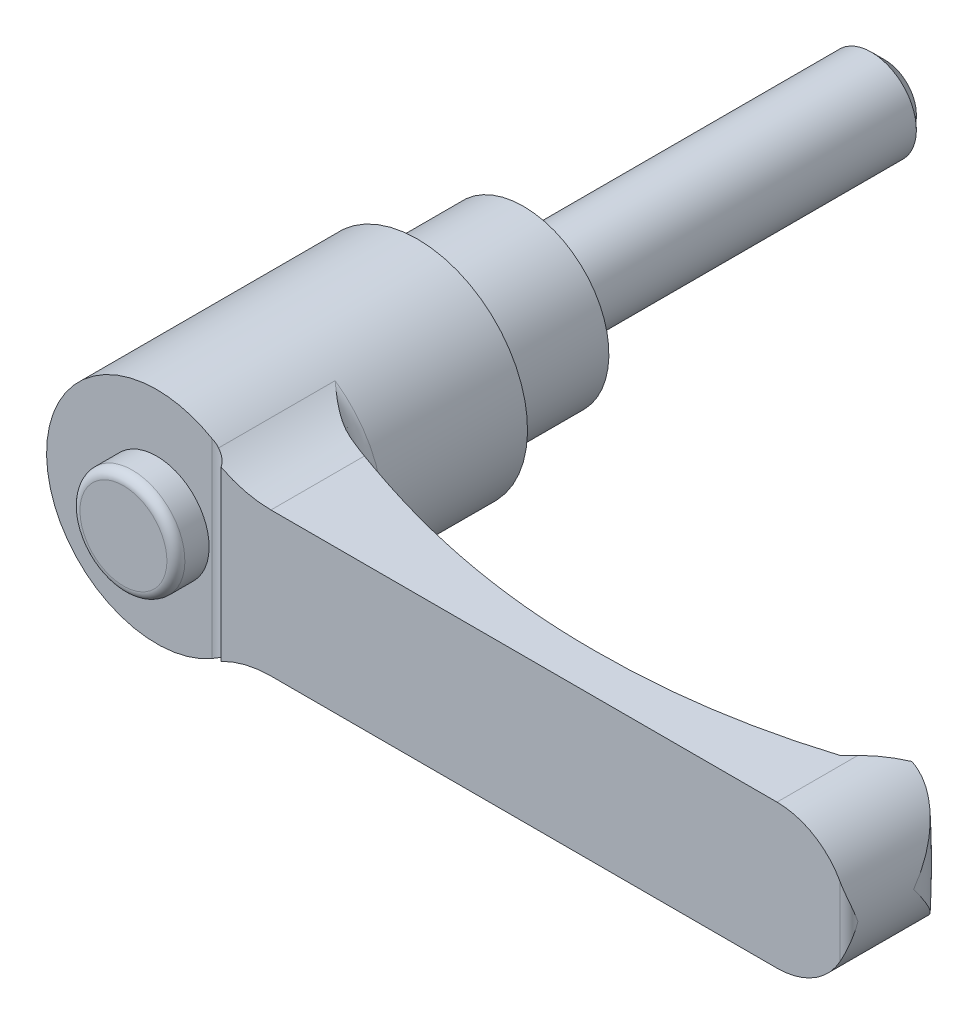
ISO-10303-21;
HEADER;
FILE_DESCRIPTION(('STEP AP214'),'2;1');
FILE_NAME('part.step','',(''),(''),'','','');
FILE_SCHEMA(('AUTOMOTIVE_DESIGN { 1 0 10303 214 1 1 1 1 }'));
ENDSEC;
DATA;
#1=APPLICATION_CONTEXT('core data for automotive mechanical design processes');
#2=APPLICATION_PROTOCOL_DEFINITION('international standard','automotive_design',2000,#1);
#3=PRODUCT_CONTEXT('',#1,'mechanical');
#4=PRODUCT('Part','Part','',(#3));
#5=PRODUCT_RELATED_PRODUCT_CATEGORY('part','',(#4));
#6=PRODUCT_DEFINITION_FORMATION('','',#4);
#7=PRODUCT_DEFINITION_CONTEXT('part definition',#1,'design');
#8=PRODUCT_DEFINITION('design','',#6,#7);
#9=PRODUCT_DEFINITION_SHAPE('','',#8);
#10=(LENGTH_UNIT() NAMED_UNIT(*) SI_UNIT(.MILLI.,.METRE.));
#11=(NAMED_UNIT(*) PLANE_ANGLE_UNIT() SI_UNIT($,.RADIAN.));
#12=(NAMED_UNIT(*) SI_UNIT($,.STERADIAN.) SOLID_ANGLE_UNIT());
#13=UNCERTAINTY_MEASURE_WITH_UNIT(LENGTH_MEASURE(1.E-05),#10,'distance_accuracy_value','');
#14=(GEOMETRIC_REPRESENTATION_CONTEXT(3) GLOBAL_UNCERTAINTY_ASSIGNED_CONTEXT((#13)) GLOBAL_UNIT_ASSIGNED_CONTEXT((#10,
#11,#12)) REPRESENTATION_CONTEXT('',''));
#15=CARTESIAN_POINT('',(0.,0.,0.));
#16=DIRECTION('',(0.,0.,1.));
#17=DIRECTION('',(1.,0.,0.));
#18=AXIS2_PLACEMENT_3D('',#15,#16,#17);
#19=CARTESIAN_POINT('',(7.6,0.,0.));
#20=DIRECTION('',(0.,0.,1.));
#21=DIRECTION('',(0.,-1.,0.));
#22=AXIS2_PLACEMENT_3D('',#19,#20,#21);
#23=PLANE('',#22);
#24=CARTESIAN_POINT('',(0.,0.,0.));
#25=DIRECTION('',(0.,0.,-1.));
#26=DIRECTION('',(0.,1.,0.));
#27=AXIS2_PLACEMENT_3D('',#24,#25,#26);
#28=CIRCLE('',#27,5.);
#29=CARTESIAN_POINT('',(0.,5.,0.));
#30=VERTEX_POINT('',#29);
#31=EDGE_CURVE('E422',#30,#30,#28,.T.);
#32=ORIENTED_EDGE('',*,*,#31,.F.);
#33=EDGE_LOOP('',(#32));
#34=FACE_BOUND('',#33,.T.);
#35=CARTESIAN_POINT('',(0.,0.,0.));
#36=DIRECTION('',(0.,0.,-1.));
#37=DIRECTION('',(0.,1.,0.));
#38=AXIS2_PLACEMENT_3D('',#35,#36,#37);
#39=CIRCLE('',#38,7.6);
#40=CARTESIAN_POINT('',(0.,7.6,0.));
#41=VERTEX_POINT('',#40);
#42=EDGE_CURVE('E347',#41,#41,#39,.T.);
#43=ORIENTED_EDGE('',*,*,#42,.T.);
#44=EDGE_LOOP('',(#43));
#45=FACE_BOUND('',#44,.T.);
#46=ADVANCED_FACE('F14',(#34,#45),#23,.F.);
#47=CARTESIAN_POINT('',(0.,0.,41.));
#48=DIRECTION('',(0.,0.,-1.));
#49=DIRECTION('',(0.,1.,0.));
#50=AXIS2_PLACEMENT_3D('',#47,#48,#49);
#51=PLANE('',#50);
#52=DIRECTION('',(0.,1.,0.));
#53=VECTOR('',#52,1.);
#54=CARTESIAN_POINT('',(6.125,-16.,41.));
#55=LINE('',#54,#53);
#56=CARTESIAN_POINT('',(6.125,-10.6088111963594,41.));
#57=VERTEX_POINT('',#56);
#58=CARTESIAN_POINT('',(6.125,10.6088111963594,41.));
#59=VERTEX_POINT('',#58);
#60=EDGE_CURVE('E385',#57,#59,#55,.T.);
#61=ORIENTED_EDGE('',*,*,#60,.T.);
#62=CARTESIAN_POINT('',(0.,0.,41.));
#63=DIRECTION('',(0.,0.,-1.));
#64=DIRECTION('',(0.,1.,0.));
#65=AXIS2_PLACEMENT_3D('',#62,#63,#64);
#66=CIRCLE('',#65,12.25);
#67=EDGE_CURVE('E332',#57,#59,#66,.T.);
#68=ORIENTED_EDGE('',*,*,#67,.F.);
#69=EDGE_LOOP('',(#61,#68));
#70=FACE_BOUND('',#69,.T.);
#71=CARTESIAN_POINT('',(0.,0.,41.));
#72=DIRECTION('',(0.,0.,-1.));
#73=DIRECTION('',(0.,1.,0.));
#74=AXIS2_PLACEMENT_3D('',#71,#72,#73);
#75=CIRCLE('',#74,5.83333333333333);
#76=CARTESIAN_POINT('',(0.,5.83333333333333,41.));
#77=VERTEX_POINT('',#76);
#78=EDGE_CURVE('E193',#77,#77,#75,.F.);
#79=ORIENTED_EDGE('',*,*,#78,.F.);
#80=EDGE_LOOP('',(#79));
#81=FACE_BOUND('',#80,.T.);
#82=ADVANCED_FACE('F163',(#70,#81),#51,.F.);
#83=CARTESIAN_POINT('',(70.,0.,0.));
#84=DIRECTION('',(0.,0.,1.));
#85=DIRECTION('',(0.,-1.,0.));
#86=AXIS2_PLACEMENT_3D('',#83,#84,#85);
#87=CYLINDRICAL_SURFACE('',#86,8.);
#88=CARTESIAN_POINT('',(78.,0.,34.8));
#89=CARTESIAN_POINT('',(78.0000000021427,-0.00507455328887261,34.7962762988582));
#90=CARTESIAN_POINT('',(77.9999951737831,-0.0101492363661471,34.7925524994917));
#91=CARTESIAN_POINT('',(77.9989416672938,-0.563628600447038,34.3864095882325));
#92=CARTESIAN_POINT('',(77.9414802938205,-1.11346566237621,33.9829298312));
#93=CARTESIAN_POINT('',(77.7692220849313,-1.92787753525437,33.38939297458));
#94=CARTESIAN_POINT('',(77.697249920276,-2.19810314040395,33.1931504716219));
#95=CARTESIAN_POINT('',(77.5237934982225,-2.73341157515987,32.8066637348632));
#96=CARTESIAN_POINT('',(77.4223242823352,-2.99849695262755,32.6164164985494));
#97=CARTESIAN_POINT('',(77.2199237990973,-3.45210642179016,32.2938177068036));
#98=CARTESIAN_POINT('',(77.1259458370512,-3.64233939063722,32.1594598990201));
#99=CARTESIAN_POINT('',(76.9211711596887,-4.01785016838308,31.8966888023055));
#100=CARTESIAN_POINT('',(76.8103745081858,-4.20312799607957,31.7682754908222));
#101=CARTESIAN_POINT('',(76.5717542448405,-4.56719869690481,31.5191542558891));
#102=CARTESIAN_POINT('',(76.4439640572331,-4.74600344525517,31.3984318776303));
#103=CARTESIAN_POINT('',(76.1708976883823,-5.09601175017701,31.1663364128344));
#104=CARTESIAN_POINT('',(76.0256268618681,-5.26721761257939,31.0549604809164));
#105=CARTESIAN_POINT('',(75.6441829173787,-5.67932922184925,30.7937387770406));
#106=CARTESIAN_POINT('',(75.3974573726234,-5.9150123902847,30.6505327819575));
#107=CARTESIAN_POINT('',(74.9987611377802,-6.24839682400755,30.4615945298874));
#108=CARTESIAN_POINT('',(74.8611020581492,-6.35616332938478,30.4029292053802));
#109=CARTESIAN_POINT('',(74.5764070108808,-6.56410843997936,30.2956150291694));
#110=CARTESIAN_POINT('',(74.429373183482,-6.66428876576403,30.2469639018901));
#111=CARTESIAN_POINT('',(74.1592544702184,-6.83522850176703,30.1705684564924));
#112=CARTESIAN_POINT('',(74.0378615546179,-6.90766708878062,30.1405781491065));
#113=CARTESIAN_POINT('',(73.7901015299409,-7.04665102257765,30.0886005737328));
#114=CARTESIAN_POINT('',(73.6637356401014,-7.11319780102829,30.0666113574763));
#115=CARTESIAN_POINT('',(73.4066843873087,-7.23982141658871,30.0315221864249));
#116=CARTESIAN_POINT('',(73.2760017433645,-7.2999022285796,30.0184167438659));
#117=CARTESIAN_POINT('',(73.0110423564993,-7.41312181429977,30.0019547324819));
#118=CARTESIAN_POINT('',(72.8767656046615,-7.46626057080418,29.9985981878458));
#119=CARTESIAN_POINT('',(72.6044130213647,-7.56559501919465,30.0024862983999));
#120=CARTESIAN_POINT('',(72.4663137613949,-7.6117232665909,30.009827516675));
#121=CARTESIAN_POINT('',(72.1887878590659,-7.69611880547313,30.0360283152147));
#122=CARTESIAN_POINT('',(72.0493611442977,-7.73438566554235,30.0548885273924));
#123=CARTESIAN_POINT('',(71.770740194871,-7.80288648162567,30.1046814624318));
#124=CARTESIAN_POINT('',(71.6315458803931,-7.83312431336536,30.1356083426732));
#125=CARTESIAN_POINT('',(71.3550409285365,-7.885663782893,30.2098119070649));
#126=CARTESIAN_POINT('',(71.217729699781,-7.90796796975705,30.2530846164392));
#127=CARTESIAN_POINT('',(70.8920238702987,-7.95241951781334,30.3719934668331));
#128=CARTESIAN_POINT('',(70.7052564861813,-7.97090772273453,30.4536477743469));
#129=CARTESIAN_POINT('',(70.433708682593,-7.98875485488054,30.5937624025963));
#130=CARTESIAN_POINT('',(70.3445710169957,-7.99305594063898,30.6434445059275));
#131=CARTESIAN_POINT('',(70.1696001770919,-7.99868029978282,30.7485120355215));
#132=CARTESIAN_POINT('',(70.0837676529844,-8.00000299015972,30.8038985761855));
#133=CARTESIAN_POINT('',(69.9998,-7.9999999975,30.8620428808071));
#134=B_SPLINE_CURVE_WITH_KNOTS('',3,(#88,#89,#90,#91,#92,#93,#94,#95,#96,#97,#98,#99,#100,#101,
#102,#103,#104,#105,#106,#107,#108,#109,#110,#111,#112,#113,#114,#115,#116,#117,#118,#119,#120,
#121,#122,#123,#124,#125,#126,#127,#128,#129,#130,#131,#132,#133),.UNSPECIFIED.,.F.,.F.,(4,2,2,
2,2,2,2,2,2,2,2,2,2,2,2,2,2,2,2,2,2,2,4),(0.,0.0188831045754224,2.05946970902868,
3.08347088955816,4.10695081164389,4.85978230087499,5.6126109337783,6.36398015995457,
7.11511980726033,8.22062566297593,8.77332293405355,9.32589447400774,9.75904172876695,
10.1920834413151,10.624857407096,11.0576324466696,11.4943381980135,11.9310679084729,
12.3675864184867,12.8039645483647,13.4155655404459,13.721767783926,14.0280299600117),.UNSPECIFIED.);
#135=CARTESIAN_POINT('',(72.9968893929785,-7.41745603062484,30.0031106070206));
#136=VERTEX_POINT('',#135);
#137=CARTESIAN_POINT('',(78.,0.,34.8));
#138=VERTEX_POINT('',#137);
#139=EDGE_CURVE('E126',#136,#138,#134,.F.);
#140=ORIENTED_EDGE('',*,*,#139,.T.);
#141=CARTESIAN_POINT('',(78.,0.,34.8));
#142=CARTESIAN_POINT('',(78.0000000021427,0.00507455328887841,34.7962762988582));
#143=CARTESIAN_POINT('',(77.9999951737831,0.0101492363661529,34.7925524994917));
#144=CARTESIAN_POINT('',(77.9989416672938,0.563628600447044,34.3864095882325));
#145=CARTESIAN_POINT('',(77.9414802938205,1.11346566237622,33.9829298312));
#146=CARTESIAN_POINT('',(77.7692220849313,1.92787753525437,33.38939297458));
#147=CARTESIAN_POINT('',(77.697249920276,2.19810314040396,33.1931504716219));
#148=CARTESIAN_POINT('',(77.5237934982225,2.73341157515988,32.8066637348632));
#149=CARTESIAN_POINT('',(77.4223242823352,2.99849695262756,32.6164164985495));
#150=CARTESIAN_POINT('',(77.2199237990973,3.45210642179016,32.2938177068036));
#151=CARTESIAN_POINT('',(77.1259458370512,3.64233939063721,32.1594598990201));
#152=CARTESIAN_POINT('',(76.9211711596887,4.01785016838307,31.8966888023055));
#153=CARTESIAN_POINT('',(76.8103745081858,4.20312799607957,31.7682754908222));
#154=CARTESIAN_POINT('',(76.5717542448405,4.56719869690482,31.5191542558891));
#155=CARTESIAN_POINT('',(76.4439640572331,4.74600344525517,31.3984318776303));
#156=CARTESIAN_POINT('',(76.1708976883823,5.09601175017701,31.1663364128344));
#157=CARTESIAN_POINT('',(76.0256268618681,5.26721761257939,31.0549604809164));
#158=CARTESIAN_POINT('',(75.6441829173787,5.67932922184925,30.7937387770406));
#159=CARTESIAN_POINT('',(75.3974573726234,5.91501239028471,30.6505327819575));
#160=CARTESIAN_POINT('',(74.9987611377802,6.24839682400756,30.4615945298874));
#161=CARTESIAN_POINT('',(74.8611020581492,6.35616332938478,30.4029292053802));
#162=CARTESIAN_POINT('',(74.5764070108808,6.56410843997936,30.2956150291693));
#163=CARTESIAN_POINT('',(74.429373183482,6.66428876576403,30.2469639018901));
#164=CARTESIAN_POINT('',(74.1592544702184,6.83522850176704,30.1705684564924));
#165=CARTESIAN_POINT('',(74.0378615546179,6.90766708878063,30.1405781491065));
#166=CARTESIAN_POINT('',(73.7901015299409,7.04665102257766,30.0886005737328));
#167=CARTESIAN_POINT('',(73.6637356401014,7.11319780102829,30.0666113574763));
#168=CARTESIAN_POINT('',(73.4066843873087,7.23982141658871,30.0315221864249));
#169=CARTESIAN_POINT('',(73.2760017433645,7.2999022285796,30.0184167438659));
#170=CARTESIAN_POINT('',(73.0110423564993,7.41312181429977,30.0019547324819));
#171=CARTESIAN_POINT('',(72.8767656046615,7.46626057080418,29.9985981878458));
#172=CARTESIAN_POINT('',(72.6044130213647,7.56559501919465,30.0024862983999));
#173=CARTESIAN_POINT('',(72.4663137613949,7.61172326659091,30.009827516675));
#174=CARTESIAN_POINT('',(72.1887878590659,7.69611880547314,30.0360283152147));
#175=CARTESIAN_POINT('',(72.0493611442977,7.73438566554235,30.0548885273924));
#176=CARTESIAN_POINT('',(71.770740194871,7.80288648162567,30.1046814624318));
#177=CARTESIAN_POINT('',(71.6315458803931,7.83312431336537,30.1356083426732));
#178=CARTESIAN_POINT('',(71.3550409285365,7.885663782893,30.2098119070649));
#179=CARTESIAN_POINT('',(71.217729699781,7.90796796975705,30.2530846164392));
#180=CARTESIAN_POINT('',(70.8920238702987,7.95241951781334,30.3719934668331));
#181=CARTESIAN_POINT('',(70.7052564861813,7.97090772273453,30.4536477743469));
#182=CARTESIAN_POINT('',(70.433708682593,7.98875485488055,30.5937624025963));
#183=CARTESIAN_POINT('',(70.3445710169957,7.99305594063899,30.6434445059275));
#184=CARTESIAN_POINT('',(70.1696001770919,7.99868029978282,30.7485120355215));
#185=CARTESIAN_POINT('',(70.0837676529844,8.00000299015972,30.8038985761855));
#186=CARTESIAN_POINT('',(69.9998,7.9999999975,30.8620428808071));
#187=B_SPLINE_CURVE_WITH_KNOTS('',3,(#141,#142,#143,#144,#145,#146,#147,#148,#149,#150,#151,
#152,#153,#154,#155,#156,#157,#158,#159,#160,#161,#162,#163,#164,#165,#166,#167,#168,#169,#170,
#171,#172,#173,#174,#175,#176,#177,#178,#179,#180,#181,#182,#183,#184,#185,#186),.UNSPECIFIED.,
.F.,.F.,(4,2,2,2,2,2,2,2,2,2,2,2,2,2,2,2,2,2,2,2,2,2,4),(0.,0.0188831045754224,2.05946970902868,
3.08347088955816,4.10695081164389,4.85978230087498,5.61261093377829,6.36398015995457,
7.11511980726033,8.22062566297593,8.77332293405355,9.32589447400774,9.75904172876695,
10.1920834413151,10.6248574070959,11.0576324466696,11.4943381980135,11.9310679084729,
12.3675864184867,12.8039645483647,13.4155655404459,13.721767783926,14.0280299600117),.UNSPECIFIED.);
#188=CARTESIAN_POINT('',(72.9968893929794,7.41745603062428,30.0031106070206));
#189=VERTEX_POINT('',#188);
#190=EDGE_CURVE('E123',#138,#189,#187,.T.);
#191=ORIENTED_EDGE('',*,*,#190,.T.);
#192=CARTESIAN_POINT('',(70.,0.,33.));
#193=DIRECTION('',(-0.707106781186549,0.,-0.707106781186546));
#194=DIRECTION('',(-0.707106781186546,0.,0.707106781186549));
#195=AXIS2_PLACEMENT_3D('',#192,#193,#194);
#196=ELLIPSE('',#195,11.3137084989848,8.);
#197=CARTESIAN_POINT('',(70.,8.,33.));
#198=VERTEX_POINT('',#197);
#199=EDGE_CURVE('E378',#189,#198,#196,.F.);
#200=ORIENTED_EDGE('',*,*,#199,.T.);
#201=DIRECTION('',(0.,0.,1.));
#202=VECTOR('',#201,1.);
#203=CARTESIAN_POINT('',(70.,8.,0.));
#204=LINE('',#203,#202);
#205=CARTESIAN_POINT('',(70.,8.,42.));
#206=VERTEX_POINT('',#205);
#207=EDGE_CURVE('E354',#198,#206,#204,.T.);
#208=ORIENTED_EDGE('',*,*,#207,.T.);
#209=CARTESIAN_POINT('',(70.,0.,42.));
#210=DIRECTION('',(0.,0.,1.));
#211=DIRECTION('',(0.,-1.,0.));
#212=AXIS2_PLACEMENT_3D('',#209,#210,#211);
#213=CIRCLE('',#212,8.);
#214=CARTESIAN_POINT('',(77.,3.87298334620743,42.));
#215=VERTEX_POINT('',#214);
#216=EDGE_CURVE('E327',#215,#206,#213,.T.);
#217=ORIENTED_EDGE('',*,*,#216,.F.);
#218=CARTESIAN_POINT('',(77.,3.87298334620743,42.));
#219=CARTESIAN_POINT('',(77.0320487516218,3.8150611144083,41.9999909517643));
#220=CARTESIAN_POINT('',(77.0633658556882,3.75675902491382,41.9984605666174));
#221=CARTESIAN_POINT('',(77.1244803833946,3.63952511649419,41.99269833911));
#222=CARTESIAN_POINT('',(77.1542784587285,3.58059358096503,41.9884676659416));
#223=CARTESIAN_POINT('',(77.241218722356,3.40324230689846,41.9722589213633));
#224=CARTESIAN_POINT('',(77.2960525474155,3.28400247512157,41.9567609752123));
#225=CARTESIAN_POINT('',(77.3991566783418,3.04456972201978,41.9185214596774));
#226=CARTESIAN_POINT('',(77.4474555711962,2.9243835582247,41.8958129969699));
#227=CARTESIAN_POINT('',(77.5378429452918,2.68282861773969,41.8446429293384));
#228=CARTESIAN_POINT('',(77.5799268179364,2.56145903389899,41.8161770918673));
#229=CARTESIAN_POINT('',(77.6827368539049,2.24038507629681,41.7351721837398));
#230=CARTESIAN_POINT('',(77.7382927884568,2.03996193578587,41.6788382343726));
#231=CARTESIAN_POINT('',(77.8332865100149,1.63779800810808,41.55814944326));
#232=CARTESIAN_POINT('',(77.8727175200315,1.43605670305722,41.4937912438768));
#233=CARTESIAN_POINT('',(77.967421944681,0.829293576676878,41.2932012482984));
#234=CARTESIAN_POINT('',(77.999127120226,0.42266785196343,41.1494356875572));
#235=CARTESIAN_POINT('',(77.9999940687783,0.0112434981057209,41.0039751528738));
#236=CARTESIAN_POINT('',(77.9999999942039,0.00562166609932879,41.0019875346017));
#237=CARTESIAN_POINT('',(78.,0.,41.));
#238=B_SPLINE_CURVE_WITH_KNOTS('',3,(#218,#219,#220,#221,#222,#223,#224,#225,#226,#227,#228,
#229,#230,#231,#232,#233,#234,#235,#236,#237),.UNSPECIFIED.,.F.,.F.,(4,2,2,2,2,2,2,2,2,4),(0.,
0.198535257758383,0.396984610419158,0.792983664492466,1.18719018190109,1.5816875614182,
2.22713013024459,2.8728436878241,4.16406208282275,4.18195063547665),.UNSPECIFIED.);
#239=CARTESIAN_POINT('',(78.,0.,41.));
#240=VERTEX_POINT('',#239);
#241=EDGE_CURVE('E179',#240,#215,#238,.F.);
#242=ORIENTED_EDGE('',*,*,#241,.F.);
#243=CARTESIAN_POINT('',(77.,-3.87298334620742,42.));
#244=CARTESIAN_POINT('',(77.0320487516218,-3.81506111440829,41.9999909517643));
#245=CARTESIAN_POINT('',(77.0633658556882,-3.75675902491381,41.9984605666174));
#246=CARTESIAN_POINT('',(77.1244803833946,-3.63952511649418,41.99269833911));
#247=CARTESIAN_POINT('',(77.1542784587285,-3.58059358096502,41.9884676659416));
#248=CARTESIAN_POINT('',(77.241218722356,-3.40324230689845,41.9722589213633));
#249=CARTESIAN_POINT('',(77.2960525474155,-3.28400247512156,41.9567609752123));
#250=CARTESIAN_POINT('',(77.3991566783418,-3.04456972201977,41.9185214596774));
#251=CARTESIAN_POINT('',(77.4474555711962,-2.92438355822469,41.8958129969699));
#252=CARTESIAN_POINT('',(77.5378429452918,-2.68282861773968,41.8446429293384));
#253=CARTESIAN_POINT('',(77.5799268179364,-2.56145903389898,41.8161770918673));
#254=CARTESIAN_POINT('',(77.6827368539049,-2.2403850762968,41.7351721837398));
#255=CARTESIAN_POINT('',(77.7382927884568,-2.03996193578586,41.6788382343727));
#256=CARTESIAN_POINT('',(77.8332865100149,-1.63779800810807,41.55814944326));
#257=CARTESIAN_POINT('',(77.8727175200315,-1.43605670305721,41.4937912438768));
#258=CARTESIAN_POINT('',(77.967421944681,-0.829293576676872,41.2932012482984));
#259=CARTESIAN_POINT('',(77.999127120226,-0.422667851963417,41.1494356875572));
#260=CARTESIAN_POINT('',(77.9999940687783,-0.0112434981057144,41.0039751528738));
#261=CARTESIAN_POINT('',(77.9999999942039,-0.00562166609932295,41.0019875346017));
#262=CARTESIAN_POINT('',(78.,0.,41.));
#263=B_SPLINE_CURVE_WITH_KNOTS('',3,(#243,#244,#245,#246,#247,#248,#249,#250,#251,#252,#253,
#254,#255,#256,#257,#258,#259,#260,#261,#262),.UNSPECIFIED.,.F.,.F.,(4,2,2,2,2,2,2,2,2,4),(0.,
0.19853525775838,0.396984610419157,0.792983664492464,1.18719018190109,1.5816875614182,
2.2271301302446,2.8728436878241,4.16406208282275,4.18195063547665),.UNSPECIFIED.);
#264=CARTESIAN_POINT('',(77.,-3.87298334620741,42.));
#265=VERTEX_POINT('',#264);
#266=EDGE_CURVE('E187',#265,#240,#263,.T.);
#267=ORIENTED_EDGE('',*,*,#266,.F.);
#268=CARTESIAN_POINT('',(70.,-8.,42.));
#269=VERTEX_POINT('',#268);
#270=EDGE_CURVE('E322',#269,#265,#213,.T.);
#271=ORIENTED_EDGE('',*,*,#270,.F.);
#272=DIRECTION('',(0.,0.,1.));
#273=VECTOR('',#272,1.);
#274=CARTESIAN_POINT('',(70.,-8.,0.));
#275=LINE('',#274,#273);
#276=CARTESIAN_POINT('',(70.,-8.,33.));
#277=VERTEX_POINT('',#276);
#278=EDGE_CURVE('E357',#277,#269,#275,.T.);
#279=ORIENTED_EDGE('',*,*,#278,.F.);
#280=EDGE_CURVE('E137',#277,#136,#196,.F.);
#281=ORIENTED_EDGE('',*,*,#280,.T.);
#282=EDGE_LOOP('',(#140,#191,#200,#208,#217,#242,#267,#271,#279,#281));
#283=FACE_BOUND('',#282,.T.);
#284=ADVANCED_FACE('F135',(#283),#87,.T.);
#285=CARTESIAN_POINT('',(73.,-16.,30.));
#286=DIRECTION('',(-0.707106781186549,0.,-0.707106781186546));
#287=DIRECTION('',(0.707106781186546,0.,-0.707106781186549));
#288=AXIS2_PLACEMENT_3D('',#285,#286,#287);
#289=PLANE('',#288);
#290=DIRECTION('',(0.,1.,0.));
#291=VECTOR('',#290,1.);
#292=CARTESIAN_POINT('',(73.,-16.,30.));
#293=LINE('',#292,#291);
#294=CARTESIAN_POINT('',(73.,-5.40740233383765,30.));
#295=VERTEX_POINT('',#294);
#296=CARTESIAN_POINT('',(73.,5.40740233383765,30.));
#297=VERTEX_POINT('',#296);
#298=EDGE_CURVE('E397',#295,#297,#293,.T.);
#299=ORIENTED_EDGE('',*,*,#298,.F.);
#300=CARTESIAN_POINT('',(72.9944134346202,8.0002,30.0055865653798));
#301=CARTESIAN_POINT('',(72.9964174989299,7.60019527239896,30.0035825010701));
#302=CARTESIAN_POINT('',(72.9977626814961,7.20018596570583,30.0022373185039));
#303=CARTESIAN_POINT('',(72.9994970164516,6.40016550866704,30.0005029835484));
#304=CARTESIAN_POINT('',(72.9998861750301,6.00015435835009,30.0001138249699));
#305=CARTESIAN_POINT('',(73.0000702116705,5.20013335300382,29.9999297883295));
#306=CARTESIAN_POINT('',(72.9998650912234,4.80012349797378,30.0001349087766));
#307=CARTESIAN_POINT('',(72.9991717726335,4.00010369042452,30.0008282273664));
#308=CARTESIAN_POINT('',(72.998683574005,3.60009373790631,30.001316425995));
#309=CARTESIAN_POINT('',(72.9972116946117,2.40006658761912,30.0027883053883));
#310=CARTESIAN_POINT('',(72.9962207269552,1.60004928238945,30.0037792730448));
#311=CARTESIAN_POINT('',(72.9954610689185,1.3601944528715E-05,30.0045389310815));
#312=CARTESIAN_POINT('',(72.9956923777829,-0.800004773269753,30.004307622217));
#313=CARTESIAN_POINT('',(72.9968584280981,-2.13336982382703,30.0031415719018));
#314=CARTESIAN_POINT('',(72.9975329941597,-2.66671710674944,30.0024670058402));
#315=CARTESIAN_POINT('',(72.9988528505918,-3.73341119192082,30.0011471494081));
#316=CARTESIAN_POINT('',(72.999498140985,-4.26675799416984,30.000501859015));
#317=CARTESIAN_POINT('',(73.000124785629,-5.33345534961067,29.999875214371));
#318=CARTESIAN_POINT('',(73.0001061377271,-5.86680590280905,29.9998938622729));
#319=CARTESIAN_POINT('',(72.9985813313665,-6.93350631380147,30.0014186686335));
#320=CARTESIAN_POINT('',(72.997075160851,-7.46685617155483,30.002924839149));
#321=CARTESIAN_POINT('',(72.9944134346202,-8.0002,30.0055865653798));
#322=B_SPLINE_CURVE_WITH_KNOTS('',3,(#300,#301,#302,#303,#304,#305,#306,#307,#308,#309,#310,
#311,#312,#313,#314,#315,#316,#317,#318,#319,#320,#321),.UNSPECIFIED.,.F.,.F.,(4,2,2,2,2,2,2,2,
2,2,4),(0.,1.20004037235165,2.40007297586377,3.60010256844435,4.80013422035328,7.20018907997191,
9.60024245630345,11.2002867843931,12.8003298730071,14.4003781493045,16.0004393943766),.UNSPECIFIED.);
#323=EDGE_CURVE('E138',#295,#136,#322,.T.);
#324=ORIENTED_EDGE('',*,*,#323,.T.);
#325=ORIENTED_EDGE('',*,*,#280,.F.);
#326=DIRECTION('',(-0.707106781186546,0.,0.707106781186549));
#327=VECTOR('',#326,1.);
#328=CARTESIAN_POINT('',(86.5,-8.,16.5));
#329=LINE('',#328,#327);
#330=CARTESIAN_POINT('',(69.,-8.,34.));
#331=VERTEX_POINT('',#330);
#332=EDGE_CURVE('E321',#277,#331,#329,.T.);
#333=ORIENTED_EDGE('',*,*,#332,.T.);
#334=DIRECTION('',(0.,1.,0.));
#335=VECTOR('',#334,1.);
#336=CARTESIAN_POINT('',(69.,-16.,34.));
#337=LINE('',#336,#335);
#338=CARTESIAN_POINT('',(69.,8.,34.));
#339=VERTEX_POINT('',#338);
#340=EDGE_CURVE('E319',#331,#339,#337,.T.);
#341=ORIENTED_EDGE('',*,*,#340,.T.);
#342=DIRECTION('',(0.707106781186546,0.,-0.707106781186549));
#343=VECTOR('',#342,1.);
#344=CARTESIAN_POINT('',(58.3567940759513,8.,44.6432059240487));
#345=LINE('',#344,#343);
#346=EDGE_CURVE('E375',#339,#198,#345,.T.);
#347=ORIENTED_EDGE('',*,*,#346,.T.);
#348=ORIENTED_EDGE('',*,*,#199,.F.);
#349=EDGE_CURVE('E129',#189,#297,#322,.T.);
#350=ORIENTED_EDGE('',*,*,#349,.T.);
#351=EDGE_LOOP('',(#299,#324,#325,#333,#341,#347,#348,#350));
#352=FACE_BOUND('',#351,.T.);
#353=ADVANCED_FACE('F162',(#352),#289,.T.);
#354=CARTESIAN_POINT('',(73.2,-16.,30.));
#355=DIRECTION('',(0.,0.,-1.));
#356=DIRECTION('',(0.,1.,0.));
#357=AXIS2_PLACEMENT_3D('',#354,#355,#356);
#358=PLANE('',#357);
#359=ORIENTED_EDGE('',*,*,#298,.T.);
#360=CARTESIAN_POINT('',(0.,0.,30.));
#361=DIRECTION('',(0.,0.,-1.));
#362=DIRECTION('',(0.,1.,0.));
#363=AXIS2_PLACEMENT_3D('',#360,#361,#362);
#364=CIRCLE('',#363,73.2);
#365=EDGE_CURVE('E36',#297,#295,#364,.T.);
#366=ORIENTED_EDGE('',*,*,#365,.T.);
#367=EDGE_LOOP('',(#359,#366));
#368=FACE_BOUND('',#367,.T.);
#369=ADVANCED_FACE('F201',(#368),#358,.T.);
#370=CARTESIAN_POINT('',(0.,0.,42.));
#371=DIRECTION('',(0.,0.,1.));
#372=DIRECTION('',(0.,-1.,0.));
#373=AXIS2_PLACEMENT_3D('',#370,#371,#372);
#374=PLANE('',#373);
#375=CARTESIAN_POINT('',(13.7135881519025,20.,42.));
#376=DIRECTION('',(0.,0.,1.));
#377=DIRECTION('',(1.,0.,0.));
#378=AXIS2_PLACEMENT_3D('',#375,#376,#377);
#379=CIRCLE('',#378,12.);
#380=CARTESIAN_POINT('',(8.16666666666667,9.35896330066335,42.));
#381=VERTEX_POINT('',#380);
#382=CARTESIAN_POINT('',(13.7135881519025,8.,42.));
#383=VERTEX_POINT('',#382);
#384=EDGE_CURVE('E372',#381,#383,#379,.T.);
#385=ORIENTED_EDGE('',*,*,#384,.F.);
#386=DIRECTION('',(0.,1.,0.));
#387=VECTOR('',#386,1.);
#388=CARTESIAN_POINT('',(8.16666666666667,-16.,42.));
#389=LINE('',#388,#387);
#390=CARTESIAN_POINT('',(8.16666666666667,-9.35896330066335,42.));
#391=VERTEX_POINT('',#390);
#392=EDGE_CURVE('E392',#391,#381,#389,.T.);
#393=ORIENTED_EDGE('',*,*,#392,.F.);
#394=CARTESIAN_POINT('',(13.7135881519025,-20.,42.));
#395=DIRECTION('',(0.,0.,1.));
#396=DIRECTION('',(1.,0.,0.));
#397=AXIS2_PLACEMENT_3D('',#394,#395,#396);
#398=CIRCLE('',#397,12.);
#399=CARTESIAN_POINT('',(13.7135881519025,-8.,42.));
#400=VERTEX_POINT('',#399);
#401=EDGE_CURVE('E363',#400,#391,#398,.T.);
#402=ORIENTED_EDGE('',*,*,#401,.F.);
#403=DIRECTION('',(-1.,0.,0.));
#404=VECTOR('',#403,1.);
#405=CARTESIAN_POINT('',(70.,-8.,42.));
#406=LINE('',#405,#404);
#407=EDGE_CURVE('E366',#269,#400,#406,.T.);
#408=ORIENTED_EDGE('',*,*,#407,.F.);
#409=ORIENTED_EDGE('',*,*,#270,.T.);
#410=DIRECTION('',(0.,1.,0.));
#411=VECTOR('',#410,1.);
#412=CARTESIAN_POINT('',(77.,-16.,42.));
#413=LINE('',#412,#411);
#414=EDGE_CURVE('E393',#265,#215,#413,.T.);
#415=ORIENTED_EDGE('',*,*,#414,.T.);
#416=ORIENTED_EDGE('',*,*,#216,.T.);
#417=DIRECTION('',(1.,0.,0.));
#418=VECTOR('',#417,1.);
#419=CARTESIAN_POINT('',(13.7135881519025,8.,42.));
#420=LINE('',#419,#418);
#421=EDGE_CURVE('E369',#383,#206,#420,.T.);
#422=ORIENTED_EDGE('',*,*,#421,.F.);
#423=EDGE_LOOP('',(#385,#393,#402,#408,#409,#415,#416,#422));
#424=FACE_BOUND('',#423,.T.);
#425=ADVANCED_FACE('F248',(#424),#374,.T.);
#426=CARTESIAN_POINT('',(0.,0.,0.));
#427=DIRECTION('',(0.,0.,-1.));
#428=DIRECTION('',(0.,1.,0.));
#429=AXIS2_PLACEMENT_3D('',#426,#427,#428);
#430=CYLINDRICAL_SURFACE('',#429,12.25);
#431=CARTESIAN_POINT('',(0.,0.,28.0779919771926));
#432=DIRECTION('',(0.,0.,-1.));
#433=DIRECTION('',(0.,1.,0.));
#434=AXIS2_PLACEMENT_3D('',#431,#432,#433);
#435=CIRCLE('',#434,12.25);
#436=CARTESIAN_POINT('',(6.92748267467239,10.1030927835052,28.0779919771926));
#437=VERTEX_POINT('',#436);
#438=CARTESIAN_POINT('',(6.92748267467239,-10.1030927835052,28.0779919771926));
#439=VERTEX_POINT('',#438);
#440=EDGE_CURVE('E412',#437,#439,#435,.T.);
#441=ORIENTED_EDGE('',*,*,#440,.T.);
#442=DIRECTION('',(0.,0.,1.));
#443=VECTOR('',#442,1.);
#444=CARTESIAN_POINT('',(6.92748267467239,-10.1030927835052,0.));
#445=LINE('',#444,#443);
#446=CARTESIAN_POINT('',(6.92748267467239,-10.1030927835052,41.0427567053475));
#447=VERTEX_POINT('',#446);
#448=EDGE_CURVE('E361',#439,#447,#445,.T.);
#449=ORIENTED_EDGE('',*,*,#448,.T.);
#450=CARTESIAN_POINT('',(6.125,-10.6088111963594,41.));
#451=CARTESIAN_POINT('',(6.19832883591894,-10.5664875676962,40.9889897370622));
#452=CARTESIAN_POINT('',(6.27164451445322,-10.523132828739,40.9821479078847));
#453=CARTESIAN_POINT('',(6.41753908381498,-10.4347921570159,40.9764986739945));
#454=CARTESIAN_POINT('',(6.49011843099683,-10.3898073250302,40.9776859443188));
#455=CARTESIAN_POINT('',(6.63402897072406,-10.2985167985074,40.9877856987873));
#456=CARTESIAN_POINT('',(6.70535828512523,-10.2522093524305,40.996708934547));
#457=CARTESIAN_POINT('',(6.84611057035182,-10.1587605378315,41.0220012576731));
#458=CARTESIAN_POINT('',(6.91553331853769,-10.1116190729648,41.0383712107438));
#459=CARTESIAN_POINT('',(7.10641045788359,-9.97916014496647,41.094233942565));
#460=CARTESIAN_POINT('',(7.22525798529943,-9.89334730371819,41.1417583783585));
#461=CARTESIAN_POINT('',(7.45241295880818,-9.72337963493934,41.2589427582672));
#462=CARTESIAN_POINT('',(7.56074253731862,-9.63922163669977,41.3285548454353));
#463=CARTESIAN_POINT('',(7.71168483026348,-9.51821587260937,41.4479066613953));
#464=CARTESIAN_POINT('',(7.75936397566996,-9.47936365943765,41.4893658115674));
#465=CARTESIAN_POINT('',(7.85125896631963,-9.40339173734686,41.5773725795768));
#466=CARTESIAN_POINT('',(7.89547657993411,-9.36627114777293,41.6239175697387));
#467=CARTESIAN_POINT('',(7.98020904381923,-9.29418452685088,41.7223463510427));
#468=CARTESIAN_POINT('',(8.02070494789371,-9.25922978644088,41.7742548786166));
#469=CARTESIAN_POINT('',(8.09722101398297,-9.19239515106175,41.8832605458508));
#470=CARTESIAN_POINT('',(8.13323329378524,-9.16052069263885,41.9403665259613));
#471=CARTESIAN_POINT('',(8.16666666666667,-9.13061090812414,42.));
#472=B_SPLINE_CURVE_WITH_KNOTS('',3,(#450,#451,#452,#453,#454,#455,#456,#457,#458,#459,#460,
#461,#462,#463,#464,#465,#466,#467,#468,#469,#470,#471),.UNSPECIFIED.,.F.,.F.,(4,2,2,2,2,2,2,2,
2,2,4),(0.,0.255975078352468,0.511780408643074,0.767941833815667,1.02413304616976,
1.48441304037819,1.94370248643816,2.16599787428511,2.38817894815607,2.61143478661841,
2.83507772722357),.UNSPECIFIED.);
#473=EDGE_CURVE('E222',#57,#447,#472,.T.);
#474=ORIENTED_EDGE('',*,*,#473,.F.);
#475=ORIENTED_EDGE('',*,*,#67,.T.);
#476=CARTESIAN_POINT('',(8.16666666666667,9.13061090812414,42.));
#477=CARTESIAN_POINT('',(8.13602850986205,9.15801692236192,41.9453523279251));
#478=CARTESIAN_POINT('',(8.10323346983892,9.18706943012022,41.8928397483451));
#479=CARTESIAN_POINT('',(8.03382107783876,9.24782874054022,41.7921703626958));
#480=CARTESIAN_POINT('',(7.99720910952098,9.27953179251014,41.7440075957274));
#481=CARTESIAN_POINT('',(7.88274220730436,9.37735907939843,41.6065497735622));
#482=CARTESIAN_POINT('',(7.79984772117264,9.44657197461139,41.5235775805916));
#483=CARTESIAN_POINT('',(7.62397737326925,9.58906879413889,41.3751924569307));
#484=CARTESIAN_POINT('',(7.53106018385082,9.66232791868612,41.3096843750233));
#485=CARTESIAN_POINT('',(7.33643153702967,9.81092784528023,41.1955319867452));
#486=CARTESIAN_POINT('',(7.23469620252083,9.88627389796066,41.1469353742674));
#487=CARTESIAN_POINT('',(7.00601089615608,10.0499435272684,41.0604339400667));
#488=CARTESIAN_POINT('',(6.87776073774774,10.1382349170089,41.0258797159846));
#489=CARTESIAN_POINT('',(6.61511692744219,10.3115145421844,40.9827504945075));
#490=CARTESIAN_POINT('',(6.48074133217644,10.3965112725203,40.9741035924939));
#491=CARTESIAN_POINT('',(6.30869788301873,10.5006996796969,40.9806991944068));
#492=CARTESIAN_POINT('',(6.27199131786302,10.5226640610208,40.9831161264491));
#493=CARTESIAN_POINT('',(6.19852568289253,10.5661055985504,40.9900077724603));
#494=CARTESIAN_POINT('',(6.16176668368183,10.5875831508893,40.9944807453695));
#495=CARTESIAN_POINT('',(6.125,10.6088111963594,41.));
#496=B_SPLINE_CURVE_WITH_KNOTS('',3,(#476,#477,#478,#479,#480,#481,#482,#483,#484,#485,#486,
#487,#488,#489,#490,#491,#492,#493,#494,#495),.UNSPECIFIED.,.F.,.F.,(4,2,2,2,2,2,2,2,2,4),(0.,
0.204930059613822,0.409574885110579,0.816210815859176,1.22058373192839,1.62608799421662,
2.10242753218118,2.57744378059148,2.7059409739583,2.83432955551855),.UNSPECIFIED.);
#497=CARTESIAN_POINT('',(6.92748267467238,10.1030927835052,41.0427567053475));
#498=VERTEX_POINT('',#497);
#499=EDGE_CURVE('E236',#498,#59,#496,.T.);
#500=ORIENTED_EDGE('',*,*,#499,.F.);
#501=DIRECTION('',(0.,0.,1.));
#502=VECTOR('',#501,1.);
#503=CARTESIAN_POINT('',(6.92748267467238,10.1030927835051,0.));
#504=LINE('',#503,#502);
#505=EDGE_CURVE('E350',#437,#498,#504,.T.);
#506=ORIENTED_EDGE('',*,*,#505,.F.);
#507=EDGE_LOOP('',(#441,#449,#474,#475,#500,#506));
#508=FACE_BOUND('',#507,.T.);
#509=CARTESIAN_POINT('',(0.,0.,12.));
#510=DIRECTION('',(0.,0.,-1.));
#511=DIRECTION('',(0.,1.,0.));
#512=AXIS2_PLACEMENT_3D('',#509,#510,#511);
#513=CIRCLE('',#512,12.25);
#514=CARTESIAN_POINT('',(0.,12.25,12.));
#515=VERTEX_POINT('',#514);
#516=EDGE_CURVE('E335',#515,#515,#513,.T.);
#517=ORIENTED_EDGE('',*,*,#516,.F.);
#518=EDGE_LOOP('',(#517));
#519=FACE_BOUND('',#518,.T.);
#520=ADVANCED_FACE('F246',(#508,#519),#430,.T.);
#521=CARTESIAN_POINT('',(13.7135881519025,20.,0.));
#522=DIRECTION('',(0.,0.,1.));
#523=DIRECTION('',(0.,-1.,0.));
#524=AXIS2_PLACEMENT_3D('',#521,#522,#523);
#525=CYLINDRICAL_SURFACE('',#524,12.);
#526=DIRECTION('',(0.,0.,1.));
#527=VECTOR('',#526,1.);
#528=CARTESIAN_POINT('',(13.7135881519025,8.,0.));
#529=LINE('',#528,#527);
#530=CARTESIAN_POINT('',(13.7135881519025,8.,31.611749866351));
#531=VERTEX_POINT('',#530);
#532=EDGE_CURVE('E352',#531,#383,#529,.T.);
#533=ORIENTED_EDGE('',*,*,#532,.F.);
#534=CARTESIAN_POINT('',(16.5591435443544,8.34226374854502,32.6591102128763));
#535=CARTESIAN_POINT('',(16.3261928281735,8.28540329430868,32.5722424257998));
#536=CARTESIAN_POINT('',(16.0917373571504,8.23557224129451,32.4848250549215));
#537=CARTESIAN_POINT('',(15.6204190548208,8.15004770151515,32.3095064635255));
#538=CARTESIAN_POINT('',(15.3835560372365,8.11435531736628,32.2216052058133));
#539=CARTESIAN_POINT('',(14.9085098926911,8.05724969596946,32.0461136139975));
#540=CARTESIAN_POINT('',(14.6703300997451,8.03580964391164,31.9585230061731));
#541=CARTESIAN_POINT('',(14.1928153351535,8.00718735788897,31.7842679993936));
#542=CARTESIAN_POINT('',(13.9534804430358,8.00000415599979,31.697603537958));
#543=CARTESIAN_POINT('',(13.3222890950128,7.99999321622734,31.4717100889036));
#544=CARTESIAN_POINT('',(12.9298365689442,8.01913869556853,31.3339527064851));
#545=CARTESIAN_POINT('',(12.1446747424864,8.09645283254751,31.0677464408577));
#546=CARTESIAN_POINT('',(11.7519664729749,8.15469870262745,30.9393165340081));
#547=CARTESIAN_POINT('',(11.0678445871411,8.29148603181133,30.7286186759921));
#548=CARTESIAN_POINT('',(10.7757440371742,8.36126529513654,30.6428547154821));
#549=CARTESIAN_POINT('',(10.1944299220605,8.52365043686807,30.4833757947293));
#550=CARTESIAN_POINT('',(9.90521727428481,8.61626334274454,30.4096645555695));
#551=CARTESIAN_POINT('',(9.33232622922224,8.82426158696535,30.2779606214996));
#552=CARTESIAN_POINT('',(9.04863462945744,8.93958259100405,30.219924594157));
#553=CARTESIAN_POINT('',(8.48843633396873,9.19295718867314,30.1227055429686));
#554=CARTESIAN_POINT('',(8.21192433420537,9.33099341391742,30.0835082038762));
#555=CARTESIAN_POINT('',(7.70530850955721,9.60902203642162,30.0304308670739));
#556=CARTESIAN_POINT('',(7.47397220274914,9.74624410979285,30.0138509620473));
#557=CARTESIAN_POINT('',(7.13386740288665,9.96379307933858,30.0017184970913));
#558=CARTESIAN_POINT('',(7.0215618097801,10.0383265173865,29.9998008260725));
#559=CARTESIAN_POINT('',(6.79949902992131,10.1911494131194,30.0002323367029));
#560=CARTESIAN_POINT('',(6.68974254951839,10.2694398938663,30.0025826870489));
#561=CARTESIAN_POINT('',(6.5813815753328,10.3495269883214,30.007070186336));
#562=B_SPLINE_CURVE_WITH_KNOTS('',3,(#534,#535,#536,#537,#538,#539,#540,#541,#542,#543,#544,
#545,#546,#547,#548,#549,#550,#551,#552,#553,#554,#555,#556,#557,#558,#559,#560,#561),
.UNSPECIFIED.,.F.,.F.,(4,2,2,2,2,2,2,2,2,2,2,2,2,4),(0.,0.765007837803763,1.53007532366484,
2.29369928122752,3.05727139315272,4.30444442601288,5.55408755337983,6.49010923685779,
7.42641935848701,8.36011402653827,9.29309806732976,10.100354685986,10.5046318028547,
10.9090196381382),.UNSPECIFIED.);
#563=CARTESIAN_POINT('',(11.361472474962,8.23277637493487,30.8190510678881));
#564=VERTEX_POINT('',#563);
#565=EDGE_CURVE('E262',#531,#564,#562,.T.);
#566=ORIENTED_EDGE('',*,*,#565,.T.);
#567=CARTESIAN_POINT('',(14.1569924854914,8.00819477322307,30.9010555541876));
#568=CARTESIAN_POINT('',(14.0595029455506,8.00457612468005,30.9322196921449));
#569=CARTESIAN_POINT('',(13.9606253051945,8.00212380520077,30.9590151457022));
#570=CARTESIAN_POINT('',(13.7610637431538,7.99968329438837,31.004218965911));
#571=CARTESIAN_POINT('',(13.6603822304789,7.99969203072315,31.0226377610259));
#572=CARTESIAN_POINT('',(13.4585847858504,8.00228706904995,31.0514218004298));
#573=CARTESIAN_POINT('',(13.3574757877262,8.00485682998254,31.061837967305));
#574=CARTESIAN_POINT('',(13.1548462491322,8.01258614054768,31.0753001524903));
#575=CARTESIAN_POINT('',(13.053325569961,8.01774665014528,31.0783434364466));
#576=CARTESIAN_POINT('',(12.8251352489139,8.0322613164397,31.0774805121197));
#577=CARTESIAN_POINT('',(12.6985166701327,8.04234092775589,31.07164895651));
#578=CARTESIAN_POINT('',(12.446446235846,8.06641586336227,31.0503579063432));
#579=CARTESIAN_POINT('',(12.3209952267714,8.08041382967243,31.0348919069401));
#580=CARTESIAN_POINT('',(11.9473264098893,8.12804907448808,30.9756133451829));
#581=CARTESIAN_POINT('',(11.7017310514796,8.16733172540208,30.9189189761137));
#582=CARTESIAN_POINT('',(11.4284283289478,8.21954129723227,30.8393902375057));
#583=CARTESIAN_POINT('',(11.3952261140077,8.22603104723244,30.829444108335));
#584=CARTESIAN_POINT('',(11.1613640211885,8.27276596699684,30.7574361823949));
#585=CARTESIAN_POINT('',(10.9642103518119,8.31751135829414,30.6865405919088));
#586=CARTESIAN_POINT('',(10.5777285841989,8.41525886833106,30.5303701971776));
#587=CARTESIAN_POINT('',(10.3884095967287,8.46827027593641,30.4450792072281));
#588=CARTESIAN_POINT('',(10.0168146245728,8.5819543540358,30.262829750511));
#589=CARTESIAN_POINT('',(9.83457244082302,8.64265900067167,30.1658226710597));
#590=CARTESIAN_POINT('',(9.47767438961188,8.77088665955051,29.9630240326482));
#591=CARTESIAN_POINT('',(9.30301613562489,8.83840750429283,29.8572352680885));
#592=CARTESIAN_POINT('',(8.93248691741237,8.99147577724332,29.6209801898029));
#593=CARTESIAN_POINT('',(8.73785326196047,9.07816138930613,29.4893172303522));
#594=CARTESIAN_POINT('',(8.35703282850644,9.25980318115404,29.2196101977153));
#595=CARTESIAN_POINT('',(8.17084790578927,9.35476116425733,29.0815647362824));
#596=CARTESIAN_POINT('',(7.80639286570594,9.55261034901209,28.801722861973));
#597=CARTESIAN_POINT('',(7.62810747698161,9.65548508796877,28.6599346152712));
#598=CARTESIAN_POINT('',(7.27822148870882,9.8694475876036,28.3744148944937));
#599=CARTESIAN_POINT('',(7.10661929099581,9.98053336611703,28.2306838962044));
#600=CARTESIAN_POINT('',(6.93448645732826,10.0982931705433,28.0839649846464));
#601=CARTESIAN_POINT('',(6.93098392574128,10.1006920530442,28.0809784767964));
#602=CARTESIAN_POINT('',(6.92748267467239,10.1030927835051,28.0779919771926));
#603=B_SPLINE_CURVE_WITH_KNOTS('',3,(#567,#568,#569,#570,#571,#572,#573,#574,#575,#576,#577,
#578,#579,#580,#581,#582,#583,#584,#585,#586,#587,#588,#589,#590,#591,#592,#593,#594,#595,#596,
#597,#598,#599,#600,#601,#602),.UNSPECIFIED.,.F.,.F.,(4,2,2,2,2,2,2,2,2,2,2,2,2,2,2,2,2,4),(0.,
0.307060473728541,0.613737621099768,0.918446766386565,1.2232689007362,1.60421628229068,
1.98542114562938,2.74764704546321,2.85344139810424,3.49502286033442,4.13733056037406,
4.78240133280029,5.42726761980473,6.17822336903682,6.9293432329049,7.67894130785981,
8.42835901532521,8.44393060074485),.UNSPECIFIED.);
#604=EDGE_CURVE('E253',#564,#437,#603,.T.);
#605=ORIENTED_EDGE('',*,*,#604,.T.);
#606=ORIENTED_EDGE('',*,*,#505,.T.);
#607=CARTESIAN_POINT('',(8.16666666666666,9.35896330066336,42.));
#608=CARTESIAN_POINT('',(8.13901649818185,9.37337657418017,41.9506476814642));
#609=CARTESIAN_POINT('',(8.10940958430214,9.3889470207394,41.9027481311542));
#610=CARTESIAN_POINT('',(8.04670483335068,9.42230209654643,41.8101553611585));
#611=CARTESIAN_POINT('',(8.01360925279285,9.44008529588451,41.7654600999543));
#612=CARTESIAN_POINT('',(7.9445192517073,9.47767235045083,41.679768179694));
#613=CARTESIAN_POINT('',(7.90854324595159,9.49746355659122,41.6387511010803));
#614=CARTESIAN_POINT('',(7.83394241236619,9.53904426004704,41.5603078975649));
#615=CARTESIAN_POINT('',(7.79531727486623,9.56083399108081,41.522882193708));
#616=CARTESIAN_POINT('',(7.67627287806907,9.628928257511,41.4163832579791));
#617=CARTESIAN_POINT('',(7.59246475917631,9.67807605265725,41.3528199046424));
#618=CARTESIAN_POINT('',(7.41892619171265,9.78297864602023,41.2409217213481));
#619=CARTESIAN_POINT('',(7.32918731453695,9.83874294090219,41.1926091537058));
#620=CARTESIAN_POINT('',(7.1868076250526,9.93000297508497,41.1289842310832));
#621=CARTESIAN_POINT('',(7.13520490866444,9.96362930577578,41.1085023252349));
#622=CARTESIAN_POINT('',(7.03159838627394,10.0323084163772,41.072203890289));
#623=CARTESIAN_POINT('',(6.97959668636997,10.0673556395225,41.0563708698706));
#624=CARTESIAN_POINT('',(6.92748267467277,10.1030927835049,41.0427567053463));
#625=B_SPLINE_CURVE_WITH_KNOTS('',3,(#607,#608,#609,#610,#611,#612,#613,#614,#615,#616,#617,
#618,#619,#620,#621,#622,#623,#624),.UNSPECIFIED.,.F.,.F.,(4,2,2,2,2,2,2,2,4),(0.,
0.17504734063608,0.349982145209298,0.52387635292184,0.697790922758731,1.04453417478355,
1.39178126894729,1.58634089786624,1.78020177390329),.UNSPECIFIED.);
#626=EDGE_CURVE('E230',#381,#498,#625,.T.);
#627=ORIENTED_EDGE('',*,*,#626,.F.);
#628=ORIENTED_EDGE('',*,*,#384,.T.);
#629=EDGE_LOOP('',(#533,#566,#605,#606,#627,#628));
#630=FACE_BOUND('',#629,.T.);
#631=ADVANCED_FACE('F242',(#630),#525,.F.);
#632=CARTESIAN_POINT('',(13.7135881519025,8.,0.));
#633=DIRECTION('',(0.,-1.,0.));
#634=DIRECTION('',(1.,0.,0.));
#635=AXIS2_PLACEMENT_3D('',#632,#633,#634);
#636=PLANE('',#635);
#637=CARTESIAN_POINT('',(45.7315011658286,8.,-40.4484852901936));
#638=DIRECTION('',(0.,-1.,0.));
#639=DIRECTION('',(1.,0.,0.));
#640=AXIS2_PLACEMENT_3D('',#637,#638,#639);
#641=CIRCLE('',#640,78.);
#642=CARTESIAN_POINT('',(45.3816329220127,8.00000000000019,37.5507300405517));
#643=VERTEX_POINT('',#642);
#644=EDGE_CURVE('E379',#643,#339,#641,.F.);
#645=ORIENTED_EDGE('',*,*,#644,.F.);
#646=CARTESIAN_POINT('',(41.2013215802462,8.,37.4608030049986));
#647=CARTESIAN_POINT('',(39.9809181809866,8.,37.4029725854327));
#648=CARTESIAN_POINT('',(38.761796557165,8.,37.3175877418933));
#649=CARTESIAN_POINT('',(36.3285638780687,8.,37.0925358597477));
#650=CARTESIAN_POINT('',(35.1144529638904,8.,36.9528673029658));
#651=CARTESIAN_POINT('',(32.6938673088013,8.,36.620494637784));
#652=CARTESIAN_POINT('',(31.4873906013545,8.,36.4278048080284));
#653=CARTESIAN_POINT('',(29.0837615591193,8.,35.9910366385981));
#654=CARTESIAN_POINT('',(27.8866092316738,8.,35.7469582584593));
#655=CARTESIAN_POINT('',(26.0963309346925,8.,35.3434938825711));
#656=CARTESIAN_POINT('',(25.4990195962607,8.,35.2023884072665));
#657=CARTESIAN_POINT('',(24.307345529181,8.,34.9082411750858));
#658=CARTESIAN_POINT('',(23.7129827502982,8.,34.7551996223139));
#659=CARTESIAN_POINT('',(22.5273511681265,8.,34.4376835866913));
#660=CARTESIAN_POINT('',(21.9360822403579,8.,34.2732095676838));
#661=CARTESIAN_POINT('',(20.7566633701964,8.,33.9334464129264));
#662=CARTESIAN_POINT('',(20.168513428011,8.,33.7581572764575));
#663=CARTESIAN_POINT('',(18.9953081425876,8.,33.3975573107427));
#664=CARTESIAN_POINT('',(18.410252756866,8.,33.2122466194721));
#665=CARTESIAN_POINT('',(17.2430689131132,8.,32.8326229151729));
#666=CARTESIAN_POINT('',(16.6609404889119,8.,32.6383097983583));
#667=CARTESIAN_POINT('',(15.4992827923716,8.,32.2420388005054));
#668=CARTESIAN_POINT('',(14.9197535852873,8.,32.0400807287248));
#669=CARTESIAN_POINT('',(13.7627551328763,8.,31.6303639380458));
#670=CARTESIAN_POINT('',(13.1852858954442,8.,31.4226051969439));
#671=CARTESIAN_POINT('',(12.2105601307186,8.,31.068884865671));
#672=CARTESIAN_POINT('',(11.8129994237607,8.,30.9237570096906));
#673=CARTESIAN_POINT('',(11.01801083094,8.,30.6331667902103));
#674=CARTESIAN_POINT('',(10.6205829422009,8.,30.4877044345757));
#675=CARTESIAN_POINT('',(9.82504247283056,8.,30.1978593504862));
#676=CARTESIAN_POINT('',(9.42692961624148,8.,30.0534773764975));
#677=CARTESIAN_POINT('',(8.62956030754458,8.,29.7678970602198));
#678=CARTESIAN_POINT('',(8.23030386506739,8.,29.6266986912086));
#679=CARTESIAN_POINT('',(7.434658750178,8.,29.3518607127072));
#680=CARTESIAN_POINT('',(7.03829494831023,8.,29.2181496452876));
#681=CARTESIAN_POINT('',(6.24250909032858,8.,28.9598804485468));
#682=CARTESIAN_POINT('',(5.84308667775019,8.,28.8353234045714));
#683=CARTESIAN_POINT('',(5.04058284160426,8.,28.6000350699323));
#684=CARTESIAN_POINT('',(4.63750557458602,8.,28.4892897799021));
#685=CARTESIAN_POINT('',(3.82651409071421,8.,28.287230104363));
#686=CARTESIAN_POINT('',(3.41860155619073,8.,28.1959091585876));
#687=CARTESIAN_POINT('',(2.77898962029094,8.,28.0738229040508));
#688=CARTESIAN_POINT('',(2.54899380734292,8.,28.0341217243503));
#689=CARTESIAN_POINT('',(2.08758367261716,8.,27.9639460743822));
#690=CARTESIAN_POINT('',(1.85616936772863,8.,27.9334714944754));
#691=CARTESIAN_POINT('',(1.39234110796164,8.,27.8827533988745));
#692=CARTESIAN_POINT('',(1.15992777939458,8.,27.8625042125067));
#693=CARTESIAN_POINT('',(0.694402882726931,8.,27.832938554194));
#694=CARTESIAN_POINT('',(0.461291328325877,8.,27.8236218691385));
#695=CARTESIAN_POINT('',(-0.00577358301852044,8.,27.81626587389));
#696=CARTESIAN_POINT('',(-0.239727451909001,8.,27.8182586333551));
#697=CARTESIAN_POINT('',(-0.707274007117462,8.,27.8335186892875));
#698=CARTESIAN_POINT('',(-0.940866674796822,8.,27.8467865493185));
#699=CARTESIAN_POINT('',(-1.40721975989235,8.,27.8841006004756));
#700=CARTESIAN_POINT('',(-1.63998003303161,8.,27.9081485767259));
#701=CARTESIAN_POINT('',(-2.10419851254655,8.,27.9661729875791));
#702=CARTESIAN_POINT('',(-2.33565694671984,8.,28.0001476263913));
#703=CARTESIAN_POINT('',(-2.97420169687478,8.,28.1064680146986));
#704=CARTESIAN_POINT('',(-3.37972262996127,8.,28.1882492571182));
#705=CARTESIAN_POINT('',(-4.18592396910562,8.,28.3731628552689));
#706=CARTESIAN_POINT('',(-4.58660185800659,8.,28.4763058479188));
#707=CARTESIAN_POINT('',(-5.38438882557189,8.,28.6981904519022));
#708=CARTESIAN_POINT('',(-5.78148949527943,8.,28.8169618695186));
#709=CARTESIAN_POINT('',(-6.57226220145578,8.,29.0650744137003));
#710=CARTESIAN_POINT('',(-6.96593476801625,8.,29.1944138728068));
#711=CARTESIAN_POINT('',(-7.75322419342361,8.,29.4607078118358));
#712=CARTESIAN_POINT('',(-8.14682745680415,8.,29.597702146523));
#713=CARTESIAN_POINT('',(-8.93259934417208,8.,29.8757469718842));
#714=CARTESIAN_POINT('',(-9.32476793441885,8.,30.0167975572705));
#715=CARTESIAN_POINT('',(-10.108000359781,8.,30.300645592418));
#716=CARTESIAN_POINT('',(-10.4990649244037,8.,30.4434410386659));
#717=CARTESIAN_POINT('',(-11.2810912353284,8.,30.7292982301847));
#718=CARTESIAN_POINT('',(-11.6720529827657,8.,30.8723599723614));
#719=CARTESIAN_POINT('',(-12.4604268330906,8.,31.1597298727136));
#720=CARTESIAN_POINT('',(-12.857844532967,8.,31.3040227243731));
#721=CARTESIAN_POINT('',(-13.6534067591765,8.,31.5905970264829));
#722=CARTESIAN_POINT('',(-14.051551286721,8.,31.7328784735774));
#723=CARTESIAN_POINT('',(-14.8489307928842,8.,32.0146765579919));
#724=CARTESIAN_POINT('',(-15.2481660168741,8.,32.1541925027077));
#725=CARTESIAN_POINT('',(-16.0478157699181,8.,32.4298018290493));
#726=CARTESIAN_POINT('',(-16.4482302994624,8.,32.5658952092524));
#727=CARTESIAN_POINT('',(-17.6492782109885,8.,32.967534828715));
#728=CARTESIAN_POINT('',(-18.4518884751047,8.,33.2272148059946));
#729=CARTESIAN_POINT('',(-20.062907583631,8.,33.7279015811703));
#730=CARTESIAN_POINT('',(-20.871316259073,8.,33.9689089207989));
#731=CARTESIAN_POINT('',(-22.2651511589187,8.,34.3651668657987));
#732=CARTESIAN_POINT('',(-22.8491532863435,8.,34.5254312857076));
#733=CARTESIAN_POINT('',(-24.0201231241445,8.,34.8347340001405));
#734=CARTESIAN_POINT('',(-24.6070908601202,8.,34.9837721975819));
#735=CARTESIAN_POINT('',(-26.3723282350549,8.,35.4133385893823));
#736=CARTESIAN_POINT('',(-27.5549313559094,8.,35.6763183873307));
#737=CARTESIAN_POINT('',(-29.9310593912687,8.,36.1528528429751));
#738=CARTESIAN_POINT('',(-31.1245924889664,8.,36.3663666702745));
#739=CARTESIAN_POINT('',(-33.5197648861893,8.,36.7417992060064));
#740=CARTESIAN_POINT('',(-34.7214041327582,8.,36.9037182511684));
#741=CARTESIAN_POINT('',(-37.1345480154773,8.,37.1750363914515));
#742=CARTESIAN_POINT('',(-38.3460719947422,8.,37.2842637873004));
#743=CARTESIAN_POINT('',(-40.7728077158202,8.,37.4484491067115));
#744=CARTESIAN_POINT('',(-41.9880194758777,8.,37.5034067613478));
#745=CARTESIAN_POINT('',(-44.4195958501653,8.,37.558389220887));
#746=CARTESIAN_POINT('',(-45.6359603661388,8.,37.5584183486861));
#747=CARTESIAN_POINT('',(-48.0674333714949,8.,37.5031457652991));
#748=CARTESIAN_POINT('',(-49.2825418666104,8.,37.4478443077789));
#749=CARTESIAN_POINT('',(-51.6852618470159,8.,37.283339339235));
#750=CARTESIAN_POINT('',(-52.8729469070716,8.,37.1752095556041));
#751=CARTESIAN_POINT('',(-55.2423682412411,8.,36.9055520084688));
#752=CARTESIAN_POINT('',(-56.4241038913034,8.,36.7440187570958));
#753=CARTESIAN_POINT('',(-58.7789436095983,8.,36.3677286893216));
#754=CARTESIAN_POINT('',(-59.9520485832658,8.,36.152977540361));
#755=CARTESIAN_POINT('',(-62.2874481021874,8.,35.670516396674));
#756=CARTESIAN_POINT('',(-63.4497415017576,8.,35.4028008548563));
#757=CARTESIAN_POINT('',(-65.7567345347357,8.,34.8159414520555));
#758=CARTESIAN_POINT('',(-66.9014830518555,8.,34.4969897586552));
#759=CARTESIAN_POINT('',(-69.1753518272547,8.,33.8075267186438));
#760=CARTESIAN_POINT('',(-70.3044720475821,8.,33.4370152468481));
#761=CARTESIAN_POINT('',(-72.544681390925,8.,32.6451401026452));
#762=CARTESIAN_POINT('',(-73.6557712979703,8.,32.2237786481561));
#763=CARTESIAN_POINT('',(-75.857653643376,8.,31.3309987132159));
#764=CARTESIAN_POINT('',(-76.9484462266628,8.,30.85958059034));
#765=CARTESIAN_POINT('',(-79.034727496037,8.,29.9010302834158));
#766=CARTESIAN_POINT('',(-80.0316867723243,8.,29.4170952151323));
#767=CARTESIAN_POINT('',(-82.0042428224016,8.,28.4072861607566));
#768=CARTESIAN_POINT('',(-82.9798378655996,8.,27.8814087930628));
#769=CARTESIAN_POINT('',(-84.9076630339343,8.,26.7887492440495));
#770=CARTESIAN_POINT('',(-85.8598964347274,8.,26.2219728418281));
#771=CARTESIAN_POINT('',(-87.7394957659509,8.,25.0483937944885));
#772=CARTESIAN_POINT('',(-88.6668593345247,8.,24.4415873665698));
#773=CARTESIAN_POINT('',(-90.4960328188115,8.,23.1883197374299));
#774=CARTESIAN_POINT('',(-91.3978106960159,8.,22.5418117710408));
#775=CARTESIAN_POINT('',(-93.1730809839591,8.,21.2108978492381));
#776=CARTESIAN_POINT('',(-94.0465706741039,8.,20.5264882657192));
#777=CARTESIAN_POINT('',(-95.7635177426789,8.,19.1210970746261));
#778=CARTESIAN_POINT('',(-96.6069776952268,8.,18.4001186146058));
#779=CARTESIAN_POINT('',(-98.2624140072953,8.,16.922839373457));
#780=CARTESIAN_POINT('',(-99.0743874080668,8.,16.1665352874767));
#781=CARTESIAN_POINT('',(-101.445256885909,8.,13.8617444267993));
#782=CARTESIAN_POINT('',(-102.956221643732,8.,12.2633517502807));
#783=CARTESIAN_POINT('',(-105.837524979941,8.,8.94488909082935));
#784=CARTESIAN_POINT('',(-107.20786508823,8.,7.22482043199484));
#785=CARTESIAN_POINT('',(-109.797743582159,8.,3.67584521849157));
#786=CARTESIAN_POINT('',(-111.017354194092,8.,1.84699141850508));
#787=CARTESIAN_POINT('',(-113.297700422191,8.,-1.90719990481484));
#788=CARTESIAN_POINT('',(-114.358435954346,8.,-3.83253747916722));
#789=CARTESIAN_POINT('',(-116.311018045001,8.,-7.76112230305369));
#790=CARTESIAN_POINT('',(-117.203273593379,8.,-9.76416627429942));
#791=CARTESIAN_POINT('',(-118.815729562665,8.,-13.8383453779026));
#792=CARTESIAN_POINT('',(-119.53593033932,8.,-15.9094803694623));
#793=CARTESIAN_POINT('',(-120.79920531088,8.,-20.1053701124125));
#794=CARTESIAN_POINT('',(-121.342256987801,8.,-22.2301316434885));
#795=CARTESIAN_POINT('',(-122.247220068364,8.,-26.5178865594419));
#796=CARTESIAN_POINT('',(-122.609131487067,8.,-28.6808799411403));
#797=CARTESIAN_POINT('',(-123.148944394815,8.,-33.0274417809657));
#798=CARTESIAN_POINT('',(-123.327035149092,8.,-35.210986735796));
#799=CARTESIAN_POINT('',(-123.498591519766,8.,-39.585316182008));
#800=CARTESIAN_POINT('',(-123.492057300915,8.,-41.7761006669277));
#801=CARTESIAN_POINT('',(-123.294410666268,8.,-46.1493274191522));
#802=CARTESIAN_POINT('',(-123.103298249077,8.,-48.3317696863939));
#803=CARTESIAN_POINT('',(-122.537860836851,8.,-52.6727901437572));
#804=CARTESIAN_POINT('',(-122.163535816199,8.,-54.8313683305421));
#805=CARTESIAN_POINT('',(-121.234422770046,8.,-59.1089663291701));
#806=CARTESIAN_POINT('',(-120.679663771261,8.,-61.227992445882));
#807=CARTESIAN_POINT('',(-119.393628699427,8.,-65.4117847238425));
#808=CARTESIAN_POINT('',(-118.662352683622,8.,-67.4765509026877));
#809=CARTESIAN_POINT('',(-117.028617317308,8.,-71.5368832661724));
#810=CARTESIAN_POINT('',(-116.126181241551,8.,-73.5324588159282));
#811=CARTESIAN_POINT('',(-114.156503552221,8.,-77.4405467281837));
#812=CARTESIAN_POINT('',(-113.089261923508,8.,-79.3530590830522));
#813=CARTESIAN_POINT('',(-110.797386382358,8.,-83.0817975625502));
#814=CARTESIAN_POINT('',(-109.572724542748,8.,-84.8980065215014));
#815=CARTESIAN_POINT('',(-106.974898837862,8.,-88.4209142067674));
#816=CARTESIAN_POINT('',(-105.601734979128,8.,-90.1276129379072));
#817=CARTESIAN_POINT('',(-102.716043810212,8.,-93.4201933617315));
#818=CARTESIAN_POINT('',(-101.203453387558,8.,-95.0060197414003));
#819=CARTESIAN_POINT('',(-98.0502415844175,8.,-98.0448134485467));
#820=CARTESIAN_POINT('',(-96.4096199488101,8.,-99.4977805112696));
#821=CARTESIAN_POINT('',(-93.0094106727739,8.,-102.262787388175));
#822=CARTESIAN_POINT('',(-91.2496439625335,8.,-103.574607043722));
#823=CARTESIAN_POINT('',(-87.6260782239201,8.,-106.045531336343));
#824=CARTESIAN_POINT('',(-85.7622793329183,8.,-107.204636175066));
#825=CARTESIAN_POINT('',(-81.9459395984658,8.,-109.360920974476));
#826=CARTESIAN_POINT('',(-79.9935099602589,8.,-110.358297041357));
#827=CARTESIAN_POINT('',(-77.0078484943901,8.,-111.728844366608));
#828=CARTESIAN_POINT('',(-76.002987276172,8.,-112.164823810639));
#829=CARTESIAN_POINT('',(-73.9759079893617,8.,-112.99429499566));
#830=CARTESIAN_POINT('',(-72.9536915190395,8.,-113.387790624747));
#831=CARTESIAN_POINT('',(-70.890916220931,8.,-114.132655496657));
#832=CARTESIAN_POINT('',(-69.850315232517,8.,-114.483907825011));
#833=CARTESIAN_POINT('',(-67.7553990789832,8.,-115.14246646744));
#834=CARTESIAN_POINT('',(-66.7010851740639,8.,-115.449776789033));
#835=CARTESIAN_POINT('',(-64.5804277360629,8.,-116.020041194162));
#836=CARTESIAN_POINT('',(-63.5140831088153,8.,-116.282991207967));
#837=CARTESIAN_POINT('',(-61.3714401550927,8.,-116.764102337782));
#838=CARTESIAN_POINT('',(-60.29514274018,8.,-116.982267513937));
#839=CARTESIAN_POINT('',(-58.1319341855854,8.,-117.374004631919));
#840=CARTESIAN_POINT('',(-57.0450044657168,8.,-117.54747395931));
#841=CARTESIAN_POINT('',(-54.8649626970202,8.,-117.848977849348));
#842=CARTESIAN_POINT('',(-53.7718512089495,8.,-117.97701646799));
#843=CARTESIAN_POINT('',(-51.58119396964,8.,-118.187619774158));
#844=CARTESIAN_POINT('',(-50.4836479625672,8.,-118.270181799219));
#845=CARTESIAN_POINT('',(-48.2861804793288,8.,-118.389867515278));
#846=CARTESIAN_POINT('',(-47.1862592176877,8.,-118.426995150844));
#847=CARTESIAN_POINT('',(-44.9763990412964,8.,-118.456132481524));
#848=CARTESIAN_POINT('',(-43.8664550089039,8.,-118.447753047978));
#849=CARTESIAN_POINT('',(-41.6479509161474,8.,-118.385316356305));
#850=CARTESIAN_POINT('',(-40.539390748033,8.,-118.331262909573));
#851=CARTESIAN_POINT('',(-38.3251645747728,8.,-118.177984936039));
#852=CARTESIAN_POINT('',(-37.2194992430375,8.,-118.078750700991));
#853=CARTESIAN_POINT('',(-35.0130734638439,8.,-117.835843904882));
#854=CARTESIAN_POINT('',(-33.9123130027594,8.,-117.692171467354));
#855=CARTESIAN_POINT('',(-31.7163075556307,8.,-117.361240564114));
#856=CARTESIAN_POINT('',(-30.6210687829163,8.,-117.173940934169));
#857=CARTESIAN_POINT('',(-28.4386526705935,8.,-116.757220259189));
#858=CARTESIAN_POINT('',(-27.351475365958,8.,-116.527799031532));
#859=CARTESIAN_POINT('',(-25.1876132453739,8.,-116.029015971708));
#860=CARTESIAN_POINT('',(-24.110917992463,8.,-115.759699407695));
#861=CARTESIAN_POINT('',(-22.5034932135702,8.,-115.327727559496));
#862=CARTESIAN_POINT('',(-21.9689549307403,8.,-115.179070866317));
#863=CARTESIAN_POINT('',(-20.9024220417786,8.,-114.872896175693));
#864=CARTESIAN_POINT('',(-20.3704274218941,8.,-114.715378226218));
#865=CARTESIAN_POINT('',(-19.082843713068,8.,-114.323156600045));
#866=CARTESIAN_POINT('',(-18.3285614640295,8.,-114.084160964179));
#867=CARTESIAN_POINT('',(-16.8248131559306,8.,-113.591440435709));
#868=CARTESIAN_POINT('',(-16.0753472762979,8.,-113.33771499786));
#869=CARTESIAN_POINT('',(-14.9527535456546,8.,-112.94801302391));
#870=CARTESIAN_POINT('',(-14.5781218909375,8.,-112.816337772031));
#871=CARTESIAN_POINT('',(-13.8296867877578,8.,-112.55065306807));
#872=CARTESIAN_POINT('',(-13.4558833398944,8.,-112.416643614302));
#873=CARTESIAN_POINT('',(-12.7089638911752,8.,-112.14699816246));
#874=CARTESIAN_POINT('',(-12.335847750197,8.,-112.011362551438));
#875=CARTESIAN_POINT('',(-11.5899077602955,8.,-111.739292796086));
#876=CARTESIAN_POINT('',(-11.2170839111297,8.,-111.60285865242));
#877=CARTESIAN_POINT('',(-10.479422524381,8.,-111.333246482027));
#878=CARTESIAN_POINT('',(-10.1145873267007,8.,-111.200062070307));
#879=CARTESIAN_POINT('',(-9.3843276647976,8.,-110.93529913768));
#880=CARTESIAN_POINT('',(-9.01890319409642,8.,-110.803720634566));
#881=CARTESIAN_POINT('',(-8.28647129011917,8.,-110.543745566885));
#882=CARTESIAN_POINT('',(-7.91946256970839,8.,-110.415352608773));
#883=CARTESIAN_POINT('',(-7.18353265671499,8.,-110.164145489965));
#884=CARTESIAN_POINT('',(-6.81461149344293,8.,-110.041331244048));
#885=CARTESIAN_POINT('',(-6.07673532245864,8.,-109.805079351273));
#886=CARTESIAN_POINT('',(-5.7078004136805,8.,-109.691579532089));
#887=CARTESIAN_POINT('',(-4.96633657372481,8.,-109.476629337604));
#888=CARTESIAN_POINT('',(-4.5938071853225,8.,-109.375180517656));
#889=CARTESIAN_POINT('',(-3.84531639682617,8.,-109.189083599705));
#890=CARTESIAN_POINT('',(-3.46936355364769,8.,-109.104401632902));
#891=CARTESIAN_POINT('',(-2.71327053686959,8.,-108.956783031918));
#892=CARTESIAN_POINT('',(-2.3331324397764,8.,-108.893836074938));
#893=CARTESIAN_POINT('',(-1.69248874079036,8.,-108.810602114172));
#894=CARTESIAN_POINT('',(-1.43291810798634,8.,-108.783104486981));
#895=CARTESIAN_POINT('',(-0.912633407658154,8.,-108.741521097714));
#896=CARTESIAN_POINT('',(-0.651919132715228,8.,-108.727437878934));
#897=CARTESIAN_POINT('',(-0.130028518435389,8.,-108.713360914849));
#898=CARTESIAN_POINT('',(0.131147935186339,8.,-108.713371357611));
#899=CARTESIAN_POINT('',(0.653102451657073,8.,-108.727489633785));
#900=CARTESIAN_POINT('',(0.913880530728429,8.,-108.741596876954));
#901=CARTESIAN_POINT('',(1.43451233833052,8.,-108.7832559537));
#902=CARTESIAN_POINT('',(1.69436538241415,8.,-108.810816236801));
#903=CARTESIAN_POINT('',(2.21245838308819,8.,-108.878187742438));
#904=CARTESIAN_POINT('',(2.47069827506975,8.,-108.91799945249));
#905=CARTESIAN_POINT('',(3.24290181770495,8.,-109.053603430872));
#906=CARTESIAN_POINT('',(3.75405102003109,8.,-109.165537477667));
#907=CARTESIAN_POINT('',(4.50831767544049,8.,-109.354397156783));
#908=CARTESIAN_POINT('',(4.75449112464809,8.,-109.419847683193));
#909=CARTESIAN_POINT('',(5.24522594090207,8.,-109.556586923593));
#910=CARTESIAN_POINT('',(5.48978731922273,8.,-109.627875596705));
#911=CARTESIAN_POINT('',(5.97738356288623,8.,-109.775075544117));
#912=CARTESIAN_POINT('',(6.22041904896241,8.,-109.850984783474));
#913=CARTESIAN_POINT('',(6.70532362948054,8.,-110.006446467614));
#914=CARTESIAN_POINT('',(6.94719270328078,8.,-110.085998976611));
#915=CARTESIAN_POINT('',(7.43069602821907,8.,-110.248123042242));
#916=CARTESIAN_POINT('',(7.67232754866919,8.,-110.330702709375));
#917=CARTESIAN_POINT('',(8.15486960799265,8.,-110.497933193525));
#918=CARTESIAN_POINT('',(8.39578015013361,8.,-110.582584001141));
#919=CARTESIAN_POINT('',(8.87712037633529,8.,-110.753358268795));
#920=CARTESIAN_POINT('',(9.11754997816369,8.,-110.839481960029));
#921=CARTESIAN_POINT('',(9.59806807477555,8.,-111.012679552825));
#922=CARTESIAN_POINT('',(9.83815656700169,8.,-111.099753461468));
#923=CARTESIAN_POINT('',(10.5593952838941,8.,-111.362187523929));
#924=CARTESIAN_POINT('',(11.0402671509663,8.,-111.538310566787));
#925=CARTESIAN_POINT('',(12.0022665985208,8.,-111.889861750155));
#926=CARTESIAN_POINT('',(12.4833941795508,8.,-112.065289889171));
#927=CARTESIAN_POINT('',(13.4465990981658,8.,-112.413507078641));
#928=CARTESIAN_POINT('',(13.928676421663,8.,-112.586296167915));
#929=CARTESIAN_POINT('',(14.89427793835,8.,-112.927791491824));
#930=CARTESIAN_POINT('',(15.3778021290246,8.,-113.096497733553));
#931=CARTESIAN_POINT('',(16.3464764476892,8.,-113.428685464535));
#932=CARTESIAN_POINT('',(16.8316260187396,8.,-113.592168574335));
#933=CARTESIAN_POINT('',(17.8039116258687,8.,-113.91312515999));
#934=CARTESIAN_POINT('',(18.2910476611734,8.,-114.070598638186));
#935=CARTESIAN_POINT('',(19.2674414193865,8.,-114.378879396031));
#936=CARTESIAN_POINT('',(19.7566991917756,8.,-114.529686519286));
#937=CARTESIAN_POINT('',(20.7373751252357,8.,-114.82410664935));
#938=CARTESIAN_POINT('',(21.2287933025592,8.,-114.967719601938));
#939=CARTESIAN_POINT('',(22.7037837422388,8.,-115.386389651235));
#940=CARTESIAN_POINT('',(23.6906178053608,8.,-115.650080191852));
#941=CARTESIAN_POINT('',(25.6725098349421,8.,-116.144501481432));
#942=CARTESIAN_POINT('',(26.6675677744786,8.,-116.37523233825));
#943=CARTESIAN_POINT('',(28.6655686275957,8.,-116.802054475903));
#944=CARTESIAN_POINT('',(29.6685148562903,8.,-116.998130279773));
#945=CARTESIAN_POINT('',(31.6807921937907,8.,-117.354196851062));
#946=CARTESIAN_POINT('',(32.6901232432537,8.,-117.514187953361));
#947=CARTESIAN_POINT('',(34.7240591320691,8.,-117.798519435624));
#948=CARTESIAN_POINT('',(35.7487159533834,8.,-117.922488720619));
#949=CARTESIAN_POINT('',(37.8019678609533,8.,-118.131868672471));
#950=CARTESIAN_POINT('',(38.830562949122,8.,-118.217279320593));
#951=CARTESIAN_POINT('',(40.8900801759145,8.,-118.348970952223));
#952=CARTESIAN_POINT('',(41.9210018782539,8.,-118.39525874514));
#953=CARTESIAN_POINT('',(43.9839387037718,8.,-118.448329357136));
#954=CARTESIAN_POINT('',(45.0159538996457,8.,-118.455109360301));
#955=CARTESIAN_POINT('',(47.0819889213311,8.,-118.428854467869));
#956=CARTESIAN_POINT('',(48.1160075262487,8.,-118.395722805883));
#957=CARTESIAN_POINT('',(50.1820560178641,8.,-118.289321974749));
#958=CARTESIAN_POINT('',(51.2140857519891,8.,-118.216049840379));
#959=CARTESIAN_POINT('',(53.2745889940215,8.,-118.029304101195));
#960=CARTESIAN_POINT('',(54.3030622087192,8.,-117.915827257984));
#961=CARTESIAN_POINT('',(56.3547866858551,8.,-117.648713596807));
#962=CARTESIAN_POINT('',(57.3780378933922,8.,-117.495076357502));
#963=CARTESIAN_POINT('',(59.5167730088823,8.,-117.130902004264));
#964=CARTESIAN_POINT('',(60.6315652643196,8.,-116.916288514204));
#965=CARTESIAN_POINT('',(62.8508702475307,8.,-116.439151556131));
#966=CARTESIAN_POINT('',(63.9553827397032,8.,-116.176626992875));
#967=CARTESIAN_POINT('',(66.1520234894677,8.,-115.604066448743));
#968=CARTESIAN_POINT('',(67.2441517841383,8.,-115.294030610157));
#969=CARTESIAN_POINT('',(69.4140568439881,8.,-114.626919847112));
#970=CARTESIAN_POINT('',(70.4918322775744,8.,-114.269840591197));
#971=CARTESIAN_POINT('',(72.630172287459,8.,-113.509524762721));
#972=CARTESIAN_POINT('',(73.690747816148,8.,-113.106318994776));
#973=CARTESIAN_POINT('',(75.7935088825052,8.,-112.254222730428));
#974=CARTESIAN_POINT('',(76.8356925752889,8.,-111.805327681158));
#975=CARTESIAN_POINT('',(78.8994462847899,8.,-110.862747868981));
#976=CARTESIAN_POINT('',(79.9210189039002,8.,-110.369068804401));
#977=CARTESIAN_POINT('',(81.9418308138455,8.,-109.337722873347));
#978=CARTESIAN_POINT('',(82.9410679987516,8.,-108.800051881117));
#979=CARTESIAN_POINT('',(84.8889399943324,8.,-107.696620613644));
#980=CARTESIAN_POINT('',(85.8382137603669,8.,-107.131988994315));
#981=CARTESIAN_POINT('',(87.7120125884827,8.,-105.963004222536));
#982=CARTESIAN_POINT('',(88.6365353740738,8.,-105.358647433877));
#983=CARTESIAN_POINT('',(91.3702257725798,8.,-103.48766923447));
#984=CARTESIAN_POINT('',(93.1400680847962,8.,-102.162826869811));
#985=CARTESIAN_POINT('',(96.5609798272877,8.,-99.3678713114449));
#986=CARTESIAN_POINT('',(98.2120365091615,8.,-97.8977425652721));
#987=CARTESIAN_POINT('',(101.383515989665,8.,-94.8226316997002));
#988=CARTESIAN_POINT('',(102.903938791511,8.,-93.2176495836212));
#989=CARTESIAN_POINT('',(105.793833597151,8.,-89.8949654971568));
#990=CARTESIAN_POINT('',(107.164199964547,8.,-88.178041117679));
#991=CARTESIAN_POINT('',(109.755139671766,8.,-84.6346636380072));
#992=CARTESIAN_POINT('',(110.975713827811,8.,-82.8082111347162));
#993=CARTESIAN_POINT('',(113.258239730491,8.,-79.0588898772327));
#994=CARTESIAN_POINT('',(114.3202006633,8.,-77.13602671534));
#995=CARTESIAN_POINT('',(116.277963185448,8.,-73.2074926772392));
#996=CARTESIAN_POINT('',(117.17376479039,8.,-71.2018218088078));
#997=CARTESIAN_POINT('',(118.79113586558,8.,-67.1261200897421));
#998=CARTESIAN_POINT('',(119.513054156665,8.,-65.0562276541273));
#999=CARTESIAN_POINT('',(120.779831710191,8.,-60.8629554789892));
#1000=CARTESIAN_POINT('',(121.324691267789,8.,-58.7395758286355));
#1001=CARTESIAN_POINT('',(122.233458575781,8.,-54.4544205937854));
#1002=CARTESIAN_POINT('',(122.5973646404,8.,-52.2926446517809));
#1003=CARTESIAN_POINT('',(123.141613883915,8.,-47.9461074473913));
#1004=CARTESIAN_POINT('',(123.321957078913,8.,-45.7613461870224));
#1005=CARTESIAN_POINT('',(123.497724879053,8.,-41.3860293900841));
#1006=CARTESIAN_POINT('',(123.493287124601,8.,-39.1954793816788));
#1007=CARTESIAN_POINT('',(123.299865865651,8.,-34.8225431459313));
#1008=CARTESIAN_POINT('',(123.110882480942,8.,-32.6401569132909));
#1009=CARTESIAN_POINT('',(122.549721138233,8.,-28.2990732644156));
#1010=CARTESIAN_POINT('',(122.177543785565,8.,-26.1403757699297));
#1011=CARTESIAN_POINT('',(121.25265353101,8.,-21.8620087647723));
#1012=CARTESIAN_POINT('',(120.699940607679,8.,-19.7423392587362));
#1013=CARTESIAN_POINT('',(119.417982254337,8.,-15.5572714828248));
#1014=CARTESIAN_POINT('',(118.688751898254,8.,-13.4918685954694));
#1015=CARTESIAN_POINT('',(117.058941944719,8.,-9.42981438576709));
#1016=CARTESIAN_POINT('',(116.158362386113,8.,-7.43316304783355));
#1017=CARTESIAN_POINT('',(114.192287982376,8.,-3.5227877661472));
#1018=CARTESIAN_POINT('',(113.126793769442,8.,-1.60906350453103));
#1019=CARTESIAN_POINT('',(110.83849357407,8.,2.1219004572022));
#1020=CARTESIAN_POINT('',(109.615687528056,8.,3.9391401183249));
#1021=CARTESIAN_POINT('',(107.020842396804,8.,7.46515196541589));
#1022=CARTESIAN_POINT('',(105.648729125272,8.,9.17386955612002));
#1023=CARTESIAN_POINT('',(102.765567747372,8.,12.4697651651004));
#1024=CARTESIAN_POINT('',(101.254519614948,8.,14.0569431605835));
#1025=CARTESIAN_POINT('',(98.1042751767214,8.,17.0985678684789));
#1026=CARTESIAN_POINT('',(96.4650789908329,8.,18.5530147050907));
#1027=CARTESIAN_POINT('',(93.0702310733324,8.,21.3189662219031));
#1028=CARTESIAN_POINT('',(91.3145793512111,8.,22.6304709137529));
#1029=CARTESIAN_POINT('',(87.6967200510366,8.,25.1031717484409));
#1030=CARTESIAN_POINT('',(85.8343624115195,8.,26.264148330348));
#1031=CARTESIAN_POINT('',(82.018689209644,8.,28.4255291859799));
#1032=CARTESIAN_POINT('',(80.0653731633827,8.,29.4259326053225));
#1033=CARTESIAN_POINT('',(76.0815840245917,8.,31.2593919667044));
#1034=CARTESIAN_POINT('',(74.0511065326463,8.,32.0924383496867));
#1035=CARTESIAN_POINT('',(69.927622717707,8.,33.585569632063));
#1036=CARTESIAN_POINT('',(67.8346177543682,8.,34.2456582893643));
#1037=CARTESIAN_POINT('',(63.7242907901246,8.,35.3554073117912));
#1038=CARTESIAN_POINT('',(61.7096853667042,8.,35.8151039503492));
#1039=CARTESIAN_POINT('',(58.6659520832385,8.,36.3851809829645));
#1040=CARTESIAN_POINT('',(57.6476753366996,8.,36.5553019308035));
#1041=CARTESIAN_POINT('',(55.6052722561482,8.,36.8556088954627));
#1042=CARTESIAN_POINT('',(54.5811463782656,8.,36.9857979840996));
#1043=CARTESIAN_POINT('',(52.5299047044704,8.,37.2060222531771));
#1044=CARTESIAN_POINT('',(51.5027942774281,8.,37.296107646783));
#1045=CARTESIAN_POINT('',(49.445931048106,8.,37.4363764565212));
#1046=CARTESIAN_POINT('',(48.4161784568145,8.,37.4865629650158));
#1047=CARTESIAN_POINT('',(46.3552052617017,8.,37.5471627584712));
#1048=CARTESIAN_POINT('',(45.3239843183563,8.,37.5575644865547));
#1049=CARTESIAN_POINT('',(43.2619785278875,8.,37.5387843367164));
#1050=CARTESIAN_POINT('',(42.2311936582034,8.,37.5096048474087));
#1051=CARTESIAN_POINT('',(41.2013215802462,8.,37.4608030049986));
#1052=B_SPLINE_CURVE_WITH_KNOTS('',3,(#646,#647,#648,#649,#650,#651,#652,#653,#654,#655,#656,
#657,#658,#659,#660,#661,#662,#663,#664,#665,#666,#667,#668,#669,#670,#671,#672,#673,#674,#675,
#676,#677,#678,#679,#680,#681,#682,#683,#684,#685,#686,#687,#688,#689,#690,#691,#692,#693,#694,
#695,#696,#697,#698,#699,#700,#701,#702,#703,#704,#705,#706,#707,#708,#709,#710,#711,#712,#713,
#714,#715,#716,#717,#718,#719,#720,#721,#722,#723,#724,#725,#726,#727,#728,#729,#730,#731,#732,
#733,#734,#735,#736,#737,#738,#739,#740,#741,#742,#743,#744,#745,#746,#747,#748,#749,#750,#751,
#752,#753,#754,#755,#756,#757,#758,#759,#760,#761,#762,#763,#764,#765,#766,#767,#768,#769,#770,
#771,#772,#773,#774,#775,#776,#777,#778,#779,#780,#781,#782,#783,#784,#785,#786,#787,#788,#789,
#790,#791,#792,#793,#794,#795,#796,#797,#798,#799,#800,#801,#802,#803,#804,#805,#806,#807,#808,
#809,#810,#811,#812,#813,#814,#815,#816,#817,#818,#819,#820,#821,#822,#823,#824,#825,#826,#827,
#828,#829,#830,#831,#832,#833,#834,#835,#836,#837,#838,#839,#840,#841,#842,#843,#844,#845,#846,
#847,#848,#849,#850,#851,#852,#853,#854,#855,#856,#857,#858,#859,#860,#861,#862,#863,#864,#865,
#866,#867,#868,#869,#870,#871,#872,#873,#874,#875,#876,#877,#878,#879,#880,#881,#882,#883,#884,
#885,#886,#887,#888,#889,#890,#891,#892,#893,#894,#895,#896,#897,#898,#899,#900,#901,#902,#903,
#904,#905,#906,#907,#908,#909,#910,#911,#912,#913,#914,#915,#916,#917,#918,#919,#920,#921,#922,
#923,#924,#925,#926,#927,#928,#929,#930,#931,#932,#933,#934,#935,#936,#937,#938,#939,#940,#941,
#942,#943,#944,#945,#946,#947,#948,#949,#950,#951,#952,#953,#954,#955,#956,#957,#958,#959,#960,
#961,#962,#963,#964,#965,#966,#967,#968,#969,#970,#971,#972,#973,#974,#975,#976,#977,#978,#979,
#980,#981,#982,#983,#984,#985,#986,#987,#988,#989,#990,#991,#992,#993,#994,#995,#996,#997,#998,
#999,#1000,#1001,#1002,#1003,#1004,#1005,#1006,#1007,#1008,#1009,#1010,#1011,#1012,#1013,#1014,
#1015,#1016,#1017,#1018,#1019,#1020,#1021,#1022,#1023,#1024,#1025,#1026,#1027,#1028,#1029,#1030,
#1031,#1032,#1033,#1034,#1035,#1036,#1037,#1038,#1039,#1040,#1041,#1042,#1043,#1044,#1045,#1046,
#1047,#1048,#1049,#1050,#1051),.UNSPECIFIED.,.T.,.F.,(4,2,2,2,2,2,2,2,2,2,2,2,2,2,2,2,2,2,2,2,2,
2,2,2,2,2,2,2,2,2,2,2,2,2,2,2,2,2,2,2,2,2,2,2,2,2,2,2,2,2,2,2,2,2,2,2,2,2,2,2,2,2,2,2,2,2,2,2,2,
2,2,2,2,2,2,2,2,2,2,2,2,2,2,2,2,2,2,2,2,2,2,2,2,2,2,2,2,2,2,2,2,2,2,2,2,2,2,2,2,2,2,2,2,2,2,2,2,
2,2,2,2,2,2,2,2,2,2,2,2,2,2,2,2,2,2,2,2,2,2,2,2,2,2,2,2,2,2,2,2,2,2,2,2,2,2,2,2,2,2,2,2,2,2,2,2,
2,2,2,2,2,2,2,2,2,2,2,2,2,2,2,2,2,2,2,2,2,2,2,2,2,2,2,2,2,2,2,2,2,2,2,2,2,4),(0.,
3.66505770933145,7.33021792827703,10.9943920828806,14.6585691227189,16.4997240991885,
18.3408475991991,20.1818964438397,22.0229454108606,23.8639690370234,25.7050138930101,
27.5461047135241,29.3872025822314,30.6568675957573,31.9265030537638,33.1969550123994,
34.4673963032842,35.7222586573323,36.9772695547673,38.2309978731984,39.4843020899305,
40.1843375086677,40.884364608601,41.584003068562,42.2836278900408,42.9852375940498,
43.6868823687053,44.3886433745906,45.0902775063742,46.3304851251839,47.5713117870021,
48.8145401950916,50.05757282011,51.3078228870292,52.5581021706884,53.8070602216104,
55.0560038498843,56.3244057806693,57.5928098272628,58.8615276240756,60.1302459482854,
62.6607644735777,65.1912095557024,67.0078817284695,68.8245696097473,72.4579475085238,
76.0943138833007,79.7306565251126,83.3787697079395,87.0269009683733,90.6747451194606,
94.3225725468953,97.8991626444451,101.476120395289,105.052697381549,108.629649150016,
112.193485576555,115.757330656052,119.321020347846,122.884684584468,126.208317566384,
129.532218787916,132.855651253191,136.17939823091,139.507138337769,142.835197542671,
146.162970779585,149.491055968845,156.081044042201,162.67096041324,169.257706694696,
175.844456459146,182.415005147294,188.985540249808,195.556910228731,202.128279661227,
208.692876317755,215.257467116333,221.822057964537,228.386649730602,234.95018596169,
241.5137200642,248.076362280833,254.639005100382,261.202813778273,267.766622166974,
274.333416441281,280.900223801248,287.477129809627,294.054027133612,300.622888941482,
303.908196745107,307.1932036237,310.487102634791,313.780701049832,317.074601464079,
320.368203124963,323.669300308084,326.970102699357,330.271098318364,333.571807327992,
336.900784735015,340.229484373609,343.558899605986,346.888305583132,350.220865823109,
353.553440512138,356.8822623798,358.546671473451,360.211071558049,362.58460627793,
364.958228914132,366.149518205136,367.340808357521,368.531820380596,369.72283141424,
370.887985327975,372.053152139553,373.21958287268,374.385995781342,375.543852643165,
376.701858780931,377.857501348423,379.012594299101,379.795356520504,380.578267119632,
381.361410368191,382.144520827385,382.928123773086,383.711757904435,385.279921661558,
386.044072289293,386.808217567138,387.572028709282,388.335853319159,389.101900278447,
389.86794376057,390.634108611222,391.400279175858,392.936609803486,394.472943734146,
396.009255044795,397.545563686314,399.081390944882,400.617217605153,402.153080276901,
403.688954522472,406.752755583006,409.816546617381,412.88170250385,415.946829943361,
419.042497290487,422.138166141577,425.233296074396,428.328646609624,431.431516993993,
434.534616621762,437.637966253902,440.741348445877,444.146063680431,447.550856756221,
450.95563963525,454.360736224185,457.763571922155,461.166747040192,464.569489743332,
467.972551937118,471.285029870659,474.597811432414,481.22147509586,487.845848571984,
494.470221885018,501.052674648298,507.635091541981,514.21712706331,520.799161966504,
527.367880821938,533.93658872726,540.505357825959,547.07412634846,553.638001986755,
560.201873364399,566.765723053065,573.329573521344,579.892863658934,586.456152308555,
593.019415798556,599.582681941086,606.149224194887,612.715767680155,619.282305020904,
625.848841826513,632.424851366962,639.00089589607,645.577315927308,652.153593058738,
658.34588795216,661.442405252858,664.538684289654,667.631075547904,670.723227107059,
673.816276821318,676.909139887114),.UNSPECIFIED.);
#1053=EDGE_CURVE('E271',#643,#531,#1052,.T.);
#1054=ORIENTED_EDGE('',*,*,#1053,.T.);
#1055=ORIENTED_EDGE('',*,*,#532,.T.);
#1056=ORIENTED_EDGE('',*,*,#421,.T.);
#1057=ORIENTED_EDGE('',*,*,#207,.F.);
#1058=ORIENTED_EDGE('',*,*,#346,.F.);
#1059=EDGE_LOOP('',(#645,#1054,#1055,#1056,#1057,#1058));
#1060=FACE_BOUND('',#1059,.T.);
#1061=ADVANCED_FACE('F167',(#1060),#636,.F.);
#1062=CARTESIAN_POINT('',(70.,-8.,0.));
#1063=DIRECTION('',(0.,1.,0.));
#1064=DIRECTION('',(-1.,0.,0.));
#1065=AXIS2_PLACEMENT_3D('',#1062,#1063,#1064);
#1066=PLANE('',#1065);
#1067=DIRECTION('',(0.,0.,1.));
#1068=VECTOR('',#1067,1.);
#1069=CARTESIAN_POINT('',(13.7135881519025,-8.,0.));
#1070=LINE('',#1069,#1068);
#1071=CARTESIAN_POINT('',(13.7135881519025,-8.,31.611749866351));
#1072=VERTEX_POINT('',#1071);
#1073=EDGE_CURVE('E359',#1072,#400,#1070,.T.);
#1074=ORIENTED_EDGE('',*,*,#1073,.F.);
#1075=CARTESIAN_POINT('',(41.2013215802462,-8.,37.4608030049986));
#1076=CARTESIAN_POINT('',(42.3214581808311,-8.,37.5138799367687));
#1077=CARTESIAN_POINT('',(43.4427238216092,-8.,37.5437481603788));
#1078=CARTESIAN_POINT('',(45.6855653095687,-8.,37.5566272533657));
#1079=CARTESIAN_POINT('',(46.8071411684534,-8.,37.5396360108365));
#1080=CARTESIAN_POINT('',(49.0488564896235,-8.,37.4585223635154));
#1081=CARTESIAN_POINT('',(50.1689955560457,-8.,37.3943889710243));
#1082=CARTESIAN_POINT('',(52.4058261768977,-8.,37.2188440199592));
#1083=CARTESIAN_POINT('',(53.5225168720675,-8.,37.107421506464));
#1084=CARTESIAN_POINT('',(55.7481692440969,-8.,36.8375597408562));
#1085=CARTESIAN_POINT('',(56.8571412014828,-8.,36.6792053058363));
#1086=CARTESIAN_POINT('',(59.067490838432,-8.,36.315527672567));
#1087=CARTESIAN_POINT('',(60.1688676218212,-8.,36.1101990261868));
#1088=CARTESIAN_POINT('',(62.3618803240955,-8.,35.6528399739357));
#1089=CARTESIAN_POINT('',(63.4535162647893,-8.,35.4008096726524));
#1090=CARTESIAN_POINT('',(65.6249165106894,-8.,34.8504436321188));
#1091=CARTESIAN_POINT('',(66.7046822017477,-8.,34.5521133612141));
#1092=CARTESIAN_POINT('',(68.8488199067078,-8.,33.9100908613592));
#1093=CARTESIAN_POINT('',(69.9132131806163,-8.,33.5664696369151));
#1094=CARTESIAN_POINT('',(72.0260775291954,-8.,32.8341672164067));
#1095=CARTESIAN_POINT('',(73.0745526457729,-8.,32.4454976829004));
#1096=CARTESIAN_POINT('',(75.1540513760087,-8.,31.6236356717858));
#1097=CARTESIAN_POINT('',(76.1850728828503,-8.,31.1904378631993));
#1098=CARTESIAN_POINT('',(78.2276977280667,-8.,30.2802767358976));
#1099=CARTESIAN_POINT('',(79.2392997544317,-8.,29.8033104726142));
#1100=CARTESIAN_POINT('',(81.2419946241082,-8.,28.8060503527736));
#1101=CARTESIAN_POINT('',(82.2330692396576,-8.,28.2857198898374));
#1102=CARTESIAN_POINT('',(84.192073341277,-8.,27.2029575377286));
#1103=CARTESIAN_POINT('',(85.1600005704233,-8.,26.6405215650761));
#1104=CARTESIAN_POINT('',(87.0707046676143,-8.,25.4746679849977));
#1105=CARTESIAN_POINT('',(88.013484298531,-8.,24.8712549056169));
#1106=CARTESIAN_POINT('',(89.8723385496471,-8.,23.6244237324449));
#1107=CARTESIAN_POINT('',(90.7884106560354,-8.,22.9810018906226));
#1108=CARTESIAN_POINT('',(92.57741806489,-8.,21.6661300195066));
#1109=CARTESIAN_POINT('',(93.4508120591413,-8.,20.9953039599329));
#1110=CARTESIAN_POINT('',(95.1685190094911,-8.,19.6172382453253));
#1111=CARTESIAN_POINT('',(96.0128292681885,-8.,18.9099952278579));
#1112=CARTESIAN_POINT('',(97.6706730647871,-8.,17.4604828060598));
#1113=CARTESIAN_POINT('',(98.4842097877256,-8.,16.7182170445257));
#1114=CARTESIAN_POINT('',(100.079205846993,-8.,15.1998394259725));
#1115=CARTESIAN_POINT('',(100.860662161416,-8.,14.4237243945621));
#1116=CARTESIAN_POINT('',(102.389613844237,-8.,12.8395010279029));
#1117=CARTESIAN_POINT('',(103.137126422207,-8.,12.0314093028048));
#1118=CARTESIAN_POINT('',(104.597334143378,-8.,10.3842286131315));
#1119=CARTESIAN_POINT('',(105.310025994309,-8.,9.54513673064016));
#1120=CARTESIAN_POINT('',(106.699177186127,-8.,7.83758412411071));
#1121=CARTESIAN_POINT('',(107.37563993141,-8.,6.96912617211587));
#1122=CARTESIAN_POINT('',(108.691199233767,-8.,5.20432150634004));
#1123=CARTESIAN_POINT('',(109.330292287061,-8.,4.3079721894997));
#1124=CARTESIAN_POINT('',(111.184705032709,-8.,1.58683257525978));
#1125=CARTESIAN_POINT('',(112.343049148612,-8.,-0.277294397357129));
#1126=CARTESIAN_POINT('',(114.49821039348,-8.,-4.09635100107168));
#1127=CARTESIAN_POINT('',(115.495028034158,-8.,-6.05128034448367));
#1128=CARTESIAN_POINT('',(117.320336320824,-8.,-10.0385724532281));
#1129=CARTESIAN_POINT('',(118.148806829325,-8.,-12.07094444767));
#1130=CARTESIAN_POINT('',(119.63127034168,-8.,-16.1983360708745));
#1131=CARTESIAN_POINT('',(120.285263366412,-8.,-18.29335569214));
#1132=CARTESIAN_POINT('',(121.413259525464,-8.,-22.5279688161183));
#1133=CARTESIAN_POINT('',(121.887528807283,-8.,-24.6674914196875));
#1134=CARTESIAN_POINT('',(122.65405466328,-8.,-28.9788938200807));
#1135=CARTESIAN_POINT('',(122.946311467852,-8.,-31.1507735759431));
#1136=CARTESIAN_POINT('',(123.346714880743,-8.,-35.5113334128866));
#1137=CARTESIAN_POINT('',(123.454870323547,-8.,-37.700012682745));
#1138=CARTESIAN_POINT('',(123.486324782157,-8.,-42.0786993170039));
#1139=CARTESIAN_POINT('',(123.409623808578,-8.,-44.2687066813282));
#1140=CARTESIAN_POINT('',(123.071995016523,-8.,-48.6334173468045));
#1141=CARTESIAN_POINT('',(122.811155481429,-8.,-50.808127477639));
#1142=CARTESIAN_POINT('',(122.107208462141,-8.,-55.1278440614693));
#1143=CARTESIAN_POINT('',(121.664101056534,-8.,-57.2728505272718));
#1144=CARTESIAN_POINT('',(120.598759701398,-8.,-61.5180088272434));
#1145=CARTESIAN_POINT('',(119.976517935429,-8.,-63.6181586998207));
#1146=CARTESIAN_POINT('',(118.557359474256,-8.,-67.7585872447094));
#1147=CARTESIAN_POINT('',(117.760442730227,-8.,-69.7988659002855));
#1148=CARTESIAN_POINT('',(115.997505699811,-8.,-73.8053368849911));
#1149=CARTESIAN_POINT('',(115.031462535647,-8.,-75.7715191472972));
#1150=CARTESIAN_POINT('',(112.937246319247,-8.,-79.6155535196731));
#1151=CARTESIAN_POINT('',(111.809073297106,-8.,-81.4934056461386));
#1152=CARTESIAN_POINT('',(109.398781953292,-8.,-85.1472737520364));
#1153=CARTESIAN_POINT('',(108.116680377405,-8.,-86.9233007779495));
#1154=CARTESIAN_POINT('',(105.407590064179,-8.,-90.3611730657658));
#1155=CARTESIAN_POINT('',(103.98060126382,-8.,-92.0230182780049));
#1156=CARTESIAN_POINT('',(100.990855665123,-8.,-95.2219206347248));
#1157=CARTESIAN_POINT('',(99.4280054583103,-8.,-96.7588904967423));
#1158=CARTESIAN_POINT('',(96.1786331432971,-8.,-99.6958820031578));
#1159=CARTESIAN_POINT('',(94.492111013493,-8.,-101.095903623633));
#1160=CARTESIAN_POINT('',(91.0066795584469,-8.,-103.74969069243));
#1161=CARTESIAN_POINT('',(89.2077434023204,-8.,-105.003421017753));
#1162=CARTESIAN_POINT('',(86.4356162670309,-8.,-106.767121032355));
#1163=CARTESIAN_POINT('',(85.4991562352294,-8.,-107.335606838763));
#1164=CARTESIAN_POINT('',(83.6032070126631,-8.,-108.432727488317));
#1165=CARTESIAN_POINT('',(82.643719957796,-8.,-108.961366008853));
#1166=CARTESIAN_POINT('',(80.7013305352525,-8.,-109.978977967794));
#1167=CARTESIAN_POINT('',(79.7183822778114,-8.,-110.467863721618));
#1168=CARTESIAN_POINT('',(77.7328907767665,-8.,-111.403841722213));
#1169=CARTESIAN_POINT('',(76.7303493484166,-8.,-111.850937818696));
#1170=CARTESIAN_POINT('',(74.7072821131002,-8.,-112.702671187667));
#1171=CARTESIAN_POINT('',(73.6867546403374,-8.,-113.107304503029));
#1172=CARTESIAN_POINT('',(71.6297167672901,-8.,-113.873362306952));
#1173=CARTESIAN_POINT('',(70.5932078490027,-8.,-114.234790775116));
#1174=CARTESIAN_POINT('',(68.5061072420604,-8.,-114.913851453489));
#1175=CARTESIAN_POINT('',(67.4555175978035,-8.,-115.231489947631));
#1176=CARTESIAN_POINT('',(65.3420678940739,-8.,-115.822513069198));
#1177=CARTESIAN_POINT('',(64.2792089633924,-8.,-116.095901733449));
#1178=CARTESIAN_POINT('',(62.1429186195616,-8.,-116.598080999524));
#1179=CARTESIAN_POINT('',(61.0694863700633,-8.,-116.826868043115));
#1180=CARTESIAN_POINT('',(58.9141193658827,-8.,-117.239495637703));
#1181=CARTESIAN_POINT('',(57.8321853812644,-8.,-117.423340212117));
#1182=CARTESIAN_POINT('',(55.6538376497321,-8.,-117.747063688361));
#1183=CARTESIAN_POINT('',(54.557375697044,-8.,-117.886618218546));
#1184=CARTESIAN_POINT('',(52.3596783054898,-8.,-118.119851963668));
#1185=CARTESIAN_POINT('',(51.2584432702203,-8.,-118.21353498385));
#1186=CARTESIAN_POINT('',(49.0529305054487,-8.,-118.355073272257));
#1187=CARTESIAN_POINT('',(47.9486524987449,-8.,-118.402924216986));
#1188=CARTESIAN_POINT('',(45.7390710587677,-8.,-118.452936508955));
#1189=CARTESIAN_POINT('',(44.6337676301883,-8.,-118.455098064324));
#1190=CARTESIAN_POINT('',(42.4261057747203,-8.,-118.414070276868));
#1191=CARTESIAN_POINT('',(41.3237457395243,-8.,-118.370966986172));
#1192=CARTESIAN_POINT('',(39.1216903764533,-8.,-118.240008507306));
#1193=CARTESIAN_POINT('',(38.0219950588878,-8.,-118.152153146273));
#1194=CARTESIAN_POINT('',(35.8273032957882,-8.,-117.932380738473));
#1195=CARTESIAN_POINT('',(34.7323057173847,-8.,-117.800474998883));
#1196=CARTESIAN_POINT('',(32.5484680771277,-8.,-117.493535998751));
#1197=CARTESIAN_POINT('',(31.4596276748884,-8.,-117.318505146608));
#1198=CARTESIAN_POINT('',(29.0493640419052,-8.,-116.883144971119));
#1199=CARTESIAN_POINT('',(27.7297846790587,-8.,-116.612511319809));
#1200=CARTESIAN_POINT('',(25.7607206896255,-8.,-116.16216665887));
#1201=CARTESIAN_POINT('',(25.1060592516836,-8.,-116.004646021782));
#1202=CARTESIAN_POINT('',(23.8003054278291,-8.,-115.675371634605));
#1203=CARTESIAN_POINT('',(23.1492130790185,-8.,-115.503617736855));
#1204=CARTESIAN_POINT('',(21.8454383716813,-8.,-115.145117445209));
#1205=CARTESIAN_POINT('',(21.1927867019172,-8.,-114.958259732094));
#1206=CARTESIAN_POINT('',(19.8913003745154,-8.,-114.571718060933));
#1207=CARTESIAN_POINT('',(19.2424657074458,-8.,-114.372034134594));
#1208=CARTESIAN_POINT('',(17.9489623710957,-8.,-113.961206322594));
#1209=CARTESIAN_POINT('',(17.3042910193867,-8.,-113.750070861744));
#1210=CARTESIAN_POINT('',(16.0183084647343,-8.,-113.317843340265));
#1211=CARTESIAN_POINT('',(15.3769972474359,-8.,-113.096751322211));
#1212=CARTESIAN_POINT('',(14.1908758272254,-8.,-112.679871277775));
#1213=CARTESIAN_POINT('',(13.6456981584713,-8.,-112.48512391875));
#1214=CARTESIAN_POINT('',(12.5566294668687,-8.,-112.092047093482));
#1215=CARTESIAN_POINT('',(12.0127384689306,-8.,-111.893717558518));
#1216=CARTESIAN_POINT('',(10.9237663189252,-8.,-111.495705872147));
#1217=CARTESIAN_POINT('',(10.37868597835,-8.,-111.296021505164));
#1218=CARTESIAN_POINT('',(9.56017677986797,-8.,-110.998974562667));
#1219=CARTESIAN_POINT('',(9.28719870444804,-8.,-110.900374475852));
#1220=CARTESIAN_POINT('',(8.74069655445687,-8.,-110.70470151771));
#1221=CARTESIAN_POINT('',(8.46717248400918,-8.,-110.607628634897));
#1222=CARTESIAN_POINT('',(7.9266267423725,-8.,-110.418397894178));
#1223=CARTESIAN_POINT('',(7.6596268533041,-8.,-110.326178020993));
#1224=CARTESIAN_POINT('',(7.12455119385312,-8.,-110.144895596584));
#1225=CARTESIAN_POINT('',(6.85647541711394,-8.,-110.055833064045));
#1226=CARTESIAN_POINT('',(6.31881136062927,-8.,-109.881953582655));
#1227=CARTESIAN_POINT('',(6.04922245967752,-8.,-109.797138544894));
#1228=CARTESIAN_POINT('',(5.50832423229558,-8.,-109.633154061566));
#1229=CARTESIAN_POINT('',(5.23701491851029,-8.,-109.553984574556));
#1230=CARTESIAN_POINT('',(4.69365770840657,-8.,-109.403253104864));
#1231=CARTESIAN_POINT('',(4.4216193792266,-8.,-109.331656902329));
#1232=CARTESIAN_POINT('',(3.87529860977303,-8.,-109.197461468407));
#1233=CARTESIAN_POINT('',(3.60101607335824,-8.,-109.134862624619));
#1234=CARTESIAN_POINT('',(3.05040971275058,-8.,-109.020710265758));
#1235=CARTESIAN_POINT('',(2.77408809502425,-8.,-108.969146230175));
#1236=CARTESIAN_POINT('',(2.21936054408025,-8.,-108.879005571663));
#1237=CARTESIAN_POINT('',(1.94095504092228,-8.,-108.840426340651));
#1238=CARTESIAN_POINT('',(1.39470436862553,-8.,-108.779388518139));
#1239=CARTESIAN_POINT('',(1.12693069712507,-8.,-108.756297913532));
#1240=CARTESIAN_POINT('',(0.590501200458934,-8.,-108.724707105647));
#1241=CARTESIAN_POINT('',(0.321845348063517,-8.,-108.71620735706));
#1242=CARTESIAN_POINT('',(-0.215559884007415,-8.,-108.714233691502));
#1243=CARTESIAN_POINT('',(-0.484309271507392,-8.,-108.720761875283));
#1244=CARTESIAN_POINT('',(-1.02103876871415,-8.,-108.748513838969));
#1245=CARTESIAN_POINT('',(-1.28901886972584,-8.,-108.769737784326));
#1246=CARTESIAN_POINT('',(-1.82680174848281,-8.,-108.826199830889));
#1247=CARTESIAN_POINT('',(-2.09658656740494,-8.,-108.86160662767));
#1248=CARTESIAN_POINT('',(-2.63421331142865,-8.,-108.944863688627));
#1249=CARTESIAN_POINT('',(-2.90205515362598,-8.,-108.992714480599));
#1250=CARTESIAN_POINT('',(-3.43586624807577,-8.,-109.099108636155));
#1251=CARTESIAN_POINT('',(-3.70183335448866,-8.,-109.157662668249));
#1252=CARTESIAN_POINT('',(-4.09917219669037,-8.,-109.252118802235));
#1253=CARTESIAN_POINT('',(-4.23134580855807,-8.,-109.284707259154));
#1254=CARTESIAN_POINT('',(-4.49518318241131,-8.,-109.351879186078));
#1255=CARTESIAN_POINT('',(-4.62684695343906,-8.,-109.386462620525));
#1256=CARTESIAN_POINT('',(-5.01262783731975,-8.,-109.490603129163));
#1257=CARTESIAN_POINT('',(-5.26608325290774,-8.,-109.562614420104));
#1258=CARTESIAN_POINT('',(-5.77142302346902,-8.,-109.711972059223));
#1259=CARTESIAN_POINT('',(-6.02330726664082,-8.,-109.789318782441));
#1260=CARTESIAN_POINT('',(-6.52581751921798,-8.,-109.948194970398));
#1261=CARTESIAN_POINT('',(-6.77644319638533,-8.,-110.029725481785));
#1262=CARTESIAN_POINT('',(-7.27664139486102,-8.,-110.195962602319));
#1263=CARTESIAN_POINT('',(-7.5262138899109,-8.,-110.28066929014));
#1264=CARTESIAN_POINT('',(-8.02478753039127,-8.,-110.452507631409));
#1265=CARTESIAN_POINT('',(-8.27378789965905,-8.,-110.539641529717));
#1266=CARTESIAN_POINT('',(-8.77120328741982,-8.,-110.715566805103));
#1267=CARTESIAN_POINT('',(-9.01961830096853,-8.,-110.804358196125));
#1268=CARTESIAN_POINT('',(-9.76421698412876,-8.,-111.072295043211));
#1269=CARTESIAN_POINT('',(-10.2598272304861,-8.,-111.253028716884));
#1270=CARTESIAN_POINT('',(-11.2513968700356,-8.,-111.615364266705));
#1271=CARTESIAN_POINT('',(-11.7473559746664,-8.,-111.796966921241));
#1272=CARTESIAN_POINT('',(-12.7399656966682,-8.,-112.158326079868));
#1273=CARTESIAN_POINT('',(-13.2366163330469,-8.,-112.338082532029));
#1274=CARTESIAN_POINT('',(-14.2309761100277,-8.,-112.693819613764));
#1275=CARTESIAN_POINT('',(-14.7286845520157,-8.,-112.869802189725));
#1276=CARTESIAN_POINT('',(-15.725850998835,-8.,-113.216736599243));
#1277=CARTESIAN_POINT('',(-16.2253089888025,-8.,-113.387688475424));
#1278=CARTESIAN_POINT('',(-17.2244770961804,-8.,-113.722937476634));
#1279=CARTESIAN_POINT('',(-17.7241799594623,-8.,-113.887256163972));
#1280=CARTESIAN_POINT('',(-18.7257672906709,-8.,-114.209100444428));
#1281=CARTESIAN_POINT('',(-19.2276517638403,-8.,-114.366626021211));
#1282=CARTESIAN_POINT('',(-20.7368651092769,-8.,-114.828096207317));
#1283=CARTESIAN_POINT('',(-21.7476394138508,-8.,-115.120895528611));
#1284=CARTESIAN_POINT('',(-23.7783906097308,-8.,-115.673156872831));
#1285=CARTESIAN_POINT('',(-24.7983685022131,-8.,-115.932615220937));
#1286=CARTESIAN_POINT('',(-26.8467607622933,-8.,-116.415748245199));
#1287=CARTESIAN_POINT('',(-27.8751749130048,-8.,-116.639423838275));
#1288=CARTESIAN_POINT('',(-29.9511798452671,-8.,-117.051592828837));
#1289=CARTESIAN_POINT('',(-30.9988558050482,-8.,-117.23965815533));
#1290=CARTESIAN_POINT('',(-33.1005787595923,-8.,-117.576123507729));
#1291=CARTESIAN_POINT('',(-34.1546258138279,-8.,-117.724523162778));
#1292=CARTESIAN_POINT('',(-36.267442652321,-8.,-117.980664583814));
#1293=CARTESIAN_POINT('',(-37.3262114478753,-8.,-118.088414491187));
#1294=CARTESIAN_POINT('',(-39.4471454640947,-8.,-118.262585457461));
#1295=CARTESIAN_POINT('',(-40.5093106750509,-8.,-118.329006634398));
#1296=CARTESIAN_POINT('',(-42.6455738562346,-8.,-118.42043770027));
#1297=CARTESIAN_POINT('',(-43.7196890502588,-8.,-118.445046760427));
#1298=CARTESIAN_POINT('',(-45.8680453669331,-8.,-118.451252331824));
#1299=CARTESIAN_POINT('',(-46.9422864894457,-8.,-118.432848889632));
#1300=CARTESIAN_POINT('',(-49.0893227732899,-8.,-118.352799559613));
#1301=CARTESIAN_POINT('',(-50.1621176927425,-8.,-118.29114716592));
#1302=CARTESIAN_POINT('',(-52.3044305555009,-8.,-118.12448727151));
#1303=CARTESIAN_POINT('',(-53.373948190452,-8.,-118.019475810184));
#1304=CARTESIAN_POINT('',(-55.585539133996,-8.,-117.756883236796));
#1305=CARTESIAN_POINT('',(-56.7272256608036,-8.,-117.596031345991));
#1306=CARTESIAN_POINT('',(-59.0025961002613,-8.,-117.224571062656));
#1307=CARTESIAN_POINT('',(-60.1362791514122,-8.,-117.013957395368));
#1308=CARTESIAN_POINT('',(-62.3932195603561,-8.,-116.543283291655));
#1309=CARTESIAN_POINT('',(-63.5164779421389,-8.,-116.283227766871));
#1310=CARTESIAN_POINT('',(-65.7506074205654,-8.,-115.714026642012));
#1311=CARTESIAN_POINT('',(-66.8614772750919,-8.,-115.40487616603));
#1312=CARTESIAN_POINT('',(-69.0636487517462,-8.,-114.73949792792));
#1313=CARTESIAN_POINT('',(-70.1550153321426,-8.,-114.383485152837));
#1314=CARTESIAN_POINT('',(-72.3212003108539,-8.,-113.623910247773));
#1315=CARTESIAN_POINT('',(-73.3960170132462,-8.,-113.220343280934));
#1316=CARTESIAN_POINT('',(-75.526767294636,-8.,-112.366462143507));
#1317=CARTESIAN_POINT('',(-76.582703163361,-8.,-111.916153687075));
#1318=CARTESIAN_POINT('',(-78.6738646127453,-8.,-110.969529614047));
#1319=CARTESIAN_POINT('',(-79.7090882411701,-8.,-110.47320968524));
#1320=CARTESIAN_POINT('',(-81.7190181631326,-8.,-109.454612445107));
#1321=CARTESIAN_POINT('',(-82.6945492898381,-8.,-108.933963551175));
#1322=CARTESIAN_POINT('',(-84.6226913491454,-8.,-107.851773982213));
#1323=CARTESIAN_POINT('',(-85.5753001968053,-8.,-107.290229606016));
#1324=CARTESIAN_POINT('',(-88.3958876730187,-8.,-105.545814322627));
#1325=CARTESIAN_POINT('',(-90.2272160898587,-8.,-104.302862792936));
#1326=CARTESIAN_POINT('',(-93.7801316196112,-8.,-101.664297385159));
#1327=CARTESIAN_POINT('',(-95.5015553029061,-8.,-100.268464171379));
#1328=CARTESIAN_POINT('',(-98.8195470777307,-8.,-97.335411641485));
#1329=CARTESIAN_POINT('',(-100.416114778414,-8.,-95.7981918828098));
#1330=CARTESIAN_POINT('',(-103.460233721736,-8.,-92.6065009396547));
#1331=CARTESIAN_POINT('',(-104.908888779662,-8.,-90.9530821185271));
#1332=CARTESIAN_POINT('',(-107.661411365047,-8.,-87.5298322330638));
#1333=CARTESIAN_POINT('',(-108.965280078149,-8.,-85.760002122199));
#1334=CARTESIAN_POINT('',(-111.418274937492,-8.,-82.1174025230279));
#1335=CARTESIAN_POINT('',(-112.567474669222,-8.,-80.2446825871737));
#1336=CARTESIAN_POINT('',(-114.703614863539,-8.,-76.4088770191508));
#1337=CARTESIAN_POINT('',(-115.690555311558,-8.,-74.4457913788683));
#1338=CARTESIAN_POINT('',(-117.493127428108,-8.,-70.4476106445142));
#1339=CARTESIAN_POINT('',(-118.309125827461,-8.,-68.4126808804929));
#1340=CARTESIAN_POINT('',(-119.766667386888,-8.,-64.2812761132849));
#1341=CARTESIAN_POINT('',(-120.408210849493,-8.,-62.1848012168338));
#1342=CARTESIAN_POINT('',(-121.512316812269,-8.,-57.9449808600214));
#1343=CARTESIAN_POINT('',(-121.974858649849,-8.,-55.8016300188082));
#1344=CARTESIAN_POINT('',(-122.71754571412,-8.,-51.4835563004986));
#1345=CARTESIAN_POINT('',(-122.997690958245,-8.,-49.3088334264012));
#1346=CARTESIAN_POINT('',(-123.373406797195,-8.,-44.945518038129));
#1347=CARTESIAN_POINT('',(-123.469146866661,-8.,-42.7569401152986));
#1348=CARTESIAN_POINT('',(-123.475880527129,-8.,-38.379501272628));
#1349=CARTESIAN_POINT('',(-123.386874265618,-8.,-36.1906403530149));
#1350=CARTESIAN_POINT('',(-123.024750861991,-8.,-31.8281952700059));
#1351=CARTESIAN_POINT('',(-122.751633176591,-8.,-29.6546111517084));
#1352=CARTESIAN_POINT('',(-122.023237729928,-8.,-25.338182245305));
#1353=CARTESIAN_POINT('',(-121.567959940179,-8.,-23.1953374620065));
#1354=CARTESIAN_POINT('',(-120.478556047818,-8.,-18.955851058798));
#1355=CARTESIAN_POINT('',(-119.844449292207,-8.,-16.8592044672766));
#1356=CARTESIAN_POINT('',(-118.401896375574,-8.,-12.7267711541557));
#1357=CARTESIAN_POINT('',(-117.593450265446,-8.,-10.6909844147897));
#1358=CARTESIAN_POINT('',(-115.808095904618,-8.,-6.69495684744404));
#1359=CARTESIAN_POINT('',(-114.83120724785,-8.,-4.73470726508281));
#1360=CARTESIAN_POINT('',(-112.715876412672,-8.,-0.903405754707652));
#1361=CARTESIAN_POINT('',(-111.577434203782,-8.,0.967646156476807));
#1362=CARTESIAN_POINT('',(-109.146766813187,-8.,4.60782976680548));
#1363=CARTESIAN_POINT('',(-107.854496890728,-8.,6.37693159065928));
#1364=CARTESIAN_POINT('',(-105.125662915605,-8.,9.80010756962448));
#1365=CARTESIAN_POINT('',(-103.68909886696,-8.,11.45418172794));
#1366=CARTESIAN_POINT('',(-100.681411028,-8.,14.6361774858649));
#1367=CARTESIAN_POINT('',(-99.1102406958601,-8.,16.1640550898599));
#1368=CARTESIAN_POINT('',(-95.8449560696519,-8.,19.0822747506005));
#1369=CARTESIAN_POINT('',(-94.1508415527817,-8.,20.4726165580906));
#1370=CARTESIAN_POINT('',(-90.6492240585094,-8.,23.1079531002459));
#1371=CARTESIAN_POINT('',(-88.8415552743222,-8.,24.3527273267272));
#1372=CARTESIAN_POINT('',(-85.12769101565,-8.,26.6859922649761));
#1373=CARTESIAN_POINT('',(-83.221495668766,-8.,27.7744831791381));
#1374=CARTESIAN_POINT('',(-80.2999562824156,-8.,29.2836967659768));
#1375=CARTESIAN_POINT('',(-79.3159882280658,-8.,29.7660760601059));
#1376=CARTESIAN_POINT('',(-77.328705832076,-8.,30.6891185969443));
#1377=CARTESIAN_POINT('',(-76.3253932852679,-8.,31.1297856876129));
#1378=CARTESIAN_POINT('',(-74.3011009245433,-8.,31.9687047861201));
#1379=CARTESIAN_POINT('',(-73.2801194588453,-8.,32.3669528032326));
#1380=CARTESIAN_POINT('',(-71.2224652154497,-8.,33.1203122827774));
#1381=CARTESIAN_POINT('',(-70.1857938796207,-8.,33.4754276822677));
#1382=CARTESIAN_POINT('',(-68.0946055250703,-8.,34.1432400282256));
#1383=CARTESIAN_POINT('',(-67.0400362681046,-8.,34.4557733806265));
#1384=CARTESIAN_POINT('',(-64.9188227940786,-8.,35.0363390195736));
#1385=CARTESIAN_POINT('',(-63.8521796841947,-8.,35.3043753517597));
#1386=CARTESIAN_POINT('',(-61.70852011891,-8.,35.7956140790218));
#1387=CARTESIAN_POINT('',(-60.631502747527,-8.,36.0188124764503));
#1388=CARTESIAN_POINT('',(-58.4691889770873,-8.,36.420036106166));
#1389=CARTESIAN_POINT('',(-57.3838933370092,-8.,36.5980654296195));
#1390=CARTESIAN_POINT('',(-55.2062674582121,-8.,36.9088699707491));
#1391=CARTESIAN_POINT('',(-54.1139338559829,-8.,37.0416216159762));
#1392=CARTESIAN_POINT('',(-51.924796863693,-8.,37.2616543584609));
#1393=CARTESIAN_POINT('',(-50.827993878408,-8.,37.3489394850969));
#1394=CARTESIAN_POINT('',(-48.6316538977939,-8.,37.4781000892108));
#1395=CARTESIAN_POINT('',(-47.5321167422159,-8.,37.5199728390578));
#1396=CARTESIAN_POINT('',(-45.3323490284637,-8.,37.5584666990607));
#1397=CARTESIAN_POINT('',(-44.2321185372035,-8.,37.5550916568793));
#1398=CARTESIAN_POINT('',(-42.0236823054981,-8.,37.503200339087));
#1399=CARTESIAN_POINT('',(-40.9154852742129,-8.,37.4543135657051));
#1400=CARTESIAN_POINT('',(-38.7020238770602,-8.,37.3113679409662));
#1401=CARTESIAN_POINT('',(-37.5967595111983,-8.,37.217309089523));
#1402=CARTESIAN_POINT('',(-35.3907544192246,-8.,36.9847016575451));
#1403=CARTESIAN_POINT('',(-34.2900142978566,-8.,36.8461473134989));
#1404=CARTESIAN_POINT('',(-32.6437502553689,-8.,36.6057038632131));
#1405=CARTESIAN_POINT('',(-32.0957960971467,-8.,36.5201193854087));
#1406=CARTESIAN_POINT('',(-31.0016439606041,-8.,36.3382327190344));
#1407=CARTESIAN_POINT('',(-30.4554460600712,-8.,36.2419300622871));
#1408=CARTESIAN_POINT('',(-28.8128335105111,-8.,35.9359099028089));
#1409=CARTESIAN_POINT('',(-27.7193801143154,-8.,35.7101023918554));
#1410=CARTESIAN_POINT('',(-25.5417173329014,-8.,35.2176214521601));
#1411=CARTESIAN_POINT('',(-24.4575081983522,-8.,34.9509469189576));
#1412=CARTESIAN_POINT('',(-22.8394027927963,-8.,34.5224880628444));
#1413=CARTESIAN_POINT('',(-22.3016742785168,-8.,34.3750096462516));
#1414=CARTESIAN_POINT('',(-21.2287842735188,-8.,34.0709975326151));
#1415=CARTESIAN_POINT('',(-20.6936227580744,-8.,33.9144639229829));
#1416=CARTESIAN_POINT('',(-19.6258800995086,-8.,33.5928956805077));
#1417=CARTESIAN_POINT('',(-19.0932988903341,-8.,33.427861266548));
#1418=CARTESIAN_POINT('',(-18.0306171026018,-8.,33.0899842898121));
#1419=CARTESIAN_POINT('',(-17.5005165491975,-8.,32.9171416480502));
#1420=CARTESIAN_POINT('',(-16.3335512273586,-8.,32.5281783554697));
#1421=CARTESIAN_POINT('',(-15.6972120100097,-8.,32.3104831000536));
#1422=CARTESIAN_POINT('',(-14.427332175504,-8.,31.867101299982));
#1423=CARTESIAN_POINT('',(-13.7937915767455,-8.,31.6414147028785));
#1424=CARTESIAN_POINT('',(-12.8437863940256,-8.,31.2988027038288));
#1425=CARTESIAN_POINT('',(-12.52665074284,-8.,31.1837268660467));
#1426=CARTESIAN_POINT('',(-11.8926412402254,-8.,30.9528557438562));
#1427=CARTESIAN_POINT('',(-11.5757673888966,-8.,30.8370604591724));
#1428=CARTESIAN_POINT('',(-10.9420914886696,-8.,30.6053844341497));
#1429=CARTESIAN_POINT('',(-10.6252894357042,-8.,30.4895037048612));
#1430=CARTESIAN_POINT('',(-9.99143784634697,-8.,30.2584190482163));
#1431=CARTESIAN_POINT('',(-9.67438830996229,-8.,30.1432151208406));
#1432=CARTESIAN_POINT('',(-9.04954514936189,-8.,29.9180023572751));
#1433=CARTESIAN_POINT('',(-8.74176969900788,-8.,29.8079432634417));
#1434=CARTESIAN_POINT('',(-8.12527869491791,-8.,29.5904712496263));
#1435=CARTESIAN_POINT('',(-7.81656313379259,-8.,29.4830583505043));
#1436=CARTESIAN_POINT('',(-7.1975412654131,-8.,29.2721869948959));
#1437=CARTESIAN_POINT('',(-6.88723401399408,-8.,29.1687312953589));
#1438=CARTESIAN_POINT('',(-6.26474811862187,-8.,28.9675805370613));
#1439=CARTESIAN_POINT('',(-5.95256949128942,-8.,28.8698854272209));
#1440=CARTESIAN_POINT('',(-5.32764515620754,-8.,28.6829365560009));
#1441=CARTESIAN_POINT('',(-5.01491322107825,-8.,28.5936371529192));
#1442=CARTESIAN_POINT('',(-4.38662456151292,-8.,28.4253796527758));
#1443=CARTESIAN_POINT('',(-4.07106764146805,-8.,28.3464222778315));
#1444=CARTESIAN_POINT('',(-3.43731171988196,-8.,28.2018909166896));
#1445=CARTESIAN_POINT('',(-3.11911687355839,-8.,28.1362989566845));
#1446=CARTESIAN_POINT('',(-2.47982070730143,-8.,28.0215112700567));
#1447=CARTESIAN_POINT('',(-2.15872026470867,-8.,27.9723107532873));
#1448=CARTESIAN_POINT('',(-1.5544034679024,-8.,27.8981186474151));
#1449=CARTESIAN_POINT('',(-1.27146695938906,-8.,27.8708702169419));
#1450=CARTESIAN_POINT('',(-0.704455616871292,-8.,27.832543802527));
#1451=CARTESIAN_POINT('',(-0.420380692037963,-8.,27.8214671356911));
#1452=CARTESIAN_POINT('',(0.147915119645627,-8.,27.8161197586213));
#1453=CARTESIAN_POINT('',(0.432135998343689,-8.,27.8218481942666));
#1454=CARTESIAN_POINT('',(0.999754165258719,-8.,27.8497795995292));
#1455=CARTESIAN_POINT('',(1.28315144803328,-8.,27.8719826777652));
#1456=CARTESIAN_POINT('',(1.85172719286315,-8.,27.9320226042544));
#1457=CARTESIAN_POINT('',(2.13688571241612,-8.,27.97004537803));
#1458=CARTESIAN_POINT('',(2.70500437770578,-8.,28.0598685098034));
#1459=CARTESIAN_POINT('',(2.98796441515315,-8.,28.1116695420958));
#1460=CARTESIAN_POINT('',(3.55187753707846,-8.,28.2269846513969));
#1461=CARTESIAN_POINT('',(3.83282723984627,-8.,28.2905150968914));
#1462=CARTESIAN_POINT('',(4.2524685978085,-8.,28.3929498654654));
#1463=CARTESIAN_POINT('',(4.39204803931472,-8.,28.428283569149));
#1464=CARTESIAN_POINT('',(4.6706473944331,-8.,28.5010832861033));
#1465=CARTESIAN_POINT('',(4.80966731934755,-8.,28.5385492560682));
#1466=CARTESIAN_POINT('',(5.21639536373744,-8.,28.6511438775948));
#1467=CARTESIAN_POINT('',(5.4833888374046,-8.,28.7288559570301));
#1468=CARTESIAN_POINT('',(6.01571259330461,-8.,28.8898007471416));
#1469=CARTESIAN_POINT('',(6.28104275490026,-8.,28.9730338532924));
#1470=CARTESIAN_POINT('',(6.81041147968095,-8.,29.1437392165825));
#1471=CARTESIAN_POINT('',(7.07444966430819,-8.,29.2312126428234));
#1472=CARTESIAN_POINT('',(7.60145794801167,-8.,29.4092867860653));
#1473=CARTESIAN_POINT('',(7.86442807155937,-8.,29.4998874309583));
#1474=CARTESIAN_POINT('',(8.38983609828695,-8.,29.6834023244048));
#1475=CARTESIAN_POINT('',(8.65227326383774,-8.,29.776318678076));
#1476=CARTESIAN_POINT('',(9.17661581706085,-8.,29.9636420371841));
#1477=CARTESIAN_POINT('',(9.43852120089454,-8.,30.0580490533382));
#1478=CARTESIAN_POINT('',(10.2236939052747,-8.,30.3425223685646));
#1479=CARTESIAN_POINT('',(10.7464958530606,-8.,30.5338686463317));
#1480=CARTESIAN_POINT('',(11.7926271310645,-8.,30.9163505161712));
#1481=CARTESIAN_POINT('',(12.3159565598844,-8.,31.1074858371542));
#1482=CARTESIAN_POINT('',(13.363705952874,-8.,31.4868059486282));
#1483=CARTESIAN_POINT('',(13.8881259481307,-8.,31.6749906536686));
#1484=CARTESIAN_POINT('',(14.9384196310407,-8.,32.0464258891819));
#1485=CARTESIAN_POINT('',(15.4642924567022,-8.,32.2296788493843));
#1486=CARTESIAN_POINT('',(16.5181672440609,-8.,32.5899642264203));
#1487=CARTESIAN_POINT('',(17.046169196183,-8.,32.7669966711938));
#1488=CARTESIAN_POINT('',(18.1020317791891,-8.,33.1129683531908));
#1489=CARTESIAN_POINT('',(18.6298810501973,-8.,33.2819421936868));
#1490=CARTESIAN_POINT('',(19.6880676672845,-8.,33.6118963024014));
#1491=CARTESIAN_POINT('',(20.2184049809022,-8.,33.7728766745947));
#1492=CARTESIAN_POINT('',(21.281711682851,-8.,34.0862447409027));
#1493=CARTESIAN_POINT('',(21.8146814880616,-8.,34.238631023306));
#1494=CARTESIAN_POINT('',(22.8831461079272,-8.,34.5342829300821));
#1495=CARTESIAN_POINT('',(23.418640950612,-8.,34.6775484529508));
#1496=CARTESIAN_POINT('',(25.0288656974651,-8.,35.0930406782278));
#1497=CARTESIAN_POINT('',(26.1073328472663,-8.,35.3509621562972));
#1498=CARTESIAN_POINT('',(28.2731569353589,-8.,35.8261290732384));
#1499=CARTESIAN_POINT('',(29.3605135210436,-8.,36.0433761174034));
#1500=CARTESIAN_POINT('',(31.3373722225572,-8.,36.3985734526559));
#1501=CARTESIAN_POINT('',(32.2255797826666,-8.,36.5437524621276));
#1502=CARTESIAN_POINT('',(34.005926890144,-8.,36.8054584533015));
#1503=CARTESIAN_POINT('',(34.8980650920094,-8.,36.9219945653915));
#1504=CARTESIAN_POINT('',(36.6905872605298,-8.,37.1264933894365));
#1505=CARTESIAN_POINT('',(37.5909895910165,-8.,37.2142954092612));
#1506=CARTESIAN_POINT('',(39.3944563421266,-8.,37.360041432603));
#1507=CARTESIAN_POINT('',(40.2975214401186,-8.,37.4179770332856));
#1508=CARTESIAN_POINT('',(41.2013215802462,-8.,37.4608030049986));
#1509=B_SPLINE_CURVE_WITH_KNOTS('',3,(#1075,#1076,#1077,#1078,#1079,#1080,#1081,#1082,#1083,
#1084,#1085,#1086,#1087,#1088,#1089,#1090,#1091,#1092,#1093,#1094,#1095,#1096,#1097,#1098,#1099,
#1100,#1101,#1102,#1103,#1104,#1105,#1106,#1107,#1108,#1109,#1110,#1111,#1112,#1113,#1114,#1115,
#1116,#1117,#1118,#1119,#1120,#1121,#1122,#1123,#1124,#1125,#1126,#1127,#1128,#1129,#1130,#1131,
#1132,#1133,#1134,#1135,#1136,#1137,#1138,#1139,#1140,#1141,#1142,#1143,#1144,#1145,#1146,#1147,
#1148,#1149,#1150,#1151,#1152,#1153,#1154,#1155,#1156,#1157,#1158,#1159,#1160,#1161,#1162,#1163,
#1164,#1165,#1166,#1167,#1168,#1169,#1170,#1171,#1172,#1173,#1174,#1175,#1176,#1177,#1178,#1179,
#1180,#1181,#1182,#1183,#1184,#1185,#1186,#1187,#1188,#1189,#1190,#1191,#1192,#1193,#1194,#1195,
#1196,#1197,#1198,#1199,#1200,#1201,#1202,#1203,#1204,#1205,#1206,#1207,#1208,#1209,#1210,#1211,
#1212,#1213,#1214,#1215,#1216,#1217,#1218,#1219,#1220,#1221,#1222,#1223,#1224,#1225,#1226,#1227,
#1228,#1229,#1230,#1231,#1232,#1233,#1234,#1235,#1236,#1237,#1238,#1239,#1240,#1241,#1242,#1243,
#1244,#1245,#1246,#1247,#1248,#1249,#1250,#1251,#1252,#1253,#1254,#1255,#1256,#1257,#1258,#1259,
#1260,#1261,#1262,#1263,#1264,#1265,#1266,#1267,#1268,#1269,#1270,#1271,#1272,#1273,#1274,#1275,
#1276,#1277,#1278,#1279,#1280,#1281,#1282,#1283,#1284,#1285,#1286,#1287,#1288,#1289,#1290,#1291,
#1292,#1293,#1294,#1295,#1296,#1297,#1298,#1299,#1300,#1301,#1302,#1303,#1304,#1305,#1306,#1307,
#1308,#1309,#1310,#1311,#1312,#1313,#1314,#1315,#1316,#1317,#1318,#1319,#1320,#1321,#1322,#1323,
#1324,#1325,#1326,#1327,#1328,#1329,#1330,#1331,#1332,#1333,#1334,#1335,#1336,#1337,#1338,#1339,
#1340,#1341,#1342,#1343,#1344,#1345,#1346,#1347,#1348,#1349,#1350,#1351,#1352,#1353,#1354,#1355,
#1356,#1357,#1358,#1359,#1360,#1361,#1362,#1363,#1364,#1365,#1366,#1367,#1368,#1369,#1370,#1371,
#1372,#1373,#1374,#1375,#1376,#1377,#1378,#1379,#1380,#1381,#1382,#1383,#1384,#1385,#1386,#1387,
#1388,#1389,#1390,#1391,#1392,#1393,#1394,#1395,#1396,#1397,#1398,#1399,#1400,#1401,#1402,#1403,
#1404,#1405,#1406,#1407,#1408,#1409,#1410,#1411,#1412,#1413,#1414,#1415,#1416,#1417,#1418,#1419,
#1420,#1421,#1422,#1423,#1424,#1425,#1426,#1427,#1428,#1429,#1430,#1431,#1432,#1433,#1434,#1435,
#1436,#1437,#1438,#1439,#1440,#1441,#1442,#1443,#1444,#1445,#1446,#1447,#1448,#1449,#1450,#1451,
#1452,#1453,#1454,#1455,#1456,#1457,#1458,#1459,#1460,#1461,#1462,#1463,#1464,#1465,#1466,#1467,
#1468,#1469,#1470,#1471,#1472,#1473,#1474,#1475,#1476,#1477,#1478,#1479,#1480,#1481,#1482,#1483,
#1484,#1485,#1486,#1487,#1488,#1489,#1490,#1491,#1492,#1493,#1494,#1495,#1496,#1497,#1498,#1499,
#1500,#1501,#1502,#1503,#1504,#1505,#1506,#1507,#1508),.UNSPECIFIED.,.T.,.F.,(4,2,2,2,2,2,2,2,2,
2,2,2,2,2,2,2,2,2,2,2,2,2,2,2,2,2,2,2,2,2,2,2,2,2,2,2,2,2,2,2,2,2,2,2,2,2,2,2,2,2,2,2,2,2,2,2,2,
2,2,2,2,2,2,2,2,2,2,2,2,2,2,2,2,2,2,2,2,2,2,2,2,2,2,2,2,2,2,2,2,2,2,2,2,2,2,2,2,2,2,2,2,2,2,2,2,
2,2,2,2,2,2,2,2,2,2,2,2,2,2,2,2,2,2,2,2,2,2,2,2,2,2,2,2,2,2,2,2,2,2,2,2,2,2,2,2,2,2,2,2,2,2,2,2,
2,2,2,2,2,2,2,2,2,2,2,2,2,2,2,2,2,2,2,2,2,2,2,2,2,2,2,2,2,2,2,2,2,2,2,2,2,2,2,2,2,2,2,2,2,2,2,2,
2,2,2,2,2,2,2,2,2,2,2,2,2,2,2,4),(0.,3.36398544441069,6.72812250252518,10.0930439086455,
13.4587452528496,16.8184006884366,20.1784459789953,23.5384837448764,26.8981249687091,
30.2525604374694,33.6061294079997,36.9601003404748,40.3142970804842,43.6713545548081,
47.0287380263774,50.3857511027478,53.7430791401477,57.045946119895,60.3491186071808,
63.6519482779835,66.9550883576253,70.2565345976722,73.5582923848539,76.8597393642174,
80.1614953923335,86.7370841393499,93.312652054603,99.8890060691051,106.465359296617,
113.031935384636,119.598503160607,126.164755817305,132.73100809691,139.294114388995,
145.85721785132,152.420607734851,158.983999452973,165.548279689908,172.11255870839,
178.676124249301,185.239692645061,191.807809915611,198.375928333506,204.945620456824,
208.231347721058,211.516771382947,214.809255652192,218.101436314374,221.393923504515,
224.686107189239,227.97781794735,231.269228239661,234.560901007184,237.85227898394,
241.167234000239,244.481913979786,247.796906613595,251.111884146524,254.420571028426,
257.729270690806,261.037121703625,264.344788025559,268.384307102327,270.404217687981,
272.424149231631,274.460632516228,276.497110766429,278.532110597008,280.567101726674,
282.303834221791,284.040600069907,285.782114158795,286.652830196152,287.523539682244,
288.370957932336,289.218381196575,290.066182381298,290.913977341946,291.757761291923,
292.601581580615,293.444593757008,294.287436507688,295.09336664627,295.89932189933,
296.705389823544,297.511466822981,298.327430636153,299.143429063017,299.960245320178,
300.368628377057,300.777004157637,301.567382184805,302.357815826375,303.148448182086,
303.93910013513,304.730509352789,305.521925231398,307.104525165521,308.68901260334,
310.273544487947,311.857238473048,313.440919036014,315.018950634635,316.596986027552,
319.75341929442,322.910200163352,326.066900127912,329.259423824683,332.451977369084,
335.643891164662,338.835795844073,342.058130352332,345.28046137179,348.503277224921,
351.726387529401,355.184162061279,358.64230328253,362.100101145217,365.558242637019,
369.001039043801,372.444185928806,375.886912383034,379.329961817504,382.646249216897,
385.962837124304,392.594038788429,399.234881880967,405.875745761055,412.462735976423,
419.049672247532,425.633463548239,432.217255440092,438.786774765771,445.356282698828,
451.926548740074,458.49681415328,465.061038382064,471.625257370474,478.189495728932,
484.753735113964,491.317264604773,497.8807921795,504.443556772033,511.006322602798,
517.571001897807,524.135681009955,530.702639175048,537.269609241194,543.846401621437,
550.423185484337,553.709940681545,556.996392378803,560.283152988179,563.569613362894,
566.868363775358,570.166814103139,573.4655583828,576.764003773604,580.064163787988,
583.364031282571,586.664096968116,589.963882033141,593.290766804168,596.617651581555,
599.944967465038,601.608669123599,603.272443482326,606.621141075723,609.969929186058,
611.642619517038,613.315293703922,614.987924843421,616.660572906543,618.678140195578,
620.695720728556,621.707825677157,622.719931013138,623.731922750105,624.743914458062,
625.724493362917,626.705079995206,627.68633779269,628.667586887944,629.643148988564,
630.618779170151,631.593088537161,632.567112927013,633.419426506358,634.271809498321,
635.124149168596,635.976494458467,636.839153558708,637.701854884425,638.565769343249,
638.997702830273,639.429627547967,640.263761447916,641.097955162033,641.932380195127,
642.766786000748,643.601980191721,644.437180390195,646.10733225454,647.778754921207,
649.450225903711,651.120857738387,652.791482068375,654.454130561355,656.116757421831,
657.779656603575,659.44257428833,662.768418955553,666.094132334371,668.793672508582,
671.492351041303,674.20587350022,676.920158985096),.UNSPECIFIED.);
#1510=CARTESIAN_POINT('',(45.3816329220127,-8.00000000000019,37.5507300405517));
#1511=VERTEX_POINT('',#1510);
#1512=EDGE_CURVE('E301',#1072,#1511,#1509,.T.);
#1513=ORIENTED_EDGE('',*,*,#1512,.T.);
#1514=CARTESIAN_POINT('',(45.7315011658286,-8.,-40.4484852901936));
#1515=DIRECTION('',(0.,1.,0.));
#1516=DIRECTION('',(-1.,0.,0.));
#1517=AXIS2_PLACEMENT_3D('',#1514,#1515,#1516);
#1518=CIRCLE('',#1517,78.);
#1519=EDGE_CURVE('E318',#331,#1511,#1518,.F.);
#1520=ORIENTED_EDGE('',*,*,#1519,.F.);
#1521=ORIENTED_EDGE('',*,*,#332,.F.);
#1522=ORIENTED_EDGE('',*,*,#278,.T.);
#1523=ORIENTED_EDGE('',*,*,#407,.T.);
#1524=EDGE_LOOP('',(#1074,#1513,#1520,#1521,#1522,#1523));
#1525=FACE_BOUND('',#1524,.T.);
#1526=ADVANCED_FACE('F164',(#1525),#1066,.F.);
#1527=CARTESIAN_POINT('',(13.7135881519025,-20.,0.));
#1528=DIRECTION('',(0.,0.,1.));
#1529=DIRECTION('',(0.,-1.,0.));
#1530=AXIS2_PLACEMENT_3D('',#1527,#1528,#1529);
#1531=CYLINDRICAL_SURFACE('',#1530,12.);
#1532=CARTESIAN_POINT('',(6.92748267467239,-10.1030927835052,28.0779919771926));
#1533=CARTESIAN_POINT('',(6.93098392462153,-10.1006920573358,28.0809784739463));
#1534=CARTESIAN_POINT('',(6.93448645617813,-10.0982931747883,28.0839649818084));
#1535=CARTESIAN_POINT('',(7.15660553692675,-9.94633647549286,28.273290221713));
#1536=CARTESIAN_POINT('',(7.38022248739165,-9.80394890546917,28.4596375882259));
#1537=CARTESIAN_POINT('',(7.83914498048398,-9.53281312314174,28.8281358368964));
#1538=CARTESIAN_POINT('',(8.07445710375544,-9.40407272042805,29.0102842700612));
#1539=CARTESIAN_POINT('',(8.55846783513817,-9.1603461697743,29.3654912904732));
#1540=CARTESIAN_POINT('',(8.80715640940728,-9.04534991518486,29.538556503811));
#1541=CARTESIAN_POINT('',(9.31994808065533,-8.82980738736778,29.8699510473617));
#1542=CARTESIAN_POINT('',(9.58403617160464,-8.72924736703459,30.0282943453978));
#1543=CARTESIAN_POINT('',(10.0941563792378,-8.55611696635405,30.3039005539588));
#1544=CARTESIAN_POINT('',(10.338067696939,-8.48160721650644,30.4238279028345));
#1545=CARTESIAN_POINT('',(10.8398193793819,-8.34628920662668,30.6407971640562));
#1546=CARTESIAN_POINT('',(11.0976634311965,-8.28548459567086,30.7378329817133));
#1547=CARTESIAN_POINT('',(11.6002844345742,-8.18506241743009,30.8925734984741));
#1548=CARTESIAN_POINT('',(11.8438113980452,-8.14393932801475,30.9532296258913));
#1549=CARTESIAN_POINT('',(12.214605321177,-8.0933374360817,31.0194176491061));
#1550=CARTESIAN_POINT('',(12.338956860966,-8.07832949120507,31.0373404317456));
#1551=CARTESIAN_POINT('',(12.5890208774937,-8.05215005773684,31.0639471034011));
#1552=CARTESIAN_POINT('',(12.7147325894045,-8.04097651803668,31.0726359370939));
#1553=CARTESIAN_POINT('',(12.9510647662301,-8.02374011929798,31.0792841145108));
#1554=CARTESIAN_POINT('',(13.0616171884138,-8.01721441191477,31.0784437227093));
#1555=CARTESIAN_POINT('',(13.2824332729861,-8.00723891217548,31.0681854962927));
#1556=CARTESIAN_POINT('',(13.3926970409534,-8.00378776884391,31.0587714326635));
#1557=CARTESIAN_POINT('',(13.6132681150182,-7.99990873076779,31.0305779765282));
#1558=CARTESIAN_POINT('',(13.7235639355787,-7.99951266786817,31.0117021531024));
#1559=CARTESIAN_POINT('',(13.9421234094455,-8.00167250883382,30.9639908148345));
#1560=CARTESIAN_POINT('',(14.0503835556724,-8.00423310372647,30.9351395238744));
#1561=CARTESIAN_POINT('',(14.1569924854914,-8.00819477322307,30.9010555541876));
#1562=B_SPLINE_CURVE_WITH_KNOTS('',3,(#1532,#1533,#1534,#1535,#1536,#1537,#1538,#1539,#1540,
#1541,#1542,#1543,#1544,#1545,#1546,#1547,#1548,#1549,#1550,#1551,#1552,#1553,#1554,#1555,#1556,
#1557,#1558,#1559,#1560,#1561),.UNSPECIFIED.,.F.,.F.,(4,2,2,2,2,2,2,2,2,2,2,2,2,2,4),(0.,
0.01557158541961,0.98713684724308,1.95925511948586,2.93065409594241,3.90112181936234,
4.7453331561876,5.5897690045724,6.35023994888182,6.72949975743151,7.10855637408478,
7.44045928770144,7.77221628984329,8.10742536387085,8.44316701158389),.UNSPECIFIED.);
#1563=CARTESIAN_POINT('',(11.361472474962,-8.23277637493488,30.8190510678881));
#1564=VERTEX_POINT('',#1563);
#1565=EDGE_CURVE('E400',#439,#1564,#1562,.T.);
#1566=ORIENTED_EDGE('',*,*,#1565,.T.);
#1567=CARTESIAN_POINT('',(6.5813815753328,-10.3495269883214,30.007070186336));
#1568=CARTESIAN_POINT('',(6.69865489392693,-10.262848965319,30.0022066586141));
#1569=CARTESIAN_POINT('',(6.81758021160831,-10.1782690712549,29.9998564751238));
#1570=CARTESIAN_POINT('',(7.05842096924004,-10.0135090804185,30.0001562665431));
#1571=CARTESIAN_POINT('',(7.18033617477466,-9.93332864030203,30.0028058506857));
#1572=CARTESIAN_POINT('',(7.42672495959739,-9.77764360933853,30.0130722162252));
#1573=CARTESIAN_POINT('',(7.55119556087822,-9.70213394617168,30.0206835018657));
#1574=CARTESIAN_POINT('',(7.80249758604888,-9.55585543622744,30.0407301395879));
#1575=CARTESIAN_POINT('',(7.92932901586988,-9.48508660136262,30.0531655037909));
#1576=CARTESIAN_POINT('',(8.31040314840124,-9.28142056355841,30.0971377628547));
#1577=CARTESIAN_POINT('',(8.56770633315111,-9.15559994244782,30.1354515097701));
#1578=CARTESIAN_POINT('',(9.08813316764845,-8.92361136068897,30.2280543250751));
#1579=CARTESIAN_POINT('',(9.35125656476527,-8.81744254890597,30.2823427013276));
#1580=CARTESIAN_POINT('',(9.75989905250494,-8.66899478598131,30.3762406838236));
#1581=CARTESIAN_POINT('',(9.90401940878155,-8.61974298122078,30.4111662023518));
#1582=CARTESIAN_POINT('',(10.193185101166,-8.5269965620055,30.4844642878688));
#1583=CARTESIAN_POINT('',(10.3382301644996,-8.48350032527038,30.5228358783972));
#1584=CARTESIAN_POINT('',(10.774719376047,-8.36151326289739,30.6425544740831));
#1585=CARTESIAN_POINT('',(11.0673395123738,-8.29158849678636,30.7284634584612));
#1586=CARTESIAN_POINT('',(11.7514976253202,-8.15479048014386,30.9391716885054));
#1587=CARTESIAN_POINT('',(12.1437022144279,-8.09659634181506,31.067428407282));
#1588=CARTESIAN_POINT('',(12.9288533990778,-8.01918792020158,31.3336077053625));
#1589=CARTESIAN_POINT('',(13.3218002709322,-7.99999352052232,31.4715351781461));
#1590=CARTESIAN_POINT('',(13.9537730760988,-8.00000396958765,31.6977082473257));
#1591=CARTESIAN_POINT('',(14.1933985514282,-8.00720480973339,31.7844791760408));
#1592=CARTESIAN_POINT('',(14.6714969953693,-8.03589715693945,31.9589504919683));
#1593=CARTESIAN_POINT('',(14.9099698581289,-8.05738995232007,32.046650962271));
#1594=CARTESIAN_POINT('',(15.3850129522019,-8.11456594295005,32.2221454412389));
#1595=CARTESIAN_POINT('',(15.6215841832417,-8.1502411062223,32.3099393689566));
#1596=CARTESIAN_POINT('',(16.0923182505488,-8.23569573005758,32.4850415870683));
#1597=CARTESIAN_POINT('',(16.326481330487,-8.28547374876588,32.5723499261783));
#1598=CARTESIAN_POINT('',(16.5591435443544,-8.34226374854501,32.6591102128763));
#1599=B_SPLINE_CURVE_WITH_KNOTS('',3,(#1567,#1568,#1569,#1570,#1571,#1572,#1573,#1574,#1575,
#1576,#1577,#1578,#1579,#1580,#1581,#1582,#1583,#1584,#1585,#1586,#1587,#1588,#1589,#1590,#1591,
#1592,#1593,#1594,#1595,#1596,#1597,#1598),.UNSPECIFIED.,.F.,.F.,(4,2,2,2,2,2,2,2,2,2,2,2,2,2,2,
4),(0.,0.437680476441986,0.875326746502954,1.31248908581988,1.74965252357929,2.61521325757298,
3.48073649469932,3.94937592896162,4.41788298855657,5.35547686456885,6.60356692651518,
7.85229315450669,8.61679502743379,9.38136582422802,10.1455042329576,10.9095645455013),.UNSPECIFIED.);
#1600=EDGE_CURVE('E270',#1564,#1072,#1599,.T.);
#1601=ORIENTED_EDGE('',*,*,#1600,.T.);
#1602=ORIENTED_EDGE('',*,*,#1073,.T.);
#1603=ORIENTED_EDGE('',*,*,#401,.T.);
#1604=CARTESIAN_POINT('',(6.92748267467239,-10.1030927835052,41.0427567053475));
#1605=CARTESIAN_POINT('',(6.98158968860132,-10.0659893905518,41.0568930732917));
#1606=CARTESIAN_POINT('',(7.0355693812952,-10.0296331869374,41.0734170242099));
#1607=CARTESIAN_POINT('',(7.14293128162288,-9.95855545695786,41.1114085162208));
#1608=CARTESIAN_POINT('',(7.19631292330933,-9.92383539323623,41.1328803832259));
#1609=CARTESIAN_POINT('',(7.35575739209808,-9.82188987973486,41.2053158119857));
#1610=CARTESIAN_POINT('',(7.46023156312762,-9.75748523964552,41.2640761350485));
#1611=CARTESIAN_POINT('',(7.66093981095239,-9.63760652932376,41.4030328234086));
#1612=CARTESIAN_POINT('',(7.75712497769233,-9.58218396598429,41.4833462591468));
#1613=CARTESIAN_POINT('',(7.89042593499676,-9.50746009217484,41.6185125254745));
#1614=CARTESIAN_POINT('',(7.932945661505,-9.48399774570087,41.665892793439));
#1615=CARTESIAN_POINT('',(8.01381240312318,-9.43994956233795,41.7652957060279));
#1616=CARTESIAN_POINT('',(8.05216328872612,-9.41936105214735,41.8173139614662));
#1617=CARTESIAN_POINT('',(8.10192896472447,-9.39294916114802,41.8922519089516));
#1618=CARTESIAN_POINT('',(8.11539985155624,-9.38583457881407,41.9133851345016));
#1619=CARTESIAN_POINT('',(8.14159781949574,-9.3720584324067,41.956249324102));
#1620=CARTESIAN_POINT('',(8.15432495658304,-9.36539683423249,41.9779802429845));
#1621=CARTESIAN_POINT('',(8.16666666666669,-9.35896330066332,42.));
#1622=B_SPLINE_CURVE_WITH_KNOTS('',3,(#1604,#1605,#1606,#1607,#1608,#1609,#1610,#1611,#1612,
#1613,#1614,#1615,#1616,#1617,#1618,#1619,#1620,#1621),.UNSPECIFIED.,.F.,.F.,(4,2,2,2,2,2,2,2,
4),(0.,0.201254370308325,0.402685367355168,0.808803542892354,1.21717392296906,1.42043524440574,
1.62350620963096,1.70164501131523,1.77977792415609),.UNSPECIFIED.);
#1623=EDGE_CURVE('E212',#447,#391,#1622,.T.);
#1624=ORIENTED_EDGE('',*,*,#1623,.F.);
#1625=ORIENTED_EDGE('',*,*,#448,.F.);
#1626=EDGE_LOOP('',(#1566,#1601,#1602,#1603,#1624,#1625));
#1627=FACE_BOUND('',#1626,.T.);
#1628=ADVANCED_FACE('F207',(#1627),#1531,.F.);
#1629=CARTESIAN_POINT('',(12.25,0.,12.));
#1630=DIRECTION('',(0.,0.,1.));
#1631=DIRECTION('',(0.,-1.,0.));
#1632=AXIS2_PLACEMENT_3D('',#1629,#1630,#1631);
#1633=PLANE('',#1632);
#1634=CARTESIAN_POINT('',(0.,0.,12.));
#1635=DIRECTION('',(0.,0.,-1.));
#1636=DIRECTION('',(0.,1.,0.));
#1637=AXIS2_PLACEMENT_3D('',#1634,#1635,#1636);
#1638=CIRCLE('',#1637,9.5);
#1639=CARTESIAN_POINT('',(0.,9.5,12.));
#1640=VERTEX_POINT('',#1639);
#1641=EDGE_CURVE('E338',#1640,#1640,#1638,.T.);
#1642=ORIENTED_EDGE('',*,*,#1641,.F.);
#1643=EDGE_LOOP('',(#1642));
#1644=FACE_BOUND('',#1643,.T.);
#1645=ORIENTED_EDGE('',*,*,#516,.T.);
#1646=EDGE_LOOP('',(#1645));
#1647=FACE_BOUND('',#1646,.T.);
#1648=ADVANCED_FACE('F447',(#1644,#1647),#1633,.F.);
#1649=CARTESIAN_POINT('',(0.,0.,0.));
#1650=DIRECTION('',(0.,0.,-1.));
#1651=DIRECTION('',(0.,1.,0.));
#1652=AXIS2_PLACEMENT_3D('',#1649,#1650,#1651);
#1653=CYLINDRICAL_SURFACE('',#1652,9.5);
#1654=CARTESIAN_POINT('',(0.,0.,0.2));
#1655=DIRECTION('',(0.,0.,-1.));
#1656=DIRECTION('',(0.,1.,0.));
#1657=AXIS2_PLACEMENT_3D('',#1654,#1655,#1656);
#1658=CIRCLE('',#1657,9.5);
#1659=CARTESIAN_POINT('',(0.,9.5,0.2));
#1660=VERTEX_POINT('',#1659);
#1661=EDGE_CURVE('E341',#1660,#1660,#1658,.T.);
#1662=ORIENTED_EDGE('',*,*,#1661,.F.);
#1663=EDGE_LOOP('',(#1662));
#1664=FACE_BOUND('',#1663,.T.);
#1665=ORIENTED_EDGE('',*,*,#1641,.T.);
#1666=EDGE_LOOP('',(#1665));
#1667=FACE_BOUND('',#1666,.T.);
#1668=ADVANCED_FACE('F441',(#1664,#1667),#1653,.T.);
#1669=CARTESIAN_POINT('',(9.5,0.,0.2));
#1670=DIRECTION('',(0.,0.,1.));
#1671=DIRECTION('',(0.,-1.,0.));
#1672=AXIS2_PLACEMENT_3D('',#1669,#1670,#1671);
#1673=PLANE('',#1672);
#1674=CARTESIAN_POINT('',(0.,0.,0.200000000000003));
#1675=DIRECTION('',(0.,0.,-1.));
#1676=DIRECTION('',(0.,1.,0.));
#1677=AXIS2_PLACEMENT_3D('',#1674,#1675,#1676);
#1678=CIRCLE('',#1677,7.6);
#1679=CARTESIAN_POINT('',(0.,7.6,0.200000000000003));
#1680=VERTEX_POINT('',#1679);
#1681=EDGE_CURVE('E344',#1680,#1680,#1678,.T.);
#1682=ORIENTED_EDGE('',*,*,#1681,.F.);
#1683=EDGE_LOOP('',(#1682));
#1684=FACE_BOUND('',#1683,.T.);
#1685=ORIENTED_EDGE('',*,*,#1661,.T.);
#1686=EDGE_LOOP('',(#1685));
#1687=FACE_BOUND('',#1686,.T.);
#1688=ADVANCED_FACE('F435',(#1684,#1687),#1673,.F.);
#1689=CARTESIAN_POINT('',(0.,0.,0.));
#1690=DIRECTION('',(0.,0.,-1.));
#1691=DIRECTION('',(0.,1.,0.));
#1692=AXIS2_PLACEMENT_3D('',#1689,#1690,#1691);
#1693=CYLINDRICAL_SURFACE('',#1692,7.6);
#1694=ORIENTED_EDGE('',*,*,#42,.F.);
#1695=EDGE_LOOP('',(#1694));
#1696=FACE_BOUND('',#1695,.T.);
#1697=ORIENTED_EDGE('',*,*,#1681,.T.);
#1698=EDGE_LOOP('',(#1697));
#1699=FACE_BOUND('',#1698,.T.);
#1700=ADVANCED_FACE('F432',(#1696,#1699),#1693,.T.);
#1701=CARTESIAN_POINT('',(45.7315011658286,-16.,-40.4484852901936));
#1702=DIRECTION('',(0.,1.,0.));
#1703=DIRECTION('',(-1.,0.,0.));
#1704=AXIS2_PLACEMENT_3D('',#1701,#1702,#1703);
#1705=CYLINDRICAL_SURFACE('',#1704,78.);
#1706=ORIENTED_EDGE('',*,*,#644,.T.);
#1707=ORIENTED_EDGE('',*,*,#340,.F.);
#1708=ORIENTED_EDGE('',*,*,#1519,.T.);
#1709=CARTESIAN_POINT('',(45.7315011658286,0.,-118.448485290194));
#1710=CARTESIAN_POINT('',(45.7315011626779,-0.100809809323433,-118.448485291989));
#1711=CARTESIAN_POINT('',(45.7313344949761,-0.20161943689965,-118.448485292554));
#1712=CARTESIAN_POINT('',(45.7305219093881,-0.447370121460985,-118.448485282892));
#1713=CARTESIAN_POINT('',(45.7296981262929,-0.592310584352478,-118.448485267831));
#1714=CARTESIAN_POINT('',(45.7238564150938,-1.31702612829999,-118.448485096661));
#1715=CARTESIAN_POINT('',(45.7136702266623,-1.8967672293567,-118.448484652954));
#1716=CARTESIAN_POINT('',(45.6778817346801,-3.21856996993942,-118.448469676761));
#1717=CARTESIAN_POINT('',(45.6487560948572,-3.96053880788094,-118.448451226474));
#1718=CARTESIAN_POINT('',(45.5755334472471,-5.3848860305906,-118.448336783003));
#1719=CARTESIAN_POINT('',(45.5328025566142,-6.06733669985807,-118.448247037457));
#1720=CARTESIAN_POINT('',(45.3817365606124,-8.11442487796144,-118.447768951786));
#1721=CARTESIAN_POINT('',(45.2505666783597,-9.47747622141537,-118.447171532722));
#1722=CARTESIAN_POINT('',(45.0089469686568,-11.5167993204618,-118.445178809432));
#1723=CARTESIAN_POINT('',(44.9209082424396,-12.1958286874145,-118.444331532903));
#1724=CARTESIAN_POINT('',(44.7300374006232,-13.5518815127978,-118.442114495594));
#1725=CARTESIAN_POINT('',(44.6272037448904,-14.2289047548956,-118.440744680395));
#1726=CARTESIAN_POINT('',(44.29361542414,-16.2759443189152,-118.435552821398));
#1727=CARTESIAN_POINT('',(44.0400997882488,-17.6423139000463,-118.430657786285));
#1728=CARTESIAN_POINT('',(43.4748327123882,-20.363070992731,-118.416345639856));
#1729=CARTESIAN_POINT('',(43.1630723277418,-21.7174566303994,-118.406927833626));
#1730=CARTESIAN_POINT('',(42.4833863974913,-24.4127305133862,-118.381568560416));
#1731=CARTESIAN_POINT('',(42.1154328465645,-25.7536116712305,-118.365623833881));
#1732=CARTESIAN_POINT('',(41.3259710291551,-28.4194251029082,-118.324972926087));
#1733=CARTESIAN_POINT('',(40.9044573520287,-29.7443557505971,-118.300265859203));
#1734=CARTESIAN_POINT('',(39.5614068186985,-33.6990728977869,-118.209258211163));
#1735=CARTESIAN_POINT('',(38.5629051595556,-36.3027340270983,-118.12610670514));
#1736=CARTESIAN_POINT('',(36.384633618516,-41.4289552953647,-117.894167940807));
#1737=CARTESIAN_POINT('',(35.2048901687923,-43.9515271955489,-117.745390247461));
#1738=CARTESIAN_POINT('',(32.6952300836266,-48.895271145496,-117.361796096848));
#1739=CARTESIAN_POINT('',(31.3662315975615,-51.3169497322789,-117.127487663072));
#1740=CARTESIAN_POINT('',(28.5759527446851,-56.0699889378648,-116.55180530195));
#1741=CARTESIAN_POINT('',(27.1146680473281,-58.4013465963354,-116.210427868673));
#1742=CARTESIAN_POINT('',(24.8419765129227,-61.826702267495,-115.603279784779));
#1743=CARTESIAN_POINT('',(24.0710458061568,-62.9564140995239,-115.385080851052));
#1744=CARTESIAN_POINT('',(22.5050858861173,-65.1917494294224,-114.914596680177));
#1745=CARTESIAN_POINT('',(21.7100583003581,-66.2973745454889,-114.662313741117));
#1746=CARTESIAN_POINT('',(20.098842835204,-68.4841252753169,-114.121337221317));
#1747=CARTESIAN_POINT('',(19.2826536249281,-69.5652493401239,-113.832641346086));
#1748=CARTESIAN_POINT('',(17.6322483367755,-71.7023411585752,-113.216663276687));
#1749=CARTESIAN_POINT('',(16.7980335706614,-72.7583107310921,-112.889383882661));
#1750=CARTESIAN_POINT('',(15.1007762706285,-74.8617414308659,-112.188400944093));
#1751=CARTESIAN_POINT('',(14.2374852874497,-75.9087776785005,-111.814022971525));
#1752=CARTESIAN_POINT('',(12.4987944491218,-77.9755994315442,-111.02114325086));
#1753=CARTESIAN_POINT('',(11.6233955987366,-78.995387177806,-110.602645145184));
#1754=CARTESIAN_POINT('',(9.8636605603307,-81.0072393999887,-109.719455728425));
#1755=CARTESIAN_POINT('',(8.979322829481,-81.9992989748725,-109.254756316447));
#1756=CARTESIAN_POINT('',(7.20544576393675,-83.9545894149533,-108.277449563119));
#1757=CARTESIAN_POINT('',(6.31590693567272,-84.91782303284,-107.76484681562));
#1758=CARTESIAN_POINT('',(4.53572333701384,-86.8140390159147,-106.690375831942));
#1759=CARTESIAN_POINT('',(3.64507963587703,-87.7470403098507,-106.128539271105));
#1760=CARTESIAN_POINT('',(1.86591207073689,-89.5823588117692,-104.953883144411));
#1761=CARTESIAN_POINT('',(0.977388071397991,-90.4846780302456,-104.341066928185));
#1762=CARTESIAN_POINT('',(-0.793479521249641,-92.2573255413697,-103.063322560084));
#1763=CARTESIAN_POINT('',(-1.67582490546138,-93.1276634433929,-102.398410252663));
#1764=CARTESIAN_POINT('',(-3.43077325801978,-94.8355839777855,-101.015139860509));
#1765=CARTESIAN_POINT('',(-4.30337373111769,-95.6731583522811,-100.296768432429));
#1766=CARTESIAN_POINT('',(-6.54248567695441,-97.7955317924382,-98.3683867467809));
#1767=CARTESIAN_POINT('',(-7.8984315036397,-99.0544311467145,-97.11719391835));
#1768=CARTESIAN_POINT('',(-10.5574100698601,-101.479929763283,-94.4768757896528));
#1769=CARTESIAN_POINT('',(-11.8604538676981,-102.646548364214,-93.0877795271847));
#1770=CARTESIAN_POINT('',(-13.7616659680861,-104.322383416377,-90.9014044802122));
#1771=CARTESIAN_POINT('',(-14.3865999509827,-104.868721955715,-90.1553725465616));
#1772=CARTESIAN_POINT('',(-15.6163556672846,-105.935843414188,-88.6293963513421));
#1773=CARTESIAN_POINT('',(-16.2211808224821,-106.456630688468,-87.8494579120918));
#1774=CARTESIAN_POINT('',(-17.4084941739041,-107.471879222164,-86.2559998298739));
#1775=CARTESIAN_POINT('',(-17.9909800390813,-107.966337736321,-85.442476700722));
#1776=CARTESIAN_POINT('',(-19.1312182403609,-108.928000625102,-83.7825538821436));
#1777=CARTESIAN_POINT('',(-19.6889694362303,-109.395203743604,-82.9361526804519));
#1778=CARTESIAN_POINT('',(-20.7819876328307,-110.305283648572,-81.2040184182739));
#1779=CARTESIAN_POINT('',(-21.3170217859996,-110.747918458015,-80.3180110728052));
#1780=CARTESIAN_POINT('',(-22.3570635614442,-111.603548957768,-78.5146222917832));
#1781=CARTESIAN_POINT('',(-22.8620717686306,-112.016545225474,-77.5972414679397));
#1782=CARTESIAN_POINT('',(-23.839725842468,-112.811988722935,-75.7323740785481));
#1783=CARTESIAN_POINT('',(-24.3123696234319,-113.19443398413,-74.7848855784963));
#1784=CARTESIAN_POINT('',(-25.2229392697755,-113.927813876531,-72.8614387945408));
#1785=CARTESIAN_POINT('',(-25.6608651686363,-114.278748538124,-71.885480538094));
#1786=CARTESIAN_POINT('',(-26.4994728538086,-114.947968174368,-69.9075991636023));
#1787=CARTESIAN_POINT('',(-26.9001803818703,-115.266275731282,-68.9056946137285));
#1788=CARTESIAN_POINT('',(-27.6625820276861,-115.869657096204,-66.8773036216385));
#1789=CARTESIAN_POINT('',(-28.024275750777,-116.154730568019,-65.8508169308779));
#1790=CARTESIAN_POINT('',(-28.7066148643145,-116.69078367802,-63.7757144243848));
#1791=CARTESIAN_POINT('',(-29.0272665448,-116.941768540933,-62.7271020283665));
#1792=CARTESIAN_POINT('',(-29.6257706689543,-117.408940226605,-60.6101167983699));
#1793=CARTESIAN_POINT('',(-29.9036249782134,-117.625128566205,-59.541744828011));
#1794=CARTESIAN_POINT('',(-30.3783445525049,-117.993639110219,-57.5420818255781));
#1795=CARTESIAN_POINT('',(-30.5811095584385,-118.150673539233,-56.6130523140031));
#1796=CARTESIAN_POINT('',(-30.9531666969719,-118.438340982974,-54.7442653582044));
#1797=CARTESIAN_POINT('',(-31.122459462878,-118.568974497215,-53.804508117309));
#1798=CARTESIAN_POINT('',(-31.4268099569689,-118.803515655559,-51.9162444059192));
#1799=CARTESIAN_POINT('',(-31.5618708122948,-118.907425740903,-50.9677387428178));
#1800=CARTESIAN_POINT('',(-31.7971742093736,-119.088282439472,-49.0638510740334));
#1801=CARTESIAN_POINT('',(-31.8974165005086,-119.165228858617,-48.1084690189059));
#1802=CARTESIAN_POINT('',(-32.0625862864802,-119.291934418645,-46.1933320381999));
#1803=CARTESIAN_POINT('',(-32.1275310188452,-119.341706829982,-45.2335794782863));
#1804=CARTESIAN_POINT('',(-32.221883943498,-119.413996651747,-43.3113069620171));
#1805=CARTESIAN_POINT('',(-32.2512922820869,-119.436514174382,-42.3487870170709));
#1806=CARTESIAN_POINT('',(-32.2744379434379,-119.454237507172,-40.423100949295));
#1807=CARTESIAN_POINT('',(-32.2681764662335,-119.44944423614,-39.4599348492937));
#1808=CARTESIAN_POINT('',(-32.2200133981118,-119.412559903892,-37.5350294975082));
#1809=CARTESIAN_POINT('',(-32.1781124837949,-119.380469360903,-36.5732902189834));
#1810=CARTESIAN_POINT('',(-32.0641212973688,-119.293101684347,-34.7379296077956));
#1811=CARTESIAN_POINT('',(-31.9950166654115,-119.240116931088,-33.8640113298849));
#1812=CARTESIAN_POINT('',(-31.8275906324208,-119.111623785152,-32.1205670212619));
#1813=CARTESIAN_POINT('',(-31.7292669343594,-119.03611362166,-31.2510413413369));
#1814=CARTESIAN_POINT('',(-31.5037931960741,-118.86274153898,-29.5181310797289));
#1815=CARTESIAN_POINT('',(-31.3766480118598,-118.764883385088,-28.6547454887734));
#1816=CARTESIAN_POINT('',(-31.0939813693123,-118.546996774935,-26.9353677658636));
#1817=CARTESIAN_POINT('',(-30.9384572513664,-118.426966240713,-26.0793763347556));
#1818=CARTESIAN_POINT('',(-30.5996444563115,-118.165006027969,-24.3764680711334));
#1819=CARTESIAN_POINT('',(-30.4163612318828,-118.023080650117,-23.5295494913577));
#1820=CARTESIAN_POINT('',(-30.0226516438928,-117.717576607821,-21.8459096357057));
#1821=CARTESIAN_POINT('',(-29.8122227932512,-117.553995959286,-21.0091893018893));
#1822=CARTESIAN_POINT('',(-29.364995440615,-117.205513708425,-19.3473823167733));
#1823=CARTESIAN_POINT('',(-29.1281987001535,-117.020613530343,-18.5222948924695));
#1824=CARTESIAN_POINT('',(-28.6290260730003,-116.629808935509,-16.8848545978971));
#1825=CARTESIAN_POINT('',(-28.3666478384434,-116.423902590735,-16.0725029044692));
#1826=CARTESIAN_POINT('',(-27.8132448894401,-115.988338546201,-14.4501122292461));
#1827=CARTESIAN_POINT('',(-27.5218611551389,-115.758380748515,-13.6402761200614));
#1828=CARTESIAN_POINT('',(-26.9146931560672,-115.27764665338,-12.0360518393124));
#1829=CARTESIAN_POINT('',(-26.5989067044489,-115.026868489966,-11.2416650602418));
#1830=CARTESIAN_POINT('',(-25.6165537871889,-114.243981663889,-8.8834183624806));
#1831=CARTESIAN_POINT('',(-24.9148552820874,-113.681212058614,-7.34406800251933));
#1832=CARTESIAN_POINT('',(-23.4268964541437,-112.477692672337,-4.33852010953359));
#1833=CARTESIAN_POINT('',(-22.6406232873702,-111.836931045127,-2.87233373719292));
#1834=CARTESIAN_POINT('',(-20.9928831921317,-110.481150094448,-0.0186543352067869));
#1835=CARTESIAN_POINT('',(-20.1314124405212,-109.766126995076,1.36883468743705));
#1836=CARTESIAN_POINT('',(-18.2544570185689,-108.191382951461,4.19398886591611));
#1837=CARTESIAN_POINT('',(-17.2321660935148,-107.324345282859,5.6230520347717));
#1838=CARTESIAN_POINT('',(-15.1212231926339,-105.510040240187,8.3772964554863));
#1839=CARTESIAN_POINT('',(-14.0325686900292,-104.562769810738,9.70247374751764));
#1840=CARTESIAN_POINT('',(-11.8010606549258,-102.592264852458,12.2475303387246));
#1841=CARTESIAN_POINT('',(-10.6581841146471,-101.568997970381,13.4673643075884));
#1842=CARTESIAN_POINT('',(-8.3307221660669,-99.4510326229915,15.8008859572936));
#1843=CARTESIAN_POINT('',(-7.14613189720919,-98.3563258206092,16.9145612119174));
#1844=CARTESIAN_POINT('',(-5.09190814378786,-96.4239082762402,18.7316143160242));
#1845=CARTESIAN_POINT('',(-4.22954198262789,-95.602697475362,19.4609609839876));
#1846=CARTESIAN_POINT('',(-2.49368844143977,-93.9273279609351,20.8669161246));
#1847=CARTESIAN_POINT('',(-1.62020021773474,-93.0731667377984,21.5435205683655));
#1848=CARTESIAN_POINT('',(0.134026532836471,-91.3330229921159,22.8449855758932));
#1849=CARTESIAN_POINT('',(1.01476663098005,-90.4470334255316,23.4698345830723));
#1850=CARTESIAN_POINT('',(2.77958364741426,-88.6444306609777,24.6688776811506));
#1851=CARTESIAN_POINT('',(3.66366091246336,-87.7278141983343,25.2430663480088));
#1852=CARTESIAN_POINT('',(5.43258498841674,-85.8637850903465,26.3428579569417));
#1853=CARTESIAN_POINT('',(6.31743117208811,-84.916331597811,26.8683925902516));
#1854=CARTESIAN_POINT('',(8.08317073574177,-82.9926736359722,27.871602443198));
#1855=CARTESIAN_POINT('',(8.96406372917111,-82.0164664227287,28.3492730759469));
#1856=CARTESIAN_POINT('',(10.7181631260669,-80.0364290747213,29.2583420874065));
#1857=CARTESIAN_POINT('',(11.5913710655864,-79.0326046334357,29.6897499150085));
#1858=CARTESIAN_POINT('',(13.3269929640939,-76.997807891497,30.5083223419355));
#1859=CARTESIAN_POINT('',(14.1894059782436,-75.9668332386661,30.8954830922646));
#1860=CARTESIAN_POINT('',(15.9134546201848,-73.8621740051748,31.6332525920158));
#1861=CARTESIAN_POINT('',(16.7748674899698,-72.7880737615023,31.983195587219));
#1862=CARTESIAN_POINT('',(18.4798117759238,-70.6132091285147,32.6417374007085));
#1863=CARTESIAN_POINT('',(19.3233417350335,-69.5124425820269,32.950332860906));
#1864=CARTESIAN_POINT('',(20.9891857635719,-67.2848673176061,33.5285050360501));
#1865=CARTESIAN_POINT('',(21.8114993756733,-66.1580580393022,33.7980809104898));
#1866=CARTESIAN_POINT('',(23.4316584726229,-63.8789481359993,34.3006731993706));
#1867=CARTESIAN_POINT('',(24.2295022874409,-62.7266457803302,34.5336871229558));
#1868=CARTESIAN_POINT('',(26.5794505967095,-59.235291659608,35.1811096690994));
#1869=CARTESIAN_POINT('',(28.090335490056,-56.8586535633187,35.5446988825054));
#1870=CARTESIAN_POINT('',(30.9756616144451,-52.0105774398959,36.1572625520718));
#1871=CARTESIAN_POINT('',(32.3501409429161,-49.5391661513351,36.4062690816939));
#1872=CARTESIAN_POINT('',(34.394905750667,-45.5619711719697,36.7270291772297));
#1873=CARTESIAN_POINT('',(35.1187579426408,-44.0859310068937,36.8293228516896));
#1874=CARTESIAN_POINT('',(36.5071462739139,-41.1046917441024,37.0073148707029));
#1875=CARTESIAN_POINT('',(37.1716875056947,-39.5994951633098,37.0830155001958));
#1876=CARTESIAN_POINT('',(38.4361096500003,-36.5625601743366,37.2121930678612));
#1877=CARTESIAN_POINT('',(39.0360389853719,-35.0308426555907,37.2656867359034));
#1878=CARTESIAN_POINT('',(40.1669960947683,-31.9417909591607,37.3548439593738));
#1879=CARTESIAN_POINT('',(40.6980297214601,-30.384458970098,37.3905090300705));
#1880=CARTESIAN_POINT('',(41.7689623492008,-26.9851883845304,37.4529412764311));
#1881=CARTESIAN_POINT('',(42.2956314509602,-25.1390140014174,37.4772401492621));
#1882=CARTESIAN_POINT('',(43.2422714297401,-21.4196537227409,37.5132268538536));
#1883=CARTESIAN_POINT('',(43.66226503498,-19.5464736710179,37.5249173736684));
#1884=CARTESIAN_POINT('',(44.2527466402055,-16.4888237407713,37.537822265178));
#1885=CARTESIAN_POINT('',(44.4576080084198,-15.3109107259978,37.5413245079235));
#1886=CARTESIAN_POINT('',(44.8225932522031,-12.9482852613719,37.5464329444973));
#1887=CARTESIAN_POINT('',(44.9827220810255,-11.7635735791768,37.5480393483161));
#1888=CARTESIAN_POINT('',(45.2904941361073,-9.10189220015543,37.5504568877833));
#1889=CARTESIAN_POINT('',(45.4257738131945,-7.62346593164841,37.5509821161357));
#1890=CARTESIAN_POINT('',(45.5852327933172,-5.24928827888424,37.5513987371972));
#1891=CARTESIAN_POINT('',(45.6321962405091,-4.35500558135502,37.5514589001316));
#1892=CARTESIAN_POINT('',(45.6857591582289,-2.93919711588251,37.5515037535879));
#1893=CARTESIAN_POINT('',(45.7010247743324,-2.41799249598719,37.5515094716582));
#1894=CARTESIAN_POINT('',(45.7228538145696,-1.36533944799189,37.5515150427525));
#1895=CARTESIAN_POINT('',(45.7292437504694,-0.833887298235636,37.5515147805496));
#1896=CARTESIAN_POINT('',(45.7313345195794,-0.201619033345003,37.551514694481));
#1897=CARTESIAN_POINT('',(45.7315011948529,-0.10080931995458,37.5515146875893));
#1898=CARTESIAN_POINT('',(45.7315011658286,0.,37.5515147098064));
#1899=B_SPLINE_CURVE_WITH_KNOTS('',3,(#1709,#1710,#1711,#1712,#1713,#1714,#1715,#1716,#1717,
#1718,#1719,#1720,#1721,#1722,#1723,#1724,#1725,#1726,#1727,#1728,#1729,#1730,#1731,#1732,#1733,
#1734,#1735,#1736,#1737,#1738,#1739,#1740,#1741,#1742,#1743,#1744,#1745,#1746,#1747,#1748,#1749,
#1750,#1751,#1752,#1753,#1754,#1755,#1756,#1757,#1758,#1759,#1760,#1761,#1762,#1763,#1764,#1765,
#1766,#1767,#1768,#1769,#1770,#1771,#1772,#1773,#1774,#1775,#1776,#1777,#1778,#1779,#1780,#1781,
#1782,#1783,#1784,#1785,#1786,#1787,#1788,#1789,#1790,#1791,#1792,#1793,#1794,#1795,#1796,#1797,
#1798,#1799,#1800,#1801,#1802,#1803,#1804,#1805,#1806,#1807,#1808,#1809,#1810,#1811,#1812,#1813,
#1814,#1815,#1816,#1817,#1818,#1819,#1820,#1821,#1822,#1823,#1824,#1825,#1826,#1827,#1828,#1829,
#1830,#1831,#1832,#1833,#1834,#1835,#1836,#1837,#1838,#1839,#1840,#1841,#1842,#1843,#1844,#1845,
#1846,#1847,#1848,#1849,#1850,#1851,#1852,#1853,#1854,#1855,#1856,#1857,#1858,#1859,#1860,#1861,
#1862,#1863,#1864,#1865,#1866,#1867,#1868,#1869,#1870,#1871,#1872,#1873,#1874,#1875,#1876,#1877,
#1878,#1879,#1880,#1881,#1882,#1883,#1884,#1885,#1886,#1887,#1888,#1889,#1890,#1891,#1892,#1893,
#1894,#1895,#1896,#1897,#1898),.UNSPECIFIED.,.F.,.F.,(4,2,2,2,2,2,2,2,2,2,2,2,2,2,2,2,2,2,2,2,2,
2,2,2,2,2,2,2,2,2,2,2,2,2,2,2,2,2,2,2,2,2,2,2,2,2,2,2,2,2,2,2,2,2,2,2,2,2,2,2,2,2,2,2,2,2,2,2,2,
2,2,2,2,2,2,2,2,2,2,2,2,2,2,2,2,2,2,2,2,2,2,2,2,2,4),(0.,0.302428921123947,0.737256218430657,
2.47663907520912,4.70402063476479,6.75525631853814,10.8616930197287,12.915705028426,
14.9699310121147,19.1375936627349,23.305896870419,27.4762842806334,31.6470933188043,
40.007391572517,48.3664717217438,56.67668885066,64.9871781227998,69.1414613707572,
73.2954646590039,77.4497298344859,81.6036937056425,85.8259103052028,90.0477786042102,
94.2703884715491,98.4925938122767,102.712102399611,106.931333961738,111.149287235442,
115.368296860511,122.062435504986,128.755167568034,132.102528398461,135.449316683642,
138.796453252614,142.143743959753,145.519636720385,148.895463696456,152.27150801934,
155.647549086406,159.021237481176,162.394960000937,165.768164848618,169.141222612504,
172.03159384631,174.921910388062,177.811962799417,180.702036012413,183.590696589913,
186.479345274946,189.367896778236,192.256393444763,194.890356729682,197.524527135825,
200.158254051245,202.792227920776,205.425685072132,208.059383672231,210.692906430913,
213.32667112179,215.998476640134,218.670521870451,224.013293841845,229.356878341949,
234.700734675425,240.572933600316,246.44535624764,252.320293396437,258.195917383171,
262.383847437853,266.57209708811,270.761279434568,274.950909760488,279.146335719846,
283.342163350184,287.537132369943,291.732466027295,295.993361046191,300.254601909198,
304.515934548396,308.777557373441,317.288800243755,325.797659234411,330.737783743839,
335.677483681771,340.613455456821,345.549007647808,351.305874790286,357.06151434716,
360.647537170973,364.233162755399,368.685084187,371.371271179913,372.935486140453,
374.529865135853,374.832294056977),.UNSPECIFIED.);
#1900=CARTESIAN_POINT('',(45.7315011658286,0.,37.5515147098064));
#1901=VERTEX_POINT('',#1900);
#1902=EDGE_CURVE('E132',#1901,#1511,#1899,.F.);
#1903=ORIENTED_EDGE('',*,*,#1902,.F.);
#1904=CARTESIAN_POINT('',(45.7315011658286,0.,-118.448485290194));
#1905=CARTESIAN_POINT('',(45.7315011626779,0.100809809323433,-118.448485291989));
#1906=CARTESIAN_POINT('',(45.7313344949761,0.20161943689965,-118.448485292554));
#1907=CARTESIAN_POINT('',(45.7305219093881,0.447370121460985,-118.448485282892));
#1908=CARTESIAN_POINT('',(45.7296981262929,0.592310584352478,-118.448485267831));
#1909=CARTESIAN_POINT('',(45.7238564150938,1.31702612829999,-118.448485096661));
#1910=CARTESIAN_POINT('',(45.7136702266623,1.8967672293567,-118.448484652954));
#1911=CARTESIAN_POINT('',(45.6778817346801,3.21856996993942,-118.448469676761));
#1912=CARTESIAN_POINT('',(45.6487560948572,3.96053880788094,-118.448451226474));
#1913=CARTESIAN_POINT('',(45.5755334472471,5.3848860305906,-118.448336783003));
#1914=CARTESIAN_POINT('',(45.5328025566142,6.06733669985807,-118.448247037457));
#1915=CARTESIAN_POINT('',(45.3817365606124,8.11442487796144,-118.447768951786));
#1916=CARTESIAN_POINT('',(45.2505666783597,9.47747622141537,-118.447171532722));
#1917=CARTESIAN_POINT('',(45.0089469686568,11.5167993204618,-118.445178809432));
#1918=CARTESIAN_POINT('',(44.9209082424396,12.1958286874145,-118.444331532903));
#1919=CARTESIAN_POINT('',(44.7300374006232,13.5518815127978,-118.442114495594));
#1920=CARTESIAN_POINT('',(44.6272037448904,14.2289047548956,-118.440744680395));
#1921=CARTESIAN_POINT('',(44.29361542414,16.2759443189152,-118.435552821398));
#1922=CARTESIAN_POINT('',(44.0400997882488,17.6423139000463,-118.430657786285));
#1923=CARTESIAN_POINT('',(43.4748327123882,20.363070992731,-118.416345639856));
#1924=CARTESIAN_POINT('',(43.1630723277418,21.7174566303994,-118.406927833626));
#1925=CARTESIAN_POINT('',(42.4833863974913,24.4127305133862,-118.381568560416));
#1926=CARTESIAN_POINT('',(42.1154328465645,25.7536116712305,-118.365623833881));
#1927=CARTESIAN_POINT('',(41.3259710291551,28.4194251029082,-118.324972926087));
#1928=CARTESIAN_POINT('',(40.9044573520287,29.7443557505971,-118.300265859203));
#1929=CARTESIAN_POINT('',(39.5614068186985,33.6990728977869,-118.209258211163));
#1930=CARTESIAN_POINT('',(38.5629051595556,36.3027340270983,-118.12610670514));
#1931=CARTESIAN_POINT('',(36.384633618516,41.4289552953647,-117.894167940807));
#1932=CARTESIAN_POINT('',(35.2048901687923,43.9515271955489,-117.745390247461));
#1933=CARTESIAN_POINT('',(32.6952300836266,48.895271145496,-117.361796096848));
#1934=CARTESIAN_POINT('',(31.3662315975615,51.3169497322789,-117.127487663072));
#1935=CARTESIAN_POINT('',(28.5759527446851,56.0699889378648,-116.55180530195));
#1936=CARTESIAN_POINT('',(27.1146680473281,58.4013465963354,-116.210427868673));
#1937=CARTESIAN_POINT('',(24.8419765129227,61.826702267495,-115.603279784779));
#1938=CARTESIAN_POINT('',(24.0710458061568,62.9564140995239,-115.385080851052));
#1939=CARTESIAN_POINT('',(22.5050858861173,65.1917494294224,-114.914596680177));
#1940=CARTESIAN_POINT('',(21.7100583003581,66.2973745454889,-114.662313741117));
#1941=CARTESIAN_POINT('',(20.098842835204,68.4841252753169,-114.121337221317));
#1942=CARTESIAN_POINT('',(19.2826536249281,69.5652493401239,-113.832641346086));
#1943=CARTESIAN_POINT('',(17.6322483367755,71.7023411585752,-113.216663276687));
#1944=CARTESIAN_POINT('',(16.7980335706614,72.7583107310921,-112.889383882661));
#1945=CARTESIAN_POINT('',(15.1007762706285,74.8617414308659,-112.188400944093));
#1946=CARTESIAN_POINT('',(14.2374852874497,75.9087776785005,-111.814022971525));
#1947=CARTESIAN_POINT('',(12.4987944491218,77.9755994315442,-111.02114325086));
#1948=CARTESIAN_POINT('',(11.6233955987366,78.995387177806,-110.602645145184));
#1949=CARTESIAN_POINT('',(9.8636605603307,81.0072393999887,-109.719455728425));
#1950=CARTESIAN_POINT('',(8.979322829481,81.9992989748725,-109.254756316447));
#1951=CARTESIAN_POINT('',(7.20544576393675,83.9545894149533,-108.277449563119));
#1952=CARTESIAN_POINT('',(6.31590693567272,84.91782303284,-107.76484681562));
#1953=CARTESIAN_POINT('',(4.53572333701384,86.8140390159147,-106.690375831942));
#1954=CARTESIAN_POINT('',(3.64507963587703,87.7470403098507,-106.128539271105));
#1955=CARTESIAN_POINT('',(1.86591207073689,89.5823588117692,-104.953883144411));
#1956=CARTESIAN_POINT('',(0.977388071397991,90.4846780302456,-104.341066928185));
#1957=CARTESIAN_POINT('',(-0.793479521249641,92.2573255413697,-103.063322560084));
#1958=CARTESIAN_POINT('',(-1.67582490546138,93.1276634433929,-102.398410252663));
#1959=CARTESIAN_POINT('',(-3.43077325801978,94.8355839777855,-101.015139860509));
#1960=CARTESIAN_POINT('',(-4.30337373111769,95.6731583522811,-100.296768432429));
#1961=CARTESIAN_POINT('',(-6.54248567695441,97.7955317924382,-98.3683867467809));
#1962=CARTESIAN_POINT('',(-7.8984315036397,99.0544311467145,-97.11719391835));
#1963=CARTESIAN_POINT('',(-10.5574100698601,101.479929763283,-94.4768757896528));
#1964=CARTESIAN_POINT('',(-11.8604538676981,102.646548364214,-93.0877795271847));
#1965=CARTESIAN_POINT('',(-13.7616659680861,104.322383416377,-90.9014044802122));
#1966=CARTESIAN_POINT('',(-14.3865999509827,104.868721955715,-90.1553725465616));
#1967=CARTESIAN_POINT('',(-15.6163556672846,105.935843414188,-88.6293963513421));
#1968=CARTESIAN_POINT('',(-16.2211808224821,106.456630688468,-87.8494579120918));
#1969=CARTESIAN_POINT('',(-17.4084941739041,107.471879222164,-86.2559998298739));
#1970=CARTESIAN_POINT('',(-17.9909800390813,107.966337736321,-85.442476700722));
#1971=CARTESIAN_POINT('',(-19.1312182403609,108.928000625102,-83.7825538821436));
#1972=CARTESIAN_POINT('',(-19.6889694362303,109.395203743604,-82.9361526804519));
#1973=CARTESIAN_POINT('',(-20.7819876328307,110.305283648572,-81.2040184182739));
#1974=CARTESIAN_POINT('',(-21.3170217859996,110.747918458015,-80.3180110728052));
#1975=CARTESIAN_POINT('',(-22.3570635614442,111.603548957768,-78.5146222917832));
#1976=CARTESIAN_POINT('',(-22.8620717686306,112.016545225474,-77.5972414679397));
#1977=CARTESIAN_POINT('',(-23.839725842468,112.811988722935,-75.7323740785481));
#1978=CARTESIAN_POINT('',(-24.3123696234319,113.19443398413,-74.7848855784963));
#1979=CARTESIAN_POINT('',(-25.2229392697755,113.927813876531,-72.8614387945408));
#1980=CARTESIAN_POINT('',(-25.6608651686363,114.278748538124,-71.885480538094));
#1981=CARTESIAN_POINT('',(-26.4994728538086,114.947968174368,-69.9075991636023));
#1982=CARTESIAN_POINT('',(-26.9001803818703,115.266275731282,-68.9056946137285));
#1983=CARTESIAN_POINT('',(-27.6625820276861,115.869657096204,-66.8773036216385));
#1984=CARTESIAN_POINT('',(-28.024275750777,116.154730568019,-65.8508169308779));
#1985=CARTESIAN_POINT('',(-28.7066148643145,116.69078367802,-63.7757144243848));
#1986=CARTESIAN_POINT('',(-29.0272665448,116.941768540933,-62.7271020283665));
#1987=CARTESIAN_POINT('',(-29.6257706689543,117.408940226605,-60.6101167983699));
#1988=CARTESIAN_POINT('',(-29.9036249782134,117.625128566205,-59.541744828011));
#1989=CARTESIAN_POINT('',(-30.3783445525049,117.993639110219,-57.5420818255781));
#1990=CARTESIAN_POINT('',(-30.5811095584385,118.150673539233,-56.6130523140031));
#1991=CARTESIAN_POINT('',(-30.9531666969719,118.438340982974,-54.7442653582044));
#1992=CARTESIAN_POINT('',(-31.122459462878,118.568974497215,-53.804508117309));
#1993=CARTESIAN_POINT('',(-31.4268099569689,118.803515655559,-51.9162444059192));
#1994=CARTESIAN_POINT('',(-31.5618708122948,118.907425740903,-50.9677387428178));
#1995=CARTESIAN_POINT('',(-31.7971742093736,119.088282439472,-49.0638510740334));
#1996=CARTESIAN_POINT('',(-31.8974165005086,119.165228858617,-48.1084690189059));
#1997=CARTESIAN_POINT('',(-32.0625862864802,119.291934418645,-46.1933320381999));
#1998=CARTESIAN_POINT('',(-32.1275310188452,119.341706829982,-45.2335794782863));
#1999=CARTESIAN_POINT('',(-32.221883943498,119.413996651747,-43.3113069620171));
#2000=CARTESIAN_POINT('',(-32.2512922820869,119.436514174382,-42.3487870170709));
#2001=CARTESIAN_POINT('',(-32.2744379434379,119.454237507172,-40.423100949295));
#2002=CARTESIAN_POINT('',(-32.2681764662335,119.44944423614,-39.4599348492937));
#2003=CARTESIAN_POINT('',(-32.2200133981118,119.412559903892,-37.5350294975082));
#2004=CARTESIAN_POINT('',(-32.1781124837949,119.380469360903,-36.5732902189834));
#2005=CARTESIAN_POINT('',(-32.0641212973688,119.293101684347,-34.7379296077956));
#2006=CARTESIAN_POINT('',(-31.9950166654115,119.240116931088,-33.8640113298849));
#2007=CARTESIAN_POINT('',(-31.8275906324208,119.111623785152,-32.1205670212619));
#2008=CARTESIAN_POINT('',(-31.7292669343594,119.03611362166,-31.2510413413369));
#2009=CARTESIAN_POINT('',(-31.5037931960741,118.86274153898,-29.5181310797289));
#2010=CARTESIAN_POINT('',(-31.3766480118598,118.764883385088,-28.6547454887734));
#2011=CARTESIAN_POINT('',(-31.0939813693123,118.546996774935,-26.9353677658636));
#2012=CARTESIAN_POINT('',(-30.9384572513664,118.426966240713,-26.0793763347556));
#2013=CARTESIAN_POINT('',(-30.5996444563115,118.165006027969,-24.3764680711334));
#2014=CARTESIAN_POINT('',(-30.4163612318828,118.023080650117,-23.5295494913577));
#2015=CARTESIAN_POINT('',(-30.0226516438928,117.717576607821,-21.8459096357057));
#2016=CARTESIAN_POINT('',(-29.8122227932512,117.553995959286,-21.0091893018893));
#2017=CARTESIAN_POINT('',(-29.364995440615,117.205513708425,-19.3473823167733));
#2018=CARTESIAN_POINT('',(-29.1281987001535,117.020613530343,-18.5222948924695));
#2019=CARTESIAN_POINT('',(-28.6290260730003,116.629808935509,-16.8848545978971));
#2020=CARTESIAN_POINT('',(-28.3666478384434,116.423902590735,-16.0725029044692));
#2021=CARTESIAN_POINT('',(-27.8132448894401,115.988338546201,-14.4501122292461));
#2022=CARTESIAN_POINT('',(-27.5218611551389,115.758380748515,-13.6402761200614));
#2023=CARTESIAN_POINT('',(-26.9146931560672,115.27764665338,-12.0360518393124));
#2024=CARTESIAN_POINT('',(-26.5989067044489,115.026868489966,-11.2416650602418));
#2025=CARTESIAN_POINT('',(-25.6165537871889,114.243981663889,-8.8834183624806));
#2026=CARTESIAN_POINT('',(-24.9148552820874,113.681212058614,-7.34406800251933));
#2027=CARTESIAN_POINT('',(-23.4268964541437,112.477692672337,-4.33852010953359));
#2028=CARTESIAN_POINT('',(-22.6406232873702,111.836931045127,-2.87233373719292));
#2029=CARTESIAN_POINT('',(-20.9928831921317,110.481150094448,-0.0186543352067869));
#2030=CARTESIAN_POINT('',(-20.1314124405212,109.766126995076,1.36883468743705));
#2031=CARTESIAN_POINT('',(-18.2544570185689,108.191382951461,4.19398886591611));
#2032=CARTESIAN_POINT('',(-17.2321660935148,107.324345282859,5.6230520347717));
#2033=CARTESIAN_POINT('',(-15.1212231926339,105.510040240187,8.3772964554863));
#2034=CARTESIAN_POINT('',(-14.0325686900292,104.562769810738,9.70247374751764));
#2035=CARTESIAN_POINT('',(-11.8010606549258,102.592264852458,12.2475303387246));
#2036=CARTESIAN_POINT('',(-10.6581841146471,101.568997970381,13.4673643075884));
#2037=CARTESIAN_POINT('',(-8.3307221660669,99.4510326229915,15.8008859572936));
#2038=CARTESIAN_POINT('',(-7.14613189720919,98.3563258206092,16.9145612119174));
#2039=CARTESIAN_POINT('',(-5.09190814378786,96.4239082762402,18.7316143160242));
#2040=CARTESIAN_POINT('',(-4.22954198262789,95.602697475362,19.4609609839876));
#2041=CARTESIAN_POINT('',(-2.49368844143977,93.9273279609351,20.8669161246));
#2042=CARTESIAN_POINT('',(-1.62020021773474,93.0731667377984,21.5435205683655));
#2043=CARTESIAN_POINT('',(0.134026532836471,91.3330229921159,22.8449855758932));
#2044=CARTESIAN_POINT('',(1.01476663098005,90.4470334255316,23.4698345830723));
#2045=CARTESIAN_POINT('',(2.77958364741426,88.6444306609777,24.6688776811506));
#2046=CARTESIAN_POINT('',(3.66366091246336,87.7278141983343,25.2430663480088));
#2047=CARTESIAN_POINT('',(5.43258498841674,85.8637850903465,26.3428579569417));
#2048=CARTESIAN_POINT('',(6.31743117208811,84.916331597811,26.8683925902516));
#2049=CARTESIAN_POINT('',(8.08317073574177,82.9926736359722,27.871602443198));
#2050=CARTESIAN_POINT('',(8.96406372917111,82.0164664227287,28.3492730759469));
#2051=CARTESIAN_POINT('',(10.7181631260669,80.0364290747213,29.2583420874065));
#2052=CARTESIAN_POINT('',(11.5913710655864,79.0326046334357,29.6897499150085));
#2053=CARTESIAN_POINT('',(13.3269929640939,76.997807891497,30.5083223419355));
#2054=CARTESIAN_POINT('',(14.1894059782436,75.9668332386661,30.8954830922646));
#2055=CARTESIAN_POINT('',(15.9134546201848,73.8621740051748,31.6332525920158));
#2056=CARTESIAN_POINT('',(16.7748674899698,72.7880737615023,31.983195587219));
#2057=CARTESIAN_POINT('',(18.4798117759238,70.6132091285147,32.6417374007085));
#2058=CARTESIAN_POINT('',(19.3233417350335,69.5124425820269,32.950332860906));
#2059=CARTESIAN_POINT('',(20.9891857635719,67.2848673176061,33.5285050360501));
#2060=CARTESIAN_POINT('',(21.8114993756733,66.1580580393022,33.7980809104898));
#2061=CARTESIAN_POINT('',(23.4316584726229,63.8789481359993,34.3006731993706));
#2062=CARTESIAN_POINT('',(24.2295022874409,62.7266457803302,34.5336871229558));
#2063=CARTESIAN_POINT('',(26.5794505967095,59.235291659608,35.1811096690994));
#2064=CARTESIAN_POINT('',(28.090335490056,56.8586535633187,35.5446988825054));
#2065=CARTESIAN_POINT('',(30.9756616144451,52.0105774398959,36.1572625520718));
#2066=CARTESIAN_POINT('',(32.3501409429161,49.5391661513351,36.4062690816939));
#2067=CARTESIAN_POINT('',(34.394905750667,45.5619711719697,36.7270291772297));
#2068=CARTESIAN_POINT('',(35.1187579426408,44.0859310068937,36.8293228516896));
#2069=CARTESIAN_POINT('',(36.5071462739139,41.1046917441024,37.0073148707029));
#2070=CARTESIAN_POINT('',(37.1716875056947,39.5994951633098,37.0830155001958));
#2071=CARTESIAN_POINT('',(38.4361096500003,36.5625601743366,37.2121930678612));
#2072=CARTESIAN_POINT('',(39.0360389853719,35.0308426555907,37.2656867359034));
#2073=CARTESIAN_POINT('',(40.1669960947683,31.9417909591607,37.3548439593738));
#2074=CARTESIAN_POINT('',(40.6980297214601,30.384458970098,37.3905090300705));
#2075=CARTESIAN_POINT('',(41.7689623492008,26.9851883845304,37.4529412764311));
#2076=CARTESIAN_POINT('',(42.2956314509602,25.1390140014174,37.4772401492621));
#2077=CARTESIAN_POINT('',(43.2422714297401,21.4196537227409,37.5132268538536));
#2078=CARTESIAN_POINT('',(43.66226503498,19.5464736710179,37.5249173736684));
#2079=CARTESIAN_POINT('',(44.2527466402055,16.4888237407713,37.537822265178));
#2080=CARTESIAN_POINT('',(44.4576080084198,15.3109107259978,37.5413245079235));
#2081=CARTESIAN_POINT('',(44.8225932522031,12.9482852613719,37.5464329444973));
#2082=CARTESIAN_POINT('',(44.9827220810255,11.7635735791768,37.5480393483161));
#2083=CARTESIAN_POINT('',(45.2904941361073,9.10189220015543,37.5504568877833));
#2084=CARTESIAN_POINT('',(45.4257738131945,7.62346593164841,37.5509821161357));
#2085=CARTESIAN_POINT('',(45.5852327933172,5.24928827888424,37.5513987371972));
#2086=CARTESIAN_POINT('',(45.6321962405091,4.35500558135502,37.5514589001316));
#2087=CARTESIAN_POINT('',(45.6857591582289,2.93919711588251,37.5515037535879));
#2088=CARTESIAN_POINT('',(45.7010247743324,2.41799249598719,37.5515094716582));
#2089=CARTESIAN_POINT('',(45.7228538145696,1.36533944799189,37.5515150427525));
#2090=CARTESIAN_POINT('',(45.7292437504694,0.833887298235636,37.5515147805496));
#2091=CARTESIAN_POINT('',(45.7313345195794,0.201619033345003,37.551514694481));
#2092=CARTESIAN_POINT('',(45.7315011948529,0.10080931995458,37.5515146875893));
#2093=CARTESIAN_POINT('',(45.7315011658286,0.,37.5515147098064));
#2094=B_SPLINE_CURVE_WITH_KNOTS('',3,(#1904,#1905,#1906,#1907,#1908,#1909,#1910,#1911,#1912,
#1913,#1914,#1915,#1916,#1917,#1918,#1919,#1920,#1921,#1922,#1923,#1924,#1925,#1926,#1927,#1928,
#1929,#1930,#1931,#1932,#1933,#1934,#1935,#1936,#1937,#1938,#1939,#1940,#1941,#1942,#1943,#1944,
#1945,#1946,#1947,#1948,#1949,#1950,#1951,#1952,#1953,#1954,#1955,#1956,#1957,#1958,#1959,#1960,
#1961,#1962,#1963,#1964,#1965,#1966,#1967,#1968,#1969,#1970,#1971,#1972,#1973,#1974,#1975,#1976,
#1977,#1978,#1979,#1980,#1981,#1982,#1983,#1984,#1985,#1986,#1987,#1988,#1989,#1990,#1991,#1992,
#1993,#1994,#1995,#1996,#1997,#1998,#1999,#2000,#2001,#2002,#2003,#2004,#2005,#2006,#2007,#2008,
#2009,#2010,#2011,#2012,#2013,#2014,#2015,#2016,#2017,#2018,#2019,#2020,#2021,#2022,#2023,#2024,
#2025,#2026,#2027,#2028,#2029,#2030,#2031,#2032,#2033,#2034,#2035,#2036,#2037,#2038,#2039,#2040,
#2041,#2042,#2043,#2044,#2045,#2046,#2047,#2048,#2049,#2050,#2051,#2052,#2053,#2054,#2055,#2056,
#2057,#2058,#2059,#2060,#2061,#2062,#2063,#2064,#2065,#2066,#2067,#2068,#2069,#2070,#2071,#2072,
#2073,#2074,#2075,#2076,#2077,#2078,#2079,#2080,#2081,#2082,#2083,#2084,#2085,#2086,#2087,#2088,
#2089,#2090,#2091,#2092,#2093),.UNSPECIFIED.,.F.,.F.,(4,2,2,2,2,2,2,2,2,2,2,2,2,2,2,2,2,2,2,2,2,
2,2,2,2,2,2,2,2,2,2,2,2,2,2,2,2,2,2,2,2,2,2,2,2,2,2,2,2,2,2,2,2,2,2,2,2,2,2,2,2,2,2,2,2,2,2,2,2,
2,2,2,2,2,2,2,2,2,2,2,2,2,2,2,2,2,2,2,2,2,2,2,2,2,4),(0.,0.302428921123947,0.737256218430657,
2.47663907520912,4.70402063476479,6.75525631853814,10.8616930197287,12.915705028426,
14.9699310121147,19.1375936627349,23.305896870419,27.4762842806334,31.6470933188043,
40.007391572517,48.3664717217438,56.67668885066,64.9871781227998,69.1414613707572,
73.2954646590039,77.4497298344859,81.6036937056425,85.8259103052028,90.0477786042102,
94.2703884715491,98.4925938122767,102.712102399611,106.931333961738,111.149287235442,
115.368296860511,122.062435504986,128.755167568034,132.102528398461,135.449316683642,
138.796453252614,142.143743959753,145.519636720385,148.895463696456,152.27150801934,
155.647549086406,159.021237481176,162.394960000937,165.768164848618,169.141222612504,
172.03159384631,174.921910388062,177.811962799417,180.702036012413,183.590696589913,
186.479345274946,189.367896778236,192.256393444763,194.890356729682,197.524527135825,
200.158254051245,202.792227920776,205.425685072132,208.059383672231,210.692906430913,
213.32667112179,215.998476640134,218.670521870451,224.013293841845,229.356878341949,
234.700734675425,240.572933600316,246.44535624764,252.320293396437,258.195917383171,
262.383847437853,266.57209708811,270.761279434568,274.950909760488,279.146335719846,
283.342163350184,287.537132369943,291.732466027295,295.993361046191,300.254601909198,
304.515934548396,308.777557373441,317.288800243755,325.797659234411,330.737783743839,
335.677483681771,340.613455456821,345.549007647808,351.305874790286,357.06151434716,
360.647537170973,364.233162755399,368.685084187,371.371271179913,372.935486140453,
374.529865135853,374.832294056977),.UNSPECIFIED.);
#2095=EDGE_CURVE('E29',#643,#1901,#2094,.T.);
#2096=ORIENTED_EDGE('',*,*,#2095,.F.);
#2097=EDGE_LOOP('',(#1706,#1707,#1708,#1903,#2096));
#2098=FACE_BOUND('',#2097,.T.);
#2099=ADVANCED_FACE('F205',(#2098),#1705,.F.);
#2100=CARTESIAN_POINT('',(6.42200083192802,-16.,42.9778246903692));
#2101=DIRECTION('',(0.,1.,0.));
#2102=DIRECTION('',(-1.,0.,0.));
#2103=AXIS2_PLACEMENT_3D('',#2100,#2101,#2102);
#2104=CYLINDRICAL_SURFACE('',#2103,1.99999999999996);
#2105=ORIENTED_EDGE('',*,*,#499,.T.);
#2106=ORIENTED_EDGE('',*,*,#60,.F.);
#2107=ORIENTED_EDGE('',*,*,#473,.T.);
#2108=ORIENTED_EDGE('',*,*,#1623,.T.);
#2109=ORIENTED_EDGE('',*,*,#392,.T.);
#2110=ORIENTED_EDGE('',*,*,#626,.T.);
#2111=EDGE_LOOP('',(#2105,#2106,#2107,#2108,#2109,#2110));
#2112=FACE_BOUND('',#2111,.T.);
#2113=ADVANCED_FACE('F199',(#2112),#2104,.F.);
#2114=CARTESIAN_POINT('',(77.,-16.,41.));
#2115=DIRECTION('',(0.,1.,0.));
#2116=DIRECTION('',(-1.,0.,0.));
#2117=AXIS2_PLACEMENT_3D('',#2114,#2115,#2116);
#2118=CYLINDRICAL_SURFACE('',#2117,0.999999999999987);
#2119=ORIENTED_EDGE('',*,*,#266,.T.);
#2120=ORIENTED_EDGE('',*,*,#241,.T.);
#2121=ORIENTED_EDGE('',*,*,#414,.F.);
#2122=EDGE_LOOP('',(#2119,#2120,#2121));
#2123=FACE_BOUND('',#2122,.T.);
#2124=ADVANCED_FACE('F194',(#2123),#2118,.T.);
#2125=CARTESIAN_POINT('',(0.,0.,34.8));
#2126=DIRECTION('',(0.,0.,-1.));
#2127=DIRECTION('',(0.,1.,0.));
#2128=AXIS2_PLACEMENT_3D('',#2125,#2126,#2127);
#2129=TOROIDAL_SURFACE('',#2128,73.2,4.8);
#2130=ORIENTED_EDGE('',*,*,#190,.F.);
#2131=ORIENTED_EDGE('',*,*,#139,.F.);
#2132=ORIENTED_EDGE('',*,*,#323,.F.);
#2133=ORIENTED_EDGE('',*,*,#365,.F.);
#2134=ORIENTED_EDGE('',*,*,#349,.F.);
#2135=EDGE_LOOP('',(#2130,#2131,#2132,#2133,#2134));
#2136=FACE_BOUND('',#2135,.T.);
#2137=ADVANCED_FACE('F125',(#2136),#2129,.T.);
#2138=CARTESIAN_POINT('',(0.,0.,28.0779919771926));
#2139=DIRECTION('',(0.,0.,-1.));
#2140=DIRECTION('',(0.,1.,0.));
#2141=AXIS2_PLACEMENT_3D('',#2138,#2139,#2140);
#2142=TOROIDAL_SURFACE('',#2141,15.25,3.);
#2143=CARTESIAN_POINT('',(0.,0.,30.8190510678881));
#2144=DIRECTION('',(0.,0.,-1.));
#2145=DIRECTION('',(0.,1.,0.));
#2146=AXIS2_PLACEMENT_3D('',#2143,#2144,#2145);
#2147=CIRCLE('',#2146,14.0307399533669);
#2148=EDGE_CURVE('E141',#564,#1564,#2147,.T.);
#2149=ORIENTED_EDGE('',*,*,#2148,.T.);
#2150=ORIENTED_EDGE('',*,*,#1565,.F.);
#2151=ORIENTED_EDGE('',*,*,#440,.F.);
#2152=ORIENTED_EDGE('',*,*,#604,.F.);
#2153=EDGE_LOOP('',(#2149,#2150,#2151,#2152));
#2154=FACE_BOUND('',#2153,.T.);
#2155=ADVANCED_FACE('F284',(#2154),#2142,.F.);
#2156=CARTESIAN_POINT('',(0.,0.,-40.4484852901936));
#2157=DIRECTION('',(0.,0.,-1.));
#2158=DIRECTION('',(0.,1.,0.));
#2159=AXIS2_PLACEMENT_3D('',#2156,#2157,#2158);
#2160=DEGENERATE_TOROIDAL_SURFACE('',#2159,45.7315011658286,78.,.T.);
#2161=ORIENTED_EDGE('',*,*,#2148,.F.);
#2162=ORIENTED_EDGE('',*,*,#565,.F.);
#2163=ORIENTED_EDGE('',*,*,#1053,.F.);
#2164=ORIENTED_EDGE('',*,*,#2095,.T.);
#2165=ORIENTED_EDGE('',*,*,#1902,.T.);
#2166=ORIENTED_EDGE('',*,*,#1512,.F.);
#2167=ORIENTED_EDGE('',*,*,#1600,.F.);
#2168=EDGE_LOOP('',(#2161,#2162,#2163,#2164,#2165,#2166,#2167));
#2169=FACE_BOUND('',#2168,.T.);
#2170=ADVANCED_FACE('F280',(#2169),#2160,.F.);
#2171=CARTESIAN_POINT('',(0.,0.,44.7));
#2172=DIRECTION('',(0.,0.,-1.));
#2173=DIRECTION('',(0.,1.,0.));
#2174=AXIS2_PLACEMENT_3D('',#2171,#2172,#2173);
#2175=PLANE('',#2174);
#2176=CARTESIAN_POINT('',(0.,0.,44.7));
#2177=DIRECTION('',(0.,0.,-1.));
#2178=DIRECTION('',(0.,1.,0.));
#2179=AXIS2_PLACEMENT_3D('',#2176,#2177,#2178);
#2180=CIRCLE('',#2179,4.83333333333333);
#2181=CARTESIAN_POINT('',(0.,4.83333333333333,44.7));
#2182=VERTEX_POINT('',#2181);
#2183=EDGE_CURVE('E414',#2182,#2182,#2180,.T.);
#2184=ORIENTED_EDGE('',*,*,#2183,.F.);
#2185=EDGE_LOOP('',(#2184));
#2186=FACE_BOUND('',#2185,.T.);
#2187=ADVANCED_FACE('F283',(#2186),#2175,.F.);
#2188=CARTESIAN_POINT('',(0.,0.,43.7));
#2189=DIRECTION('',(0.,0.,-1.));
#2190=DIRECTION('',(0.,1.,0.));
#2191=AXIS2_PLACEMENT_3D('',#2188,#2189,#2190);
#2192=TOROIDAL_SURFACE('',#2191,4.83333333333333,1.);
#2193=ORIENTED_EDGE('',*,*,#2183,.T.);
#2194=EDGE_LOOP('',(#2193));
#2195=FACE_BOUND('',#2194,.T.);
#2196=CARTESIAN_POINT('',(0.,0.,43.7));
#2197=DIRECTION('',(0.,0.,-1.));
#2198=DIRECTION('',(0.,1.,0.));
#2199=AXIS2_PLACEMENT_3D('',#2196,#2197,#2198);
#2200=CIRCLE('',#2199,5.83333333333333);
#2201=CARTESIAN_POINT('',(0.,5.83333333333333,43.7));
#2202=VERTEX_POINT('',#2201);
#2203=EDGE_CURVE('E419',#2202,#2202,#2200,.T.);
#2204=ORIENTED_EDGE('',*,*,#2203,.F.);
#2205=EDGE_LOOP('',(#2204));
#2206=FACE_BOUND('',#2205,.T.);
#2207=ADVANCED_FACE('F581',(#2195,#2206),#2192,.T.);
#2208=CARTESIAN_POINT('',(0.,0.,41.));
#2209=DIRECTION('',(0.,0.,-1.));
#2210=DIRECTION('',(0.,1.,0.));
#2211=AXIS2_PLACEMENT_3D('',#2208,#2209,#2210);
#2212=CYLINDRICAL_SURFACE('',#2211,5.83333333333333);
#2213=ORIENTED_EDGE('',*,*,#78,.T.);
#2214=EDGE_LOOP('',(#2213));
#2215=FACE_BOUND('',#2214,.T.);
#2216=ORIENTED_EDGE('',*,*,#2203,.T.);
#2217=EDGE_LOOP('',(#2216));
#2218=FACE_BOUND('',#2217,.T.);
#2219=ADVANCED_FACE('F590',(#2215,#2218),#2212,.T.);
#2220=CARTESIAN_POINT('',(0.,0.,-20.));
#2221=DIRECTION('',(0.,0.,-1.));
#2222=DIRECTION('',(0.,1.,0.));
#2223=AXIS2_PLACEMENT_3D('',#2220,#2221,#2222);
#2224=CYLINDRICAL_SURFACE('',#2223,5.);
#2225=CARTESIAN_POINT('',(0.,0.,-38.5));
#2226=DIRECTION('',(0.,0.,-1.));
#2227=DIRECTION('',(0.,1.,0.));
#2228=AXIS2_PLACEMENT_3D('',#2225,#2226,#2227);
#2229=CIRCLE('',#2228,5.);
#2230=CARTESIAN_POINT('',(0.,5.,-38.5));
#2231=VERTEX_POINT('',#2230);
#2232=EDGE_CURVE('E9',#2231,#2231,#2229,.F.);
#2233=ORIENTED_EDGE('',*,*,#2232,.T.);
#2234=EDGE_LOOP('',(#2233));
#2235=FACE_BOUND('',#2234,.T.);
#2236=ORIENTED_EDGE('',*,*,#31,.T.);
#2237=EDGE_LOOP('',(#2236));
#2238=FACE_BOUND('',#2237,.T.);
#2239=ADVANCED_FACE('F426',(#2235,#2238),#2224,.T.);
#2240=CARTESIAN_POINT('',(0.,0.,-40.));
#2241=DIRECTION('',(0.,0.,-1.));
#2242=DIRECTION('',(0.,1.,0.));
#2243=AXIS2_PLACEMENT_3D('',#2240,#2241,#2242);
#2244=PLANE('',#2243);
#2245=CARTESIAN_POINT('',(0.,0.,-40.));
#2246=DIRECTION('',(0.,0.,-1.));
#2247=DIRECTION('',(0.,1.,0.));
#2248=AXIS2_PLACEMENT_3D('',#2245,#2246,#2247);
#2249=CIRCLE('',#2248,3.5);
#2250=CARTESIAN_POINT('',(0.,3.5,-40.));
#2251=VERTEX_POINT('',#2250);
#2252=EDGE_CURVE('E22',#2251,#2251,#2249,.T.);
#2253=ORIENTED_EDGE('',*,*,#2252,.T.);
#2254=EDGE_LOOP('',(#2253));
#2255=FACE_BOUND('',#2254,.T.);
#2256=ADVANCED_FACE('F609',(#2255),#2244,.T.);
#2257=CARTESIAN_POINT('',(0.,0.,-40.));
#2258=DIRECTION('',(0.,0.,1.));
#2259=DIRECTION('',(0.,-1.,0.));
#2260=AXIS2_PLACEMENT_3D('',#2257,#2258,#2259);
#2261=CONICAL_SURFACE('',#2260,3.5,0.785398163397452);
#2262=ORIENTED_EDGE('',*,*,#2232,.F.);
#2263=EDGE_LOOP('',(#2262));
#2264=FACE_BOUND('',#2263,.T.);
#2265=ORIENTED_EDGE('',*,*,#2252,.F.);
#2266=EDGE_LOOP('',(#2265));
#2267=FACE_BOUND('',#2266,.T.);
#2268=ADVANCED_FACE('F16',(#2264,#2267),#2261,.T.);
#2269=CLOSED_SHELL('',(#46,#82,#284,#353,#369,#425,#520,#631,#1061,#1526,#1628,#1648,#1668,
#1688,#1700,#2099,#2113,#2124,#2137,#2155,#2170,#2187,#2207,#2219,#2239,#2256,#2268));
#2270=MANIFOLD_SOLID_BREP('B1',#2269);
#2271=ADVANCED_BREP_SHAPE_REPRESENTATION('',(#18,#2270),#14);
#2272=SHAPE_DEFINITION_REPRESENTATION(#9,#2271);
ENDSEC;
END-ISO-10303-21;
